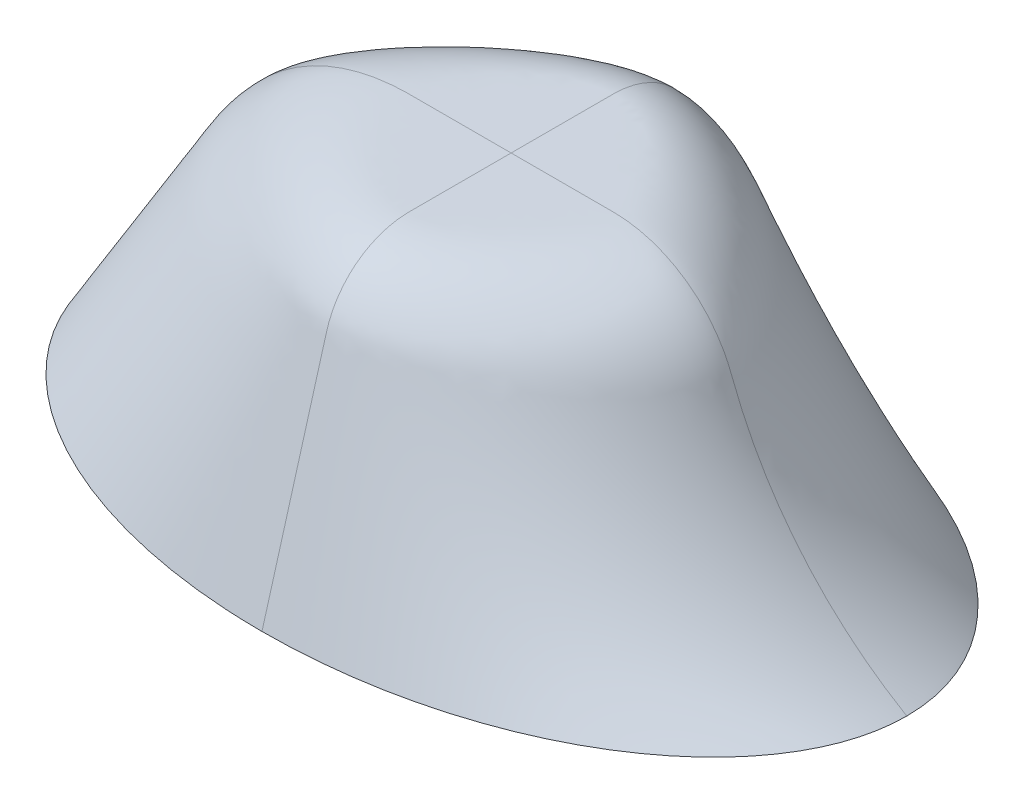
ISO-10303-21;
HEADER;
FILE_DESCRIPTION(('STEP AP214'),'2;1');
FILE_NAME('part.step','',(''),(''),'','','');
FILE_SCHEMA(('AUTOMOTIVE_DESIGN { 1 0 10303 214 1 1 1 1 }'));
ENDSEC;
DATA;
#1=APPLICATION_CONTEXT('core data for automotive mechanical design processes');
#2=APPLICATION_PROTOCOL_DEFINITION('international standard','automotive_design',2000,#1);
#3=PRODUCT_CONTEXT('',#1,'mechanical');
#4=PRODUCT('Part','Part','',(#3));
#5=PRODUCT_RELATED_PRODUCT_CATEGORY('part','',(#4));
#6=PRODUCT_DEFINITION_FORMATION('','',#4);
#7=PRODUCT_DEFINITION_CONTEXT('part definition',#1,'design');
#8=PRODUCT_DEFINITION('design','',#6,#7);
#9=PRODUCT_DEFINITION_SHAPE('','',#8);
#10=(LENGTH_UNIT() NAMED_UNIT(*) SI_UNIT(.MILLI.,.METRE.));
#11=(NAMED_UNIT(*) PLANE_ANGLE_UNIT() SI_UNIT($,.RADIAN.));
#12=(NAMED_UNIT(*) SI_UNIT($,.STERADIAN.) SOLID_ANGLE_UNIT());
#13=UNCERTAINTY_MEASURE_WITH_UNIT(LENGTH_MEASURE(1.E-05),#10,'distance_accuracy_value','');
#14=(GEOMETRIC_REPRESENTATION_CONTEXT(3) GLOBAL_UNCERTAINTY_ASSIGNED_CONTEXT((#13)) GLOBAL_UNIT_ASSIGNED_CONTEXT((#10,
#11,#12)) REPRESENTATION_CONTEXT('',''));
#15=CARTESIAN_POINT('',(0.,0.,0.));
#16=DIRECTION('',(0.,0.,1.));
#17=DIRECTION('',(1.,0.,0.));
#18=AXIS2_PLACEMENT_3D('',#15,#16,#17);
#19=CARTESIAN_POINT('',(0.,0.,0.));
#20=DIRECTION('',(0.,1.,0.));
#21=DIRECTION('',(0.,0.,1.));
#22=AXIS2_PLACEMENT_3D('',#19,#20,#21);
#23=PLANE('',#22);
#24=CARTESIAN_POINT('',(-190.,0.,0.));
#25=CARTESIAN_POINT('',(-190.000043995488,0.,1.08214177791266));
#26=CARTESIAN_POINT('',(-189.976856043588,0.,2.16427562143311));
#27=CARTESIAN_POINT('',(-189.884320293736,0.,4.32596131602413));
#28=CARTESIAN_POINT('',(-189.814998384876,0.,5.40551427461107));
#29=CARTESIAN_POINT('',(-189.630526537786,0.,7.56035874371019));
#30=CARTESIAN_POINT('',(-189.515390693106,0.,8.63565146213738));
#31=CARTESIAN_POINT('',(-189.239879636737,0.,10.7803212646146));
#32=CARTESIAN_POINT('',(-189.07950850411,0.,11.8496988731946));
#33=CARTESIAN_POINT('',(-188.715563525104,0.,13.97344287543));
#34=CARTESIAN_POINT('',(-188.51229664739,0.,15.0278619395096));
#35=CARTESIAN_POINT('',(-188.062844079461,0.,17.1276020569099));
#36=CARTESIAN_POINT('',(-187.816654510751,0.,18.1729222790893));
#37=CARTESIAN_POINT('',(-187.282463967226,0.,20.2529078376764));
#38=CARTESIAN_POINT('',(-186.994459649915,0.,21.2875723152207));
#39=CARTESIAN_POINT('',(-186.377928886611,0.,23.3447037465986));
#40=CARTESIAN_POINT('',(-186.04940314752,0.,24.3671709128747));
#41=CARTESIAN_POINT('',(-185.228298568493,0.,26.7630576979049));
#42=CARTESIAN_POINT('',(-184.719140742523,0.,28.1308242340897));
#43=CARTESIAN_POINT('',(-183.632211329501,0.,30.8387064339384));
#44=CARTESIAN_POINT('',(-183.054440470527,0.,32.178822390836));
#45=CARTESIAN_POINT('',(-181.834148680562,0.,34.8291296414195));
#46=CARTESIAN_POINT('',(-181.191630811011,0.,36.1393223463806));
#47=CARTESIAN_POINT('',(-179.844530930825,0.,38.730360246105));
#48=CARTESIAN_POINT('',(-179.139838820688,0.,40.0111481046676));
#49=CARTESIAN_POINT('',(-177.673293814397,0.,42.539559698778));
#50=CARTESIAN_POINT('',(-176.911439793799,0.,43.7871827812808));
#51=CARTESIAN_POINT('',(-175.334327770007,0.,46.2483807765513));
#52=CARTESIAN_POINT('',(-174.519062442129,0.,47.4619509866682));
#53=CARTESIAN_POINT('',(-172.686600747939,0.,50.0710735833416));
#54=CARTESIAN_POINT('',(-171.659588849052,0.,51.4597377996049));
#55=CARTESIAN_POINT('',(-169.541993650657,0.,54.1879515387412));
#56=CARTESIAN_POINT('',(-168.451400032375,0.,55.5274930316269));
#57=CARTESIAN_POINT('',(-166.211771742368,0.,58.1575955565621));
#58=CARTESIAN_POINT('',(-165.062716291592,0.,59.4481388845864));
#59=CARTESIAN_POINT('',(-162.711712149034,0.,61.9797719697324));
#60=CARTESIAN_POINT('',(-161.509765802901,0.,63.2208639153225));
#61=CARTESIAN_POINT('',(-157.827196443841,0.,66.8749874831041));
#62=CARTESIAN_POINT('',(-155.273235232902,0.,69.214918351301));
#63=CARTESIAN_POINT('',(-151.322156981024,0.,72.58141665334));
#64=CARTESIAN_POINT('',(-149.985005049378,0.,73.6797588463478));
#65=CARTESIAN_POINT('',(-147.273755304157,0.,75.8299241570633));
#66=CARTESIAN_POINT('',(-145.899658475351,0.,76.8817485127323));
#67=CARTESIAN_POINT('',(-142.399019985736,0.,79.4715780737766));
#68=CARTESIAN_POINT('',(-140.250536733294,0.,80.979985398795));
#69=CARTESIAN_POINT('',(-135.885507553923,0.,83.8960020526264));
#70=CARTESIAN_POINT('',(-133.668940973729,0.,85.303580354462));
#71=CARTESIAN_POINT('',(-129.176097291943,0.,88.0214778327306));
#72=CARTESIAN_POINT('',(-126.899801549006,0.,89.3317661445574));
#73=CARTESIAN_POINT('',(-122.295554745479,0.,91.8578696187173));
#74=CARTESIAN_POINT('',(-119.967604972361,0.,93.0736871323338));
#75=CARTESIAN_POINT('',(-115.257489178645,0.,95.4185560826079));
#76=CARTESIAN_POINT('',(-112.875151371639,0.,96.5472618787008));
#77=CARTESIAN_POINT('',(-108.071055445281,0.,98.7155914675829));
#78=CARTESIAN_POINT('',(-105.649307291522,0.,99.7552373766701));
#79=CARTESIAN_POINT('',(-100.770807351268,0.,101.748591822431));
#80=CARTESIAN_POINT('',(-98.3140562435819,0.,102.702302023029));
#81=CARTESIAN_POINT('',(-93.3697661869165,0.,104.52644846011));
#82=CARTESIAN_POINT('',(-90.8822260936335,0.,105.396881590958));
#83=CARTESIAN_POINT('',(-85.9967773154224,0.,107.018138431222));
#84=CARTESIAN_POINT('',(-83.6000880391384,0.,107.772644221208));
#85=CARTESIAN_POINT('',(-78.7850580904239,0.,109.20996586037));
#86=CARTESIAN_POINT('',(-76.3667151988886,0.,109.892774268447));
#87=CARTESIAN_POINT('',(-71.5108060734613,0.,111.188384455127));
#88=CARTESIAN_POINT('',(-69.073235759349,0.,111.801170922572));
#89=CARTESIAN_POINT('',(-64.1812294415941,0.,112.958156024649));
#90=CARTESIAN_POINT('',(-61.7267892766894,0.,113.502337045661));
#91=CARTESIAN_POINT('',(-56.8033513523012,0.,114.523306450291));
#92=CARTESIAN_POINT('',(-54.3343503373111,0.,115.000079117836));
#93=CARTESIAN_POINT('',(-49.384053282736,0.,115.887239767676));
#94=CARTESIAN_POINT('',(-46.9027553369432,0.,116.297617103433));
#95=CARTESIAN_POINT('',(-41.965474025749,0.,117.047462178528));
#96=CARTESIAN_POINT('',(-39.5096306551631,0.,117.387852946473));
#97=CARTESIAN_POINT('',(-34.5902661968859,0.,118.005634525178));
#98=CARTESIAN_POINT('',(-32.1267458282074,0.,118.283031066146));
#99=CARTESIAN_POINT('',(-27.1941869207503,0.,118.775392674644));
#100=CARTESIAN_POINT('',(-24.7251501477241,0.,118.990375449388));
#101=CARTESIAN_POINT('',(-19.7837105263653,0.,119.358389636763));
#102=CARTESIAN_POINT('',(-17.3113099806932,0.,119.511451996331));
#103=CARTESIAN_POINT('',(-12.3652922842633,0.,119.756041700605));
#104=CARTESIAN_POINT('',(-9.89167736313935,0.,119.847614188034));
#105=CARTESIAN_POINT('',(-4.94537192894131,0.,119.969553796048));
#106=CARTESIAN_POINT('',(-2.47268289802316,0.,119.999981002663));
#107=CARTESIAN_POINT('',(0.,0.,120.));
#108=B_SPLINE_CURVE_WITH_KNOTS('',3,(#24,#25,#26,#27,#28,#29,#30,#31,#32,#33,#34,#35,#36,#37,
#38,#39,#40,#41,#42,#43,#44,#45,#46,#47,#48,#49,#50,#51,#52,#53,#54,#55,#56,#57,#58,#59,#60,#61,
#62,#63,#64,#65,#66,#67,#68,#69,#70,#71,#72,#73,#74,#75,#76,#77,#78,#79,#80,#81,#82,#83,#84,#85,
#86,#87,#88,#89,#90,#91,#92,#93,#94,#95,#96,#97,#98,#99,#100,#101,#102,#103,#104,#105,#106,
#107),.UNSPECIFIED.,.F.,.F.,(4,2,2,2,2,2,2,2,2,2,2,2,2,2,2,2,2,2,2,2,2,2,2,2,2,2,2,2,2,2,2,2,2,
2,2,2,2,2,2,2,2,4),(0.,3.24616403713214,6.49050795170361,9.73385459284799,12.9769088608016,
16.1974978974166,19.4183780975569,22.6395159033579,25.8605975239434,30.2369403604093,
34.613236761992,38.9893263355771,43.3733269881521,47.7574139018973,52.1421033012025,
57.3215985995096,62.501936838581,67.6841293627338,72.8660922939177,83.2455899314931,
88.436104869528,93.6264815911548,101.498662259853,109.373255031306,117.250335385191,
125.127219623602,133.033902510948,140.938616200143,148.84317680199,156.748032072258,
164.284833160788,171.822415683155,179.361643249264,186.902802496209,194.445717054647,
201.989839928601,209.426981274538,216.86344583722,224.297798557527,231.728431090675,
239.153602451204,246.571473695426),.UNSPECIFIED.);
#109=CARTESIAN_POINT('',(-190.,0.,0.));
#110=VERTEX_POINT('',#109);
#111=CARTESIAN_POINT('',(0.,0.,120.));
#112=VERTEX_POINT('',#111);
#113=EDGE_CURVE('E280',#110,#112,#108,.T.);
#114=ORIENTED_EDGE('',*,*,#113,.T.);
#115=CARTESIAN_POINT('',(0.,0.,120.));
#116=CARTESIAN_POINT('',(2.64001647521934,0.,119.99997521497));
#117=CARTESIAN_POINT('',(5.28004129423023,0.,119.965293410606));
#118=CARTESIAN_POINT('',(10.5599116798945,0.,119.826306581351));
#119=CARTESIAN_POINT('',(13.1997560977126,0.,119.721957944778));
#120=CARTESIAN_POINT('',(18.4768812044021,0.,119.443268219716));
#121=CARTESIAN_POINT('',(21.1141603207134,0.,119.268897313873));
#122=CARTESIAN_POINT('',(26.3837571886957,0.,118.849659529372));
#123=CARTESIAN_POINT('',(29.0160735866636,0.,118.60477561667));
#124=CARTESIAN_POINT('',(34.2733397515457,0.,118.043903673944));
#125=CARTESIAN_POINT('',(36.8982889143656,0.,117.727909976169));
#126=CARTESIAN_POINT('',(42.1722205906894,0.,117.019530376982));
#127=CARTESIAN_POINT('',(44.8210784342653,0.,116.626214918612));
#128=CARTESIAN_POINT('',(50.1063241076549,0.,115.764910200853));
#129=CARTESIAN_POINT('',(52.7427133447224,0.,115.296929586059));
#130=CARTESIAN_POINT('',(58.0004961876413,0.,114.28514005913));
#131=CARTESIAN_POINT('',(60.62189204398,0.,113.741342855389));
#132=CARTESIAN_POINT('',(65.8471147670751,0.,112.576528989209));
#133=CARTESIAN_POINT('',(68.4509440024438,0.,111.955522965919));
#134=CARTESIAN_POINT('',(73.6383956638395,0.,110.634621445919));
#135=CARTESIAN_POINT('',(76.2220191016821,0.,109.934729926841));
#136=CARTESIAN_POINT('',(81.4850068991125,0.,108.419901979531));
#137=CARTESIAN_POINT('',(84.1632731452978,0.,107.601141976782));
#138=CARTESIAN_POINT('',(89.490345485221,0.,105.872715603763));
#139=CARTESIAN_POINT('',(92.1391516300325,0.,104.963049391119));
#140=CARTESIAN_POINT('',(97.4029014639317,0.,103.049985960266));
#141=CARTESIAN_POINT('',(100.017843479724,0.,102.046584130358));
#142=CARTESIAN_POINT('',(105.209274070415,0.,99.9427097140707));
#143=CARTESIAN_POINT('',(107.785752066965,0.,98.8422109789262));
#144=CARTESIAN_POINT('',(112.88279915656,0.,96.5458440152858));
#145=CARTESIAN_POINT('',(115.403558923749,0.,95.3503997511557));
#146=CARTESIAN_POINT('',(120.393697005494,0.,92.8564546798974));
#147=CARTESIAN_POINT('',(122.863075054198,0.,91.557953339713));
#148=CARTESIAN_POINT('',(127.741806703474,0.,88.8544984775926));
#149=CARTESIAN_POINT('',(130.15118145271,0.,87.4495831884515));
#150=CARTESIAN_POINT('',(134.901109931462,0.,84.5293925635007));
#151=CARTESIAN_POINT('',(137.241688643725,0.,83.0141580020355));
#152=CARTESIAN_POINT('',(141.374169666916,0.,80.1899057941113));
#153=CARTESIAN_POINT('',(143.180499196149,0.,78.9019764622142));
#154=CARTESIAN_POINT('',(146.737107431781,0.,76.2511701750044));
#155=CARTESIAN_POINT('',(148.487392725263,0.,74.8883020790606));
#156=CARTESIAN_POINT('',(151.925318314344,0.,72.0853298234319));
#157=CARTESIAN_POINT('',(153.612953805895,0.,70.6452197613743));
#158=CARTESIAN_POINT('',(156.917213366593,0.,67.6863656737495));
#159=CARTESIAN_POINT('',(158.533855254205,0.,66.167641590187));
#160=CARTESIAN_POINT('',(161.687716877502,0.,63.0497939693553));
#161=CARTESIAN_POINT('',(163.224938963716,0.,61.4506728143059));
#162=CARTESIAN_POINT('',(166.209928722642,0.,58.1712680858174));
#163=CARTESIAN_POINT('',(167.657712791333,0.,56.4909994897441));
#164=CARTESIAN_POINT('',(170.164325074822,0.,53.4045438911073));
#165=CARTESIAN_POINT('',(171.241729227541,0.,52.0134228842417));
#166=CARTESIAN_POINT('',(173.327456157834,0.,49.1803573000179));
#167=CARTESIAN_POINT('',(174.335784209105,0.,47.7384166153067));
#168=CARTESIAN_POINT('',(176.277122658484,0.,44.8045343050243));
#169=CARTESIAN_POINT('',(177.210130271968,0.,43.3125908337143));
#170=CARTESIAN_POINT('',(178.991532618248,0.,40.2847913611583));
#171=CARTESIAN_POINT('',(179.840167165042,0.,38.749076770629));
#172=CARTESIAN_POINT('',(181.449126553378,0.,35.6319797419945));
#173=CARTESIAN_POINT('',(182.209450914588,0.,34.0505970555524));
#174=CARTESIAN_POINT('',(183.634941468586,0.,30.8454870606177));
#175=CARTESIAN_POINT('',(184.300116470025,0.,29.221763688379));
#176=CARTESIAN_POINT('',(185.323944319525,0.,26.4839400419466));
#177=CARTESIAN_POINT('',(185.710872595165,0.,25.3803384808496));
#178=CARTESIAN_POINT('',(186.437690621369,0.,23.1577251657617));
#179=CARTESIAN_POINT('',(186.777581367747,0.,22.0387137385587));
#180=CARTESIAN_POINT('',(187.408555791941,0.,19.7871753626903));
#181=CARTESIAN_POINT('',(187.699646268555,0.,18.6546503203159));
#182=CARTESIAN_POINT('',(188.231506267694,0.,16.3779974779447));
#183=CARTESIAN_POINT('',(188.472282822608,0.,15.2338713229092));
#184=CARTESIAN_POINT('',(188.904260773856,0.,12.9251571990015));
#185=CARTESIAN_POINT('',(189.09497536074,0.,11.7604779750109));
#186=CARTESIAN_POINT('',(189.42276074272,0.,9.42343469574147));
#187=CARTESIAN_POINT('',(189.559824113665,0.,8.2510695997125));
#188=CARTESIAN_POINT('',(189.779520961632,0.,5.90066044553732));
#189=CARTESIAN_POINT('',(189.862129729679,0.,4.72261405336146));
#190=CARTESIAN_POINT('',(189.94481680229,0.,2.95322358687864));
#191=CARTESIAN_POINT('',(189.965508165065,0.,2.36277768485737));
#192=CARTESIAN_POINT('',(189.993100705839,0.,1.18156185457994));
#193=CARTESIAN_POINT('',(190.000001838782,0.,0.590791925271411));
#194=CARTESIAN_POINT('',(190.,0.,0.));
#195=B_SPLINE_CURVE_WITH_KNOTS('',3,(#115,#116,#117,#118,#119,#120,#121,#122,#123,#124,#125,
#126,#127,#128,#129,#130,#131,#132,#133,#134,#135,#136,#137,#138,#139,#140,#141,#142,#143,#144,
#145,#146,#147,#148,#149,#150,#151,#152,#153,#154,#155,#156,#157,#158,#159,#160,#161,#162,#163,
#164,#165,#166,#167,#168,#169,#170,#171,#172,#173,#174,#175,#176,#177,#178,#179,#180,#181,#182,
#183,#184,#185,#186,#187,#188,#189,#190,#191,#192,#193,#194),.UNSPECIFIED.,.F.,.F.,(4,2,2,2,2,2,
2,2,2,2,2,2,2,2,2,2,2,2,2,2,2,2,2,2,2,2,2,2,2,2,2,2,2,2,2,2,2,2,2,4),(0.,7.91983488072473,
15.8446322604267,23.7728078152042,31.702900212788,39.6336248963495,47.6662704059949,
55.6979865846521,63.7284637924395,71.7578356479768,79.7868028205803,88.1870872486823,
96.5873571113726,104.988040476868,113.390993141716,121.758332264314,130.125714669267,
138.490104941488,146.8514192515,153.505026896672,160.157849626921,166.811181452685,
173.462833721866,180.114289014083,186.764521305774,192.041268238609,197.317611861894,
202.594150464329,207.855234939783,213.116348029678,218.376973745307,221.88443073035,
225.39181344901,228.898707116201,232.405110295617,235.944443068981,239.484265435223,
243.025692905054,244.797978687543,246.570270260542),.UNSPECIFIED.);
#196=CARTESIAN_POINT('',(190.,0.,0.));
#197=VERTEX_POINT('',#196);
#198=EDGE_CURVE('E297',#112,#197,#195,.T.);
#199=ORIENTED_EDGE('',*,*,#198,.T.);
#200=CARTESIAN_POINT('',(190.,0.,0.));
#201=CARTESIAN_POINT('',(190.000043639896,0.,-1.07993198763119));
#202=CARTESIAN_POINT('',(189.976950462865,0.,-2.15985612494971));
#203=CARTESIAN_POINT('',(189.884791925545,0.,-4.31713941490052));
#204=CARTESIAN_POINT('',(189.815752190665,0.,-5.39449966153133));
#205=CARTESIAN_POINT('',(189.632029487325,0.,-7.54498515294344));
#206=CARTESIAN_POINT('',(189.517360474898,0.,-8.61811159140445));
#207=CARTESIAN_POINT('',(189.242963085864,0.,-10.7584844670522));
#208=CARTESIAN_POINT('',(189.083238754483,0.,-11.825731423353));
#209=CARTESIAN_POINT('',(188.720749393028,0.,-13.9453135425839));
#210=CARTESIAN_POINT('',(188.51828850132,0.,-14.997700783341));
#211=CARTESIAN_POINT('',(188.070608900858,0.,-17.093429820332));
#212=CARTESIAN_POINT('',(187.825386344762,0.,-18.136770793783));
#213=CARTESIAN_POINT('',(187.293282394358,0.,-20.2128587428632));
#214=CARTESIAN_POINT('',(187.006397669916,0.,-21.2456048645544));
#215=CARTESIAN_POINT('',(186.392249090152,0.,-23.2989683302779));
#216=CARTESIAN_POINT('',(186.06498589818,0.,-24.3195858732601));
#217=CARTESIAN_POINT('',(185.246126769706,0.,-26.7137984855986));
#218=CARTESIAN_POINT('',(184.737872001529,0.,-28.0817250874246));
#219=CARTESIAN_POINT('',(183.652717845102,0.,-30.7899659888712));
#220=CARTESIAN_POINT('',(183.075819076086,0.,-32.1302805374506));
#221=CARTESIAN_POINT('',(181.857238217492,0.,-34.7810170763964));
#222=CARTESIAN_POINT('',(181.215559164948,0.,-36.0914404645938));
#223=CARTESIAN_POINT('',(179.870105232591,0.,-38.6829640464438));
#224=CARTESIAN_POINT('',(179.166220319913,0.,-39.9640070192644));
#225=CARTESIAN_POINT('',(177.701254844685,0.,-42.4929507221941));
#226=CARTESIAN_POINT('',(176.940173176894,0.,-43.7408508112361));
#227=CARTESIAN_POINT('',(175.364571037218,0.,-46.2026209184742));
#228=CARTESIAN_POINT('',(174.550043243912,0.,-47.4164862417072));
#229=CARTESIAN_POINT('',(172.719650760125,0.,-50.0255588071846));
#230=CARTESIAN_POINT('',(171.69399856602,0.,-51.4139051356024));
#231=CARTESIAN_POINT('',(169.579137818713,0.,-54.1415478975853));
#232=CARTESIAN_POINT('',(168.489918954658,0.,-55.4808363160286));
#233=CARTESIAN_POINT('',(166.253050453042,0.,-58.1104927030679));
#234=CARTESIAN_POINT('',(165.105380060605,0.,-59.4008430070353));
#235=CARTESIAN_POINT('',(162.757150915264,0.,-61.9321465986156));
#236=CARTESIAN_POINT('',(161.556594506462,0.,-63.1731020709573));
#237=CARTESIAN_POINT('',(157.878207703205,0.,-66.826888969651));
#238=CARTESIAN_POINT('',(155.327042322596,0.,-69.1666992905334));
#239=CARTESIAN_POINT('',(151.380147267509,0.,-72.5331551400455));
#240=CARTESIAN_POINT('',(150.044387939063,0.,-73.6315063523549));
#241=CARTESIAN_POINT('',(147.335918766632,0.,-75.781732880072));
#242=CARTESIAN_POINT('',(145.963209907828,0.,-76.8336094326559));
#243=CARTESIAN_POINT('',(142.466249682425,0.,-79.4234788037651));
#244=CARTESIAN_POINT('',(140.320059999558,0.,-80.931909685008));
#245=CARTESIAN_POINT('',(135.959612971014,0.,-83.8480761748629));
#246=CARTESIAN_POINT('',(133.745334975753,0.,-85.2557807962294));
#247=CARTESIAN_POINT('',(129.257061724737,0.,-87.9740302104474));
#248=CARTESIAN_POINT('',(126.983047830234,0.,-89.2845441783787));
#249=CARTESIAN_POINT('',(122.383353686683,0.,-91.8111918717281));
#250=CARTESIAN_POINT('',(120.057674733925,0.,-93.0273279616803));
#251=CARTESIAN_POINT('',(115.352075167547,0.,-95.3729338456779));
#252=CARTESIAN_POINT('',(112.971982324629,0.,-96.5020575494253));
#253=CARTESIAN_POINT('',(108.17235920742,0.,-98.671306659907));
#254=CARTESIAN_POINT('',(105.752838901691,0.,-99.7114541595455));
#255=CARTESIAN_POINT('',(100.878776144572,0.,-101.705893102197));
#256=CARTESIAN_POINT('',(98.4242343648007,0.,-102.660186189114));
#257=CARTESIAN_POINT('',(93.4843433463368,0.,-104.485577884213));
#258=CARTESIAN_POINT('',(90.9989929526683,0.,-105.356673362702));
#259=CARTESIAN_POINT('',(86.11276568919,0.,-106.980974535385));
#260=CARTESIAN_POINT('',(83.7130575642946,0.,-107.737703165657));
#261=CARTESIAN_POINT('',(78.8918832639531,0.,-109.179242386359));
#262=CARTESIAN_POINT('',(76.470414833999,0.,-109.864045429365));
#263=CARTESIAN_POINT('',(71.6081610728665,0.,-111.163426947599));
#264=CARTESIAN_POINT('',(69.167371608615,0.,-111.777989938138));
#265=CARTESIAN_POINT('',(64.2688462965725,0.,-112.938318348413));
#266=CARTESIAN_POINT('',(61.8111062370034,0.,-113.484065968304));
#267=CARTESIAN_POINT('',(56.8810001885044,0.,-114.507965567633));
#268=CARTESIAN_POINT('',(54.4086309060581,0.,-114.986101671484));
#269=CARTESIAN_POINT('',(49.4515410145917,0.,-115.875791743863));
#270=CARTESIAN_POINT('',(46.9668184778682,0.,-116.28733496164));
#271=CARTESIAN_POINT('',(42.0227843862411,0.,-117.03928977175));
#272=CARTESIAN_POINT('',(39.563613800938,0.,-117.380629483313));
#273=CARTESIAN_POINT('',(34.6375632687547,0.,-118.000129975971));
#274=CARTESIAN_POINT('',(32.1706840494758,0.,-118.278296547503));
#275=CARTESIAN_POINT('',(27.2313870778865,0.,-118.77202228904));
#276=CARTESIAN_POINT('',(24.7589711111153,0.,-118.987599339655));
#277=CARTESIAN_POINT('',(19.810763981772,0.,-119.356628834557));
#278=CARTESIAN_POINT('',(17.3349751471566,0.,-119.510112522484));
#279=CARTESIAN_POINT('',(12.3821829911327,0.,-119.755374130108));
#280=CARTESIAN_POINT('',(9.90518192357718,0.,-119.847197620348));
#281=CARTESIAN_POINT('',(4.95211751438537,0.,-119.969470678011));
#282=CARTESIAN_POINT('',(2.47605567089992,0.,-119.999980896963));
#283=CARTESIAN_POINT('',(0.,0.,-120.));
#284=B_SPLINE_CURVE_WITH_KNOTS('',3,(#200,#201,#202,#203,#204,#205,#206,#207,#208,#209,#210,
#211,#212,#213,#214,#215,#216,#217,#218,#219,#220,#221,#222,#223,#224,#225,#226,#227,#228,#229,
#230,#231,#232,#233,#234,#235,#236,#237,#238,#239,#240,#241,#242,#243,#244,#245,#246,#247,#248,
#249,#250,#251,#252,#253,#254,#255,#256,#257,#258,#259,#260,#261,#262,#263,#264,#265,#266,#267,
#268,#269,#270,#271,#272,#273,#274,#275,#276,#277,#278,#279,#280,#281,#282,#283),.UNSPECIFIED.,
.F.,.F.,(4,2,2,2,2,2,2,2,2,2,2,2,2,2,2,2,2,2,2,2,2,2,2,2,2,2,2,2,2,2,2,2,2,2,2,2,2,2,2,2,2,4),
(0.,3.23953632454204,6.47726740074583,9.71400895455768,12.9504599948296,16.1646114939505,
19.3790523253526,22.5937502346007,25.8083953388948,30.1842424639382,34.560050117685,
38.9356527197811,43.3191562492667,47.7027445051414,52.0869345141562,57.2632398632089,
62.4403871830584,67.6193857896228,72.7981550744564,83.1712311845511,88.3585359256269,
93.5457024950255,101.412295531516,109.28129831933,117.152786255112,125.024076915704,
132.925212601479,140.824380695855,148.723397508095,156.622711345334,164.170147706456,
171.718375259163,179.268263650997,186.820100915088,194.373708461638,201.928534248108,
209.375950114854,216.822683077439,224.267286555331,231.708139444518,239.143487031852,
246.571475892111),.UNSPECIFIED.);
#285=CARTESIAN_POINT('',(0.,0.,-120.));
#286=VERTEX_POINT('',#285);
#287=EDGE_CURVE('E289',#197,#286,#284,.T.);
#288=ORIENTED_EDGE('',*,*,#287,.T.);
#289=CARTESIAN_POINT('',(0.,0.,-120.));
#290=CARTESIAN_POINT('',(-2.67379526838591,0.,-119.999973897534));
#291=CARTESIAN_POINT('',(-5.34759939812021,0.,-119.964399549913));
#292=CARTESIAN_POINT('',(-10.6950965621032,0.,-119.821828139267));
#293=CARTESIAN_POINT('',(-13.3687883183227,0.,-119.714783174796));
#294=CARTESIAN_POINT('',(-18.7135601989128,0.,-119.428878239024));
#295=CARTESIAN_POINT('',(-21.38463857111,0.,-119.249985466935));
#296=CARTESIAN_POINT('',(-26.7216692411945,0.,-118.81985319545));
#297=CARTESIAN_POINT('',(-29.3876200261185,0.,-118.568594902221));
#298=CARTESIAN_POINT('',(-34.7118730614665,0.,-117.993091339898));
#299=CARTESIAN_POINT('',(-37.3701746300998,0.,-117.668839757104));
#300=CARTESIAN_POINT('',(-42.710729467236,0.,-116.941919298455));
#301=CARTESIAN_POINT('',(-45.3928534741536,0.,-116.538299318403));
#302=CARTESIAN_POINT('',(-50.7441056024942,0.,-115.654371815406));
#303=CARTESIAN_POINT('',(-53.4132353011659,0.,-115.174073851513));
#304=CARTESIAN_POINT('',(-58.7358507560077,0.,-114.135576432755));
#305=CARTESIAN_POINT('',(-61.3893390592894,0.,-113.577390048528));
#306=CARTESIAN_POINT('',(-66.6779712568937,0.,-112.381651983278));
#307=CARTESIAN_POINT('',(-69.3131178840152,0.,-111.744112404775));
#308=CARTESIAN_POINT('',(-74.5623018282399,0.,-110.387907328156));
#309=CARTESIAN_POINT('',(-77.1763404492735,0.,-109.669246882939));
#310=CARTESIAN_POINT('',(-82.4341672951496,0.,-108.132993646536));
#311=CARTESIAN_POINT('',(-85.0774469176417,0.,-107.313657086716));
#312=CARTESIAN_POINT('',(-90.334764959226,0.,-105.585944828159));
#313=CARTESIAN_POINT('',(-92.9488036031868,0.,-104.677569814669));
#314=CARTESIAN_POINT('',(-98.1433357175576,0.,-102.769024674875));
#315=CARTESIAN_POINT('',(-100.723827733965,0.,-101.768850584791));
#316=CARTESIAN_POINT('',(-105.846782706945,0.,-99.6734541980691));
#317=CARTESIAN_POINT('',(-108.389235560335,0.,-98.5782071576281));
#318=CARTESIAN_POINT('',(-113.419193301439,0.,-96.2943306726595));
#319=CARTESIAN_POINT('',(-115.906882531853,0.,-95.106107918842));
#320=CARTESIAN_POINT('',(-120.831647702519,0.,-92.6287895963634));
#321=CARTESIAN_POINT('',(-123.268723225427,0.,-91.3396931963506));
#322=CARTESIAN_POINT('',(-128.083865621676,0.,-88.6573381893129));
#323=CARTESIAN_POINT('',(-130.461952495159,0.,-87.2641155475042));
#324=CARTESIAN_POINT('',(-135.150569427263,0.,-84.3697280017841));
#325=CARTESIAN_POINT('',(-137.461122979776,0.,-82.8686012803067));
#326=CARTESIAN_POINT('',(-141.566803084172,0.,-80.054348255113));
#327=CARTESIAN_POINT('',(-143.375374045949,0.,-78.7608192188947));
#328=CARTESIAN_POINT('',(-146.935971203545,0.,-76.0983890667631));
#329=CARTESIAN_POINT('',(-148.688003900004,0.,-74.7294966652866));
#330=CARTESIAN_POINT('',(-152.12885256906,0.,-71.9140388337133));
#331=CARTESIAN_POINT('',(-153.817663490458,0.,-70.4674672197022));
#332=CARTESIAN_POINT('',(-157.123546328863,0.,-67.495309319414));
#333=CARTESIAN_POINT('',(-158.740638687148,0.,-65.9697458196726));
#334=CARTESIAN_POINT('',(-161.89462734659,0.,-62.8378054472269));
#335=CARTESIAN_POINT('',(-163.431526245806,0.,-61.2314311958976));
#336=CARTESIAN_POINT('',(-166.414975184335,0.,-57.9371365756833));
#337=CARTESIAN_POINT('',(-167.861542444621,0.,-56.2492318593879));
#338=CARTESIAN_POINT('',(-170.35907428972,0.,-53.1561901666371));
#339=CARTESIAN_POINT('',(-171.429146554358,0.,-51.7664601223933));
#340=CARTESIAN_POINT('',(-173.50029293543,0.,-48.9365389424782));
#341=CARTESIAN_POINT('',(-174.501372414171,0.,-47.4963517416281));
#342=CARTESIAN_POINT('',(-176.428337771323,0.,-44.5663627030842));
#343=CARTESIAN_POINT('',(-177.354220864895,0.,-43.0765590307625));
#344=CARTESIAN_POINT('',(-179.121590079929,0.,-40.0534051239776));
#345=CARTESIAN_POINT('',(-179.963313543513,0.,-38.520193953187));
#346=CARTESIAN_POINT('',(-181.558677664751,0.,-35.4085288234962));
#347=CARTESIAN_POINT('',(-182.31231789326,0.,-33.8300746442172));
#348=CARTESIAN_POINT('',(-183.724732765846,0.,-30.6312659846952));
#349=CARTESIAN_POINT('',(-184.383516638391,0.,-29.0109155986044));
#350=CARTESIAN_POINT('',(-185.395136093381,0.,-26.2841163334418));
#351=CARTESIAN_POINT('',(-185.776350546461,0.,-25.1881196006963));
#352=CARTESIAN_POINT('',(-186.492369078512,0.,-22.9810455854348));
#353=CARTESIAN_POINT('',(-186.827174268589,0.,-21.8699686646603));
#354=CARTESIAN_POINT('',(-187.448655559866,0.,-19.6345932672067));
#355=CARTESIAN_POINT('',(-187.735338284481,0.,-18.5102966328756));
#356=CARTESIAN_POINT('',(-188.259104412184,0.,-16.2503567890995));
#357=CARTESIAN_POINT('',(-188.496194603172,0.,-15.1147151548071));
#358=CARTESIAN_POINT('',(-188.921488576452,0.,-12.8234784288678));
#359=CARTESIAN_POINT('',(-189.109222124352,0.,-11.6677958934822));
#360=CARTESIAN_POINT('',(-189.431870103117,0.,-9.34892534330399));
#361=CARTESIAN_POINT('',(-189.566777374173,0.,-8.18573633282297));
#362=CARTESIAN_POINT('',(-189.783011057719,0.,-5.85381709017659));
#363=CARTESIAN_POINT('',(-189.86431373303,0.,-4.68508463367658));
#364=CARTESIAN_POINT('',(-189.945691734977,0.,-2.92972442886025));
#365=CARTESIAN_POINT('',(-189.966055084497,0.,-2.34397363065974));
#366=CARTESIAN_POINT('',(-189.993210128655,0.,-1.17215571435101));
#367=CARTESIAN_POINT('',(-190.000001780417,0.,-0.586088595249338));
#368=CARTESIAN_POINT('',(-190.,0.,0.));
#369=B_SPLINE_CURVE_WITH_KNOTS('',3,(#289,#290,#291,#292,#293,#294,#295,#296,#297,#298,#299,
#300,#301,#302,#303,#304,#305,#306,#307,#308,#309,#310,#311,#312,#313,#314,#315,#316,#317,#318,
#319,#320,#321,#322,#323,#324,#325,#326,#327,#328,#329,#330,#331,#332,#333,#334,#335,#336,#337,
#338,#339,#340,#341,#342,#343,#344,#345,#346,#347,#348,#349,#350,#351,#352,#353,#354,#355,#356,
#357,#358,#359,#360,#361,#362,#363,#364,#365,#366,#367,#368),.UNSPECIFIED.,.F.,.F.,(4,2,2,2,2,2,
2,2,2,2,2,2,2,2,2,2,2,2,2,2,2,2,2,2,2,2,2,2,2,2,2,2,2,2,2,2,2,2,2,4),(0.,8.02116324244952,
16.0477078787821,24.0779210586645,32.1102216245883,40.1432172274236,48.2790911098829,
56.4139515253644,64.5474484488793,72.6797064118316,80.8114581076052,89.1119849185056,
97.4124478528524,105.713269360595,114.016257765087,122.284765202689,130.553340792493,
138.81907349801,147.081895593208,153.750713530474,160.418761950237,167.087341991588,
173.754008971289,180.420459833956,187.085635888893,192.345644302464,197.605243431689,
202.865037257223,208.109552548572,213.354093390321,218.598123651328,222.07841048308,
225.558613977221,229.038338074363,232.517585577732,236.02886908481,239.540628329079,
243.053941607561,244.8121196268,246.570303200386),.UNSPECIFIED.);
#370=EDGE_CURVE('E305',#286,#110,#369,.T.);
#371=ORIENTED_EDGE('',*,*,#370,.T.);
#372=EDGE_LOOP('',(#114,#199,#288,#371));
#373=FACE_BOUND('',#372,.T.);
#374=CARTESIAN_POINT('',(0.,0.,122.07918157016));
#375=CARTESIAN_POINT('',(2.50077245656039,0.,122.079164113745));
#376=CARTESIAN_POINT('',(5.00155084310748,0.,122.048445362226));
#377=CARTESIAN_POINT('',(10.0025550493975,0.,121.925381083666));
#378=CARTESIAN_POINT('',(12.5027802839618,0.,121.83301179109));
#379=CARTESIAN_POINT('',(17.5008279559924,0.,121.586390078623));
#380=CARTESIAN_POINT('',(19.998649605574,0.,121.432121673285));
#381=CARTESIAN_POINT('',(24.9900306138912,0.,121.061343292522));
#382=CARTESIAN_POINT('',(27.4835893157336,0.,120.844824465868));
#383=CARTESIAN_POINT('',(32.464579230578,0.,120.349106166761));
#384=CARTESIAN_POINT('',(34.9520101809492,0.,120.069904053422));
#385=CARTESIAN_POINT('',(39.9547148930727,0.,119.443790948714));
#386=CARTESIAN_POINT('',(42.4698740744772,0.,119.095963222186));
#387=CARTESIAN_POINT('',(47.4900553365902,0.,118.334548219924));
#388=CARTESIAN_POINT('',(49.995078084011,0.,117.920965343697));
#389=CARTESIAN_POINT('',(54.9930200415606,0.,117.027198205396));
#390=CARTESIAN_POINT('',(57.4859401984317,0.,116.547019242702));
#391=CARTESIAN_POINT('',(62.4576772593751,0.,115.519050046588));
#392=CARTESIAN_POINT('',(64.9364949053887,0.,114.97126340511));
#393=CARTESIAN_POINT('',(69.8779902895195,0.,113.806872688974));
#394=CARTESIAN_POINT('',(72.3406676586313,0.,113.190267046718));
#395=CARTESIAN_POINT('',(77.2543187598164,0.,111.885070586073));
#396=CARTESIAN_POINT('',(79.7052400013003,0.,111.196281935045));
#397=CARTESIAN_POINT('',(84.5858117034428,0.,109.746591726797));
#398=CARTESIAN_POINT('',(87.0154611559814,0.,108.985686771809));
#399=CARTESIAN_POINT('',(91.8505562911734,0.,107.390028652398));
#400=CARTESIAN_POINT('',(94.256000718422,0.,106.555271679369));
#401=CARTESIAN_POINT('',(99.0396565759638,0.,104.809894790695));
#402=CARTESIAN_POINT('',(101.417863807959,0.,103.899263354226));
#403=CARTESIAN_POINT('',(106.143901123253,0.,101.99978006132));
#404=CARTESIAN_POINT('',(108.491719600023,0.,101.010899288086));
#405=CARTESIAN_POINT('',(113.139077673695,0.,98.95859306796));
#406=CARTESIAN_POINT('',(115.438812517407,0.,97.8956103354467));
#407=CARTESIAN_POINT('',(119.9989355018,0.,95.6877284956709));
#408=CARTESIAN_POINT('',(122.259320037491,0.,94.5428219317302));
#409=CARTESIAN_POINT('',(126.734668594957,0.,92.1689183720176));
#410=CARTESIAN_POINT('',(128.949646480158,0.,90.939947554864));
#411=CARTESIAN_POINT('',(133.327932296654,0.,88.3954564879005));
#412=CARTESIAN_POINT('',(135.49126517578,0.,87.0799792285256));
#413=CARTESIAN_POINT('',(139.759904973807,0.,84.3596932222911));
#414=CARTESIAN_POINT('',(141.865235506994,0.,82.9549216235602));
#415=CARTESIAN_POINT('',(145.711581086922,0.,80.2620906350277));
#416=CARTESIAN_POINT('',(147.461305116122,0.,78.9864684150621));
#417=CARTESIAN_POINT('',(150.907429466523,0.,76.3654811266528));
#418=CARTESIAN_POINT('',(152.603837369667,0.,75.0201260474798));
#419=CARTESIAN_POINT('',(155.937393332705,0.,72.2576122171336));
#420=CARTESIAN_POINT('',(157.574538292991,0.,70.8404497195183));
#421=CARTESIAN_POINT('',(160.782483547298,0.,67.9326356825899));
#422=CARTESIAN_POINT('',(162.353280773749,0.,66.4419807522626));
#423=CARTESIAN_POINT('',(165.420454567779,0.,63.3858686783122));
#424=CARTESIAN_POINT('',(166.916831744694,0.,61.8204121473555));
#425=CARTESIAN_POINT('',(169.826081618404,0.,58.6138739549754));
#426=CARTESIAN_POINT('',(171.238965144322,0.,56.9728021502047));
#427=CARTESIAN_POINT('',(173.73703242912,0.,53.9026383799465));
#428=CARTESIAN_POINT('',(174.836862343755,0.,52.48545561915));
#429=CARTESIAN_POINT('',(176.966204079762,0.,49.5992198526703));
#430=CARTESIAN_POINT('',(177.995720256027,0.,48.1301700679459));
#431=CARTESIAN_POINT('',(179.977879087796,0.,45.1408912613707));
#432=CARTESIAN_POINT('',(180.9305178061,0.,43.6206596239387));
#433=CARTESIAN_POINT('',(182.748986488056,0.,40.5354019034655));
#434=CARTESIAN_POINT('',(183.615077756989,0.,38.9705302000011));
#435=CARTESIAN_POINT('',(185.256559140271,0.,35.7938493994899));
#436=CARTESIAN_POINT('',(186.031949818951,0.,34.182040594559));
#437=CARTESIAN_POINT('',(187.484672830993,0.,30.9148285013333));
#438=CARTESIAN_POINT('',(188.16201648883,0.,29.2594302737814));
#439=CARTESIAN_POINT('',(189.195386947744,0.,26.4890169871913));
#440=CARTESIAN_POINT('',(189.581515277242,0.,25.3851463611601));
#441=CARTESIAN_POINT('',(190.306933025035,0.,23.1620984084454));
#442=CARTESIAN_POINT('',(190.646223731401,0.,22.0429215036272));
#443=CARTESIAN_POINT('',(191.276156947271,0.,19.7911311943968));
#444=CARTESIAN_POINT('',(191.566806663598,0.,18.6585198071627));
#445=CARTESIAN_POINT('',(192.097909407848,0.,16.3817483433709));
#446=CARTESIAN_POINT('',(192.338369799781,0.,15.237589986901));
#447=CARTESIAN_POINT('',(192.769864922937,0.,12.9285466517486));
#448=CARTESIAN_POINT('',(192.960400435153,0.,11.763568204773));
#449=CARTESIAN_POINT('',(193.287879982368,0.,9.42593434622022));
#450=CARTESIAN_POINT('',(193.424816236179,0.,8.2532778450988));
#451=CARTESIAN_POINT('',(193.644303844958,0.,5.90227366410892));
#452=CARTESIAN_POINT('',(193.726829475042,0.,4.72392355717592));
#453=CARTESIAN_POINT('',(193.80942941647,0.,2.95406301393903));
#454=CARTESIAN_POINT('',(193.830097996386,0.,2.36344867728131));
#455=CARTESIAN_POINT('',(193.857659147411,0.,1.18189685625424));
#456=CARTESIAN_POINT('',(193.864551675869,0.,0.590959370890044));
#457=CARTESIAN_POINT('',(193.864549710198,0.,0.));
#458=B_SPLINE_CURVE_WITH_KNOTS('',3,(#374,#375,#376,#377,#378,#379,#380,#381,#382,#383,#384,
#385,#386,#387,#388,#389,#390,#391,#392,#393,#394,#395,#396,#397,#398,#399,#400,#401,#402,#403,
#404,#405,#406,#407,#408,#409,#410,#411,#412,#413,#414,#415,#416,#417,#418,#419,#420,#421,#422,
#423,#424,#425,#426,#427,#428,#429,#430,#431,#432,#433,#434,#435,#436,#437,#438,#439,#440,#441,
#442,#443,#444,#445,#446,#447,#448,#449,#450,#451,#452,#453,#454,#455,#456,#457),.UNSPECIFIED.,
.F.,.F.,(4,2,2,2,2,2,2,2,2,2,2,2,2,2,2,2,2,2,2,2,2,2,2,2,2,2,2,2,2,2,2,2,2,2,2,2,2,2,2,2,2,4),
(0.,7.50213808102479,15.007169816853,22.5141409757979,30.022180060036,37.530535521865,
45.1469638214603,52.7628827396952,60.378195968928,67.9931047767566,75.6081870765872,
83.2447147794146,90.8816024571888,98.5188842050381,106.157327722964,113.798607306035,
121.397609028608,128.9973032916,136.594641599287,144.188232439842,151.778684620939,
158.273101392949,164.766590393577,171.2604185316,177.754546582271,184.248621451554,
190.74185218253,196.121565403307,201.500945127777,206.880600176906,212.243488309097,
217.606343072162,222.968577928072,226.476017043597,229.983359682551,233.490182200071,
236.996489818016,240.536624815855,244.077273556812,247.61959508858,249.392383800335,
251.16517800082),.UNSPECIFIED.);
#459=CARTESIAN_POINT('',(0.,0.,122.07918157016));
#460=VERTEX_POINT('',#459);
#461=CARTESIAN_POINT('',(193.864549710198,0.,0.));
#462=VERTEX_POINT('',#461);
#463=EDGE_CURVE('E309',#460,#462,#458,.T.);
#464=ORIENTED_EDGE('',*,*,#463,.F.);
#465=CARTESIAN_POINT('',(-192.325428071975,0.,0.));
#466=CARTESIAN_POINT('',(-192.325472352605,0.,1.11176727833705));
#467=CARTESIAN_POINT('',(-192.30173164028,0.,2.22352780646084));
#468=CARTESIAN_POINT('',(-192.206960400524,0.,4.444441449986));
#469=CARTESIAN_POINT('',(-192.135954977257,0.,5.55359563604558));
#470=CARTESIAN_POINT('',(-191.946961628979,0.,7.76756309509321));
#471=CARTESIAN_POINT('',(-191.828987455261,0.,8.8723775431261));
#472=CARTESIAN_POINT('',(-191.546625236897,0.,11.0759566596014));
#473=CARTESIAN_POINT('',(-191.382241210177,0.,12.1747218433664));
#474=CARTESIAN_POINT('',(-191.009085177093,0.,14.3570069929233));
#475=CARTESIAN_POINT('',(-190.800621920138,0.,15.440579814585));
#476=CARTESIAN_POINT('',(-190.339579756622,0.,17.5983845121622));
#477=CARTESIAN_POINT('',(-190.086997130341,0.,18.6726155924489));
#478=CARTESIAN_POINT('',(-189.538818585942,0.,20.8101274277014));
#479=CARTESIAN_POINT('',(-189.243219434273,0.,21.8734073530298));
#480=CARTESIAN_POINT('',(-188.610298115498,0.,23.9874219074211));
#481=CARTESIAN_POINT('',(-188.272976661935,0.,25.0381567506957));
#482=CARTESIAN_POINT('',(-187.429363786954,0.,27.5012786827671));
#483=CARTESIAN_POINT('',(-186.905933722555,0.,28.9078260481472));
#484=CARTESIAN_POINT('',(-185.788191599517,0.,31.6923620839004));
#485=CARTESIAN_POINT('',(-185.19388002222,0.,33.0703509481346));
#486=CARTESIAN_POINT('',(-183.938308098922,0.,35.7953683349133));
#487=CARTESIAN_POINT('',(-183.277050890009,0.,37.1423983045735));
#488=CARTESIAN_POINT('',(-181.890362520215,0.,39.8059583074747));
#489=CARTESIAN_POINT('',(-181.164820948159,0.,41.1224307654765));
#490=CARTESIAN_POINT('',(-179.654564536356,0.,43.7209748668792));
#491=CARTESIAN_POINT('',(-178.869848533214,0.,45.0030458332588));
#492=CARTESIAN_POINT('',(-177.245109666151,0.,47.5318303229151));
#493=CARTESIAN_POINT('',(-176.4050792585,0.,48.7785389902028));
#494=CARTESIAN_POINT('',(-174.52716361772,0.,51.4435356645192));
#495=CARTESIAN_POINT('',(-173.479844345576,0.,52.8551805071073));
#496=CARTESIAN_POINT('',(-171.320632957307,0.,55.6284271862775));
#497=CARTESIAN_POINT('',(-170.208730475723,0.,56.990020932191));
#498=CARTESIAN_POINT('',(-167.925524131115,0.,59.6632518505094));
#499=CARTESIAN_POINT('',(-166.75419970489,0.,60.9748714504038));
#500=CARTESIAN_POINT('',(-164.357747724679,0.,63.5476528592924));
#501=CARTESIAN_POINT('',(-163.132622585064,0.,64.8088169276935));
#502=CARTESIAN_POINT('',(-159.379177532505,0.,68.5216595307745));
#503=CARTESIAN_POINT('',(-156.776214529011,0.,70.8987114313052));
#504=CARTESIAN_POINT('',(-152.74943473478,0.,74.3177746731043));
#505=CARTESIAN_POINT('',(-151.38667087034,0.,75.4331272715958));
#506=CARTESIAN_POINT('',(-148.62352799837,0.,77.6162786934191));
#507=CARTESIAN_POINT('',(-147.223150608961,0.,78.6840795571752));
#508=CARTESIAN_POINT('',(-144.092094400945,0.,80.9912029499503));
#509=CARTESIAN_POINT('',(-142.35350455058,0.,82.2197825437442));
#510=CARTESIAN_POINT('',(-138.831079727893,0.,84.6109660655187));
#511=CARTESIAN_POINT('',(-137.047235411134,0.,85.7735562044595));
#512=CARTESIAN_POINT('',(-133.438745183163,0.,88.0347062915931));
#513=CARTESIAN_POINT('',(-131.614087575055,0.,89.1332475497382));
#514=CARTESIAN_POINT('',(-127.928202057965,0.,91.2678585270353));
#515=CARTESIAN_POINT('',(-126.066967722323,0.,92.3039171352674));
#516=CARTESIAN_POINT('',(-122.312074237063,0.,94.3149773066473));
#517=CARTESIAN_POINT('',(-120.418418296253,0.,95.2899848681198));
#518=CARTESIAN_POINT('',(-116.594462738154,0.,97.1843397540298));
#519=CARTESIAN_POINT('',(-114.664050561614,0.,98.1034596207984));
#520=CARTESIAN_POINT('',(-110.777122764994,0.,99.8833494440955));
#521=CARTESIAN_POINT('',(-108.820613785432,0.,100.74413391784));
#522=CARTESIAN_POINT('',(-104.883822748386,0.,102.40906574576));
#523=CARTESIAN_POINT('',(-102.903542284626,0.,103.213216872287));
#524=CARTESIAN_POINT('',(-98.9214479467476,0.,104.766380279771));
#525=CARTESIAN_POINT('',(-96.9196336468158,0.,105.515391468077));
#526=CARTESIAN_POINT('',(-92.8966525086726,0.,106.959587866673));
#527=CARTESIAN_POINT('',(-90.8754851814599,0.,107.654771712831));
#528=CARTESIAN_POINT('',(-86.4475770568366,0.,109.113855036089));
#529=CARTESIAN_POINT('',(-84.0374015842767,0.,109.867343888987));
#530=CARTESIAN_POINT('',(-79.1956141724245,0.,111.302747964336));
#531=CARTESIAN_POINT('',(-76.7640001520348,0.,111.984656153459));
#532=CARTESIAN_POINT('',(-71.8817131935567,0.,113.278574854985));
#533=CARTESIAN_POINT('',(-69.4310363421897,0.,113.890570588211));
#534=CARTESIAN_POINT('',(-64.512963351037,0.,115.046071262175));
#535=CARTESIAN_POINT('',(-62.0455632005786,0.,115.589559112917));
#536=CARTESIAN_POINT('',(-57.0963263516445,0.,116.609232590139));
#537=CARTESIAN_POINT('',(-54.6144865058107,0.,117.085402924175));
#538=CARTESIAN_POINT('',(-49.6386105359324,0.,117.971444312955));
#539=CARTESIAN_POINT('',(-47.1445725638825,0.,118.381304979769));
#540=CARTESIAN_POINT('',(-42.1817656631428,0.,119.130251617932));
#541=CARTESIAN_POINT('',(-39.713134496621,0.,119.470251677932));
#542=CARTESIAN_POINT('',(-34.7682466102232,0.,120.08731536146));
#543=CARTESIAN_POINT('',(-32.2919905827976,0.,120.364384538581));
#544=CARTESIAN_POINT('',(-27.3339916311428,0.,120.856155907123));
#545=CARTESIAN_POINT('',(-24.8522504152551,0.,121.070875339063));
#546=CARTESIAN_POINT('',(-19.8854124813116,0.,121.438430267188));
#547=CARTESIAN_POINT('',(-17.4003179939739,0.,121.591295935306));
#548=CARTESIAN_POINT('',(-12.4289025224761,0.,121.83556458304));
#549=CARTESIAN_POINT('',(-9.94258369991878,0.,121.927011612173));
#550=CARTESIAN_POINT('',(-4.97084015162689,0.,122.048781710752));
#551=CARTESIAN_POINT('',(-2.48541686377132,0.,122.079163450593));
#552=CARTESIAN_POINT('',(0.,0.,122.07918157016));
#553=B_SPLINE_CURVE_WITH_KNOTS('',3,(#465,#466,#467,#468,#469,#470,#471,#472,#473,#474,#475,
#476,#477,#478,#479,#480,#481,#482,#483,#484,#485,#486,#487,#488,#489,#490,#491,#492,#493,#494,
#495,#496,#497,#498,#499,#500,#501,#502,#503,#504,#505,#506,#507,#508,#509,#510,#511,#512,#513,
#514,#515,#516,#517,#518,#519,#520,#521,#522,#523,#524,#525,#526,#527,#528,#529,#530,#531,#532,
#533,#534,#535,#536,#537,#538,#539,#540,#541,#542,#543,#544,#545,#546,#547,#548,#549,#550,#551,
#552),.UNSPECIFIED.,.F.,.F.,(4,2,2,2,2,2,2,2,2,2,2,2,2,2,2,2,2,2,2,2,2,2,2,2,2,2,2,2,2,2,2,2,2,
2,2,2,2,2,2,2,2,2,2,4),(0.,3.33503724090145,6.66830452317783,10.0005966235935,13.332600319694,
16.6419957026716,19.9516702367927,23.2615936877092,26.5714605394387,31.0716989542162,
35.571906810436,40.0719038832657,44.579785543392,49.0877558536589,53.596342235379,
58.8674717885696,64.13944969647,69.4132646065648,74.6868430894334,85.2497036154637,
90.5319850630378,95.8140396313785,102.199050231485,108.585390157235,114.973584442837,
121.362911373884,127.751609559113,134.164774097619,140.576336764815,146.987471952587,
153.398734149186,159.81015877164,167.38461399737,174.959812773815,182.536609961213,
190.115293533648,197.695695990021,205.27728482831,212.752274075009,220.226603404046,
227.698864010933,235.167475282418,242.630724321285,250.08679937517),.UNSPECIFIED.);
#554=CARTESIAN_POINT('',(-192.325428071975,0.,0.));
#555=VERTEX_POINT('',#554);
#556=EDGE_CURVE('E260',#555,#460,#553,.T.);
#557=ORIENTED_EDGE('',*,*,#556,.F.);
#558=CARTESIAN_POINT('',(0.,0.,-122.07918157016));
#559=CARTESIAN_POINT('',(-2.53124499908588,0.,-122.079162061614));
#560=CARTESIAN_POINT('',(-5.0624969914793,0.,-122.047650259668));
#561=CARTESIAN_POINT('',(-10.1245383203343,0.,-121.921378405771));
#562=CARTESIAN_POINT('',(-12.6553269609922,0.,-121.826590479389));
#563=CARTESIAN_POINT('',(-17.7144781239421,0.,-121.573464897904));
#564=CARTESIAN_POINT('',(-20.2428397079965,0.,-121.415108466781));
#565=CARTESIAN_POINT('',(-25.2951626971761,0.,-121.034431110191));
#566=CARTESIAN_POINT('',(-27.8191233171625,0.,-120.812099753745));
#567=CARTESIAN_POINT('',(-32.860663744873,0.,-120.302967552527));
#568=CARTESIAN_POINT('',(-35.3782432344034,0.,-120.0161635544));
#569=CARTESIAN_POINT('',(-40.4477393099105,0.,-119.372038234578));
#570=CARTESIAN_POINT('',(-42.9995147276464,0.,-119.013604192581));
#571=CARTESIAN_POINT('',(-48.0923761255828,0.,-118.22860814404));
#572=CARTESIAN_POINT('',(-50.6334629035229,0.,-117.802051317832));
#573=CARTESIAN_POINT('',(-55.7028415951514,0.,-116.879837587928));
#574=CARTESIAN_POINT('',(-58.2311346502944,0.,-116.384186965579));
#575=CARTESIAN_POINT('',(-63.2727810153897,0.,-115.322618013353));
#576=CARTESIAN_POINT('',(-65.7861352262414,0.,-114.756703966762));
#577=CARTESIAN_POINT('',(-70.7957151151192,0.,-113.553211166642));
#578=CARTESIAN_POINT('',(-73.2919403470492,0.,-112.915630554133));
#579=CARTESIAN_POINT('',(-78.2726798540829,0.,-111.565060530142));
#580=CARTESIAN_POINT('',(-80.757129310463,0.,-110.851831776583));
#581=CARTESIAN_POINT('',(-85.7032721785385,0.,-109.349868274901));
#582=CARTESIAN_POINT('',(-88.1649643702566,0.,-108.561129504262));
#583=CARTESIAN_POINT('',(-93.0623514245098,0.,-106.906131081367));
#584=CARTESIAN_POINT('',(-95.4980447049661,0.,-106.039866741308));
#585=CARTESIAN_POINT('',(-100.340077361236,0.,-104.227475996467));
#586=CARTESIAN_POINT('',(-102.746411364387,0.,-103.281335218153));
#587=CARTESIAN_POINT('',(-107.526232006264,0.,-101.306450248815));
#588=CARTESIAN_POINT('',(-109.899703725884,0.,-100.277669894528));
#589=CARTESIAN_POINT('',(-114.59264366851,0.,-98.1422310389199));
#590=CARTESIAN_POINT('',(-116.912363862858,0.,-97.0361270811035));
#591=CARTESIAN_POINT('',(-121.508815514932,0.,-94.7372103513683));
#592=CARTESIAN_POINT('',(-123.785542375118,0.,-93.544388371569));
#593=CARTESIAN_POINT('',(-128.289028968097,0.,-91.0696373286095));
#594=CARTESIAN_POINT('',(-130.515806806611,0.,-89.7877412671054));
#595=CARTESIAN_POINT('',(-134.912309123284,0.,-87.1321969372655));
#596=CARTESIAN_POINT('',(-137.082066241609,0.,-85.7586028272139));
#597=CARTESIAN_POINT('',(-141.357047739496,0.,-82.9165172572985));
#598=CARTESIAN_POINT('',(-143.462302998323,-1.57922802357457E-13,-81.4480722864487));
#599=CARTESIAN_POINT('',(-148.084473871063,-1.89751385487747E-13,-78.0572886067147));
#600=CARTESIAN_POINT('',(-150.582546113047,0.,-76.1091028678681));
#601=CARTESIAN_POINT('',(-155.448751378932,0.,-72.0566980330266));
#602=CARTESIAN_POINT('',(-157.816898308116,0.,-69.9524956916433));
#603=CARTESIAN_POINT('',(-162.400068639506,0.,-65.5834616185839));
#604=CARTESIAN_POINT('',(-164.615110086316,0.,-63.3186488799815));
#605=CARTESIAN_POINT('',(-168.865208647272,0.,-58.6252667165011));
#606=CARTESIAN_POINT('',(-170.900290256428,1.24423686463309E-13,-56.1967196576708));
#607=CARTESIAN_POINT('',(-173.909188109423,0.,-52.2823204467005));
#608=CARTESIAN_POINT('',(-174.955841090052,0.,-50.8520591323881));
#609=CARTESIAN_POINT('',(-176.976866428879,0.,-47.9412663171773));
#610=CARTESIAN_POINT('',(-177.951242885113,0.,-46.4607376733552));
#611=CARTESIAN_POINT('',(-179.821421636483,0.,-43.4506894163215));
#612=CARTESIAN_POINT('',(-180.717219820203,0.,-41.9211672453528));
#613=CARTESIAN_POINT('',(-182.421498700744,0.,-38.8191617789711));
#614=CARTESIAN_POINT('',(-183.230194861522,0.,-37.2467971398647));
#615=CARTESIAN_POINT('',(-184.756266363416,0.,-34.058325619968));
#616=CARTESIAN_POINT('',(-185.47364303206,0.,-32.4422193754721));
#617=CARTESIAN_POINT('',(-186.810549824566,0.,-29.1701532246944));
#618=CARTESIAN_POINT('',(-187.430096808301,0.,-27.5142002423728));
#619=CARTESIAN_POINT('',(-188.348686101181,0.,-24.8058931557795));
#620=CARTESIAN_POINT('',(-188.679820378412,0.,-23.7643218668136));
#621=CARTESIAN_POINT('',(-189.301060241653,0.,-21.6690352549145));
#622=CARTESIAN_POINT('',(-189.591168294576,0.,-20.6153206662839));
#623=CARTESIAN_POINT('',(-190.129111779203,0.,-18.497293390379));
#624=CARTESIAN_POINT('',(-190.376952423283,0.,-17.4329820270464));
#625=CARTESIAN_POINT('',(-190.82931206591,0.,-15.2953004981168));
#626=CARTESIAN_POINT('',(-191.033835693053,0.,-14.2219313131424));
#627=CARTESIAN_POINT('',(-191.399970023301,0.,-12.0601097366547));
#628=CARTESIAN_POINT('',(-191.561268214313,0.,-10.9716043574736));
#629=CARTESIAN_POINT('',(-191.83832492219,0.,-8.78868898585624));
#630=CARTESIAN_POINT('',(-191.954078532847,0.,-7.69427837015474));
#631=CARTESIAN_POINT('',(-192.139516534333,0.,-5.50119318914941));
#632=CARTESIAN_POINT('',(-192.209185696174,0.,-4.40251733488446));
#633=CARTESIAN_POINT('',(-192.302176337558,0.,-2.20256389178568));
#634=CARTESIAN_POINT('',(-192.325470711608,0.,-1.10128515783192));
#635=CARTESIAN_POINT('',(-192.325428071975,0.,0.));
#636=B_SPLINE_CURVE_WITH_KNOTS('',3,(#558,#559,#560,#561,#562,#563,#564,#565,#566,#567,#568,
#569,#570,#571,#572,#573,#574,#575,#576,#577,#578,#579,#580,#581,#582,#583,#584,#585,#586,#587,
#588,#589,#590,#591,#592,#593,#594,#595,#596,#597,#598,#599,#600,#601,#602,#603,#604,#605,#606,
#607,#608,#609,#610,#611,#612,#613,#614,#615,#616,#617,#618,#619,#620,#621,#622,#623,#624,#625,
#626,#627,#628,#629,#630,#631,#632,#633,#634,#635),.UNSPECIFIED.,.F.,.F.,(4,2,2,2,2,2,2,2,2,2,2,
2,2,2,2,2,2,2,2,2,2,2,2,2,2,2,2,2,2,2,2,2,2,2,2,2,2,2,4),(0.,7.5935498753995,15.1904470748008,
22.7895897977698,30.38997224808,37.9907265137,45.7202949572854,53.4492758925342,
61.1775546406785,68.9053625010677,76.6333708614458,84.3866034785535,92.1402493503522,
99.8943643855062,107.64987773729,115.408803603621,123.116882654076,130.825781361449,
138.531839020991,146.233384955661,153.931184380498,163.428879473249,172.925556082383,
182.421111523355,191.915372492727,197.230490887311,202.54530768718,207.860402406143,
213.162031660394,218.46358383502,223.764221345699,227.042306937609,230.320195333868,
233.597679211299,236.874812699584,240.175036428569,243.475615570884,246.777284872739,
250.080883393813),.UNSPECIFIED.);
#637=CARTESIAN_POINT('',(0.,0.,-122.07918157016));
#638=VERTEX_POINT('',#637);
#639=EDGE_CURVE('E14',#638,#555,#636,.T.);
#640=ORIENTED_EDGE('',*,*,#639,.F.);
#641=CARTESIAN_POINT('',(193.864549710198,0.,0.));
#642=CARTESIAN_POINT('',(193.864594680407,0.,-1.0765021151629));
#643=CARTESIAN_POINT('',(193.841688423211,0.,-2.15299705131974));
#644=CARTESIAN_POINT('',(193.750261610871,0.,-4.30343616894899));
#645=CARTESIAN_POINT('',(193.68176699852,0.,-5.37738145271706));
#646=CARTESIAN_POINT('',(193.499479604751,0.,-7.52107786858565));
#647=CARTESIAN_POINT('',(193.385701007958,0.,-8.59083020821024));
#648=CARTESIAN_POINT('',(193.113425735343,0.,-10.7245224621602));
#649=CARTESIAN_POINT('',(192.954933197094,0.,-11.788462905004));
#650=CARTESIAN_POINT('',(192.595269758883,0.,-13.9013810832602));
#651=CARTESIAN_POINT('',(192.394407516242,0.,-14.9504114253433));
#652=CARTESIAN_POINT('',(191.950285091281,0.,-17.0395493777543));
#653=CARTESIAN_POINT('',(191.707020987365,0.,-18.0796561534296));
#654=CARTESIAN_POINT('',(191.17920513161,0.,-20.1494269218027));
#655=CARTESIAN_POINT('',(190.89464995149,0.,-21.179090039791));
#656=CARTESIAN_POINT('',(190.285545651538,0.,-23.2264678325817));
#657=CARTESIAN_POINT('',(189.960997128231,0.,-24.2441826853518));
#658=CARTESIAN_POINT('',(189.146608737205,0.,-26.6388834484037));
#659=CARTESIAN_POINT('',(188.63991074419,0.,-28.0101657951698));
#660=CARTESIAN_POINT('',(187.557962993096,0.,-30.7253091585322));
#661=CARTESIAN_POINT('',(186.982713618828,0.,-32.0691703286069));
#662=CARTESIAN_POINT('',(185.767611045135,0.,-34.7272500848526));
#663=CARTESIAN_POINT('',(185.127760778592,0.,-36.0414700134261));
#664=CARTESIAN_POINT('',(183.786161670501,0.,-38.6410271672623));
#665=CARTESIAN_POINT('',(183.084297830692,0.,-39.9263049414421));
#666=CARTESIAN_POINT('',(181.623677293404,0.,-42.4641013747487));
#667=CARTESIAN_POINT('',(180.864919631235,0.,-43.7166194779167));
#668=CARTESIAN_POINT('',(179.29430667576,0.,-46.1880821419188));
#669=CARTESIAN_POINT('',(178.482444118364,0.,-47.4070220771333));
#670=CARTESIAN_POINT('',(176.642788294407,0.,-50.0499541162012));
#671=CARTESIAN_POINT('',(175.604192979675,0.,-51.4664344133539));
#672=CARTESIAN_POINT('',(173.462053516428,0.,-54.2496388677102));
#673=CARTESIAN_POINT('',(172.358498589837,0.,-55.6163547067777));
#674=CARTESIAN_POINT('',(170.091765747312,0.,-58.300263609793));
#675=CARTESIAN_POINT('',(168.928565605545,0.,-59.6174378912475));
#676=CARTESIAN_POINT('',(166.548282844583,0.,-62.2018181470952));
#677=CARTESIAN_POINT('',(165.331202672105,0.,-63.4690263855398));
#678=CARTESIAN_POINT('',(161.601791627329,0.,-67.2010181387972));
#679=CARTESIAN_POINT('',(159.014824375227,0.,-69.5920218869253));
#680=CARTESIAN_POINT('',(155.012164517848,0.,-73.0339866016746));
#681=CARTESIAN_POINT('',(153.657478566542,0.,-74.1572906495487));
#682=CARTESIAN_POINT('',(150.910523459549,0.,-76.3570108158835));
#683=CARTESIAN_POINT('',(149.518255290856,0.,-77.4334281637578));
#684=CARTESIAN_POINT('',(145.962289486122,0.,-80.0913129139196));
#685=CARTESIAN_POINT('',(143.775899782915,0.,-81.6425446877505));
#686=CARTESIAN_POINT('',(140.444210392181,0.,-83.8922985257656));
#687=CARTESIAN_POINT('',(139.324751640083,0.,-84.6294964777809));
#688=CARTESIAN_POINT('',(137.069583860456,0.,-86.0786398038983));
#689=CARTESIAN_POINT('',(135.933874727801,0.,-86.7905850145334));
#690=CARTESIAN_POINT('',(132.503286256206,0.,-88.8895461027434));
#691=CARTESIAN_POINT('',(130.185501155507,0.,-90.2393135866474));
#692=CARTESIAN_POINT('',(125.49678141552,0.,-92.8426074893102));
#693=CARTESIAN_POINT('',(123.125848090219,0.,-94.0961362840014));
#694=CARTESIAN_POINT('',(118.328319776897,0.,-96.5147215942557));
#695=CARTESIAN_POINT('',(115.901551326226,0.,-97.6794336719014));
#696=CARTESIAN_POINT('',(111.007254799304,0.,-99.917973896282));
#697=CARTESIAN_POINT('',(108.5397369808,0.,-100.99182451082));
#698=CARTESIAN_POINT('',(103.568439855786,0.,-103.051756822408));
#699=CARTESIAN_POINT('',(101.064661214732,0.,-104.037840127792));
#700=CARTESIAN_POINT('',(96.0251459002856,0.,-105.92486211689));
#701=CARTESIAN_POINT('',(93.4894079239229,1.02774258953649E-13,-106.825797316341));
#702=CARTESIAN_POINT('',(88.4891723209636,0.,-108.511372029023));
#703=CARTESIAN_POINT('',(86.0257377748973,0.,-109.29917112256));
#704=CARTESIAN_POINT('',(81.0759585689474,0.,-110.800142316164));
#705=CARTESIAN_POINT('',(78.5896113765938,0.,-111.513306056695));
#706=CARTESIAN_POINT('',(73.5965659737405,0.,-112.866701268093));
#707=CARTESIAN_POINT('',(71.0898632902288,0.,-113.506916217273));
#708=CARTESIAN_POINT('',(66.0585944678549,0.,-114.715838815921));
#709=CARTESIAN_POINT('',(63.5340238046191,0.,-115.284527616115));
#710=CARTESIAN_POINT('',(58.4694552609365,0.,-116.351596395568));
#711=CARTESIAN_POINT('',(55.9294538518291,0.,-116.849959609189));
#712=CARTESIAN_POINT('',(50.8364135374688,0.,-117.777386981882));
#713=CARTESIAN_POINT('',(48.2833725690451,0.,-118.206439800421));
#714=CARTESIAN_POINT('',(43.2024142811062,0.,-118.990570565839));
#715=CARTESIAN_POINT('',(40.6746430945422,0.,-119.346596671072));
#716=CARTESIAN_POINT('',(35.610942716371,0.,-119.992789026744));
#717=CARTESIAN_POINT('',(33.0750143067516,0.,-120.282961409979));
#718=CARTESIAN_POINT('',(27.9972829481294,0.,-120.798018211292));
#719=CARTESIAN_POINT('',(25.455481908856,0.,-121.022921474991));
#720=CARTESIAN_POINT('',(20.3682813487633,0.,-121.40792578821));
#721=CARTESIAN_POINT('',(17.8228843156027,0.,-121.568059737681));
#722=CARTESIAN_POINT('',(12.7307654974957,0.,-121.823950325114));
#723=CARTESIAN_POINT('',(10.1840461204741,0.,-121.919754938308));
#724=CARTESIAN_POINT('',(5.09154794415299,0.,-122.047329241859));
#725=CARTESIAN_POINT('',(2.54577074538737,0.,-122.07916278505));
#726=CARTESIAN_POINT('',(0.,0.,-122.07918157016));
#727=B_SPLINE_CURVE_WITH_KNOTS('',3,(#641,#642,#643,#644,#645,#646,#647,#648,#649,#650,#651,
#652,#653,#654,#655,#656,#657,#658,#659,#660,#661,#662,#663,#664,#665,#666,#667,#668,#669,#670,
#671,#672,#673,#674,#675,#676,#677,#678,#679,#680,#681,#682,#683,#684,#685,#686,#687,#688,#689,
#690,#691,#692,#693,#694,#695,#696,#697,#698,#699,#700,#701,#702,#703,#704,#705,#706,#707,#708,
#709,#710,#711,#712,#713,#714,#715,#716,#717,#718,#719,#720,#721,#722,#723,#724,#725,#726),
.UNSPECIFIED.,.F.,.F.,(4,2,2,2,2,2,2,2,2,2,2,2,2,2,2,2,2,2,2,2,2,2,2,2,2,2,2,2,2,2,2,2,2,2,2,2,
2,2,2,2,2,2,4),(0.,3.22925083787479,6.45666558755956,9.68307018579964,12.9091763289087,
16.1125457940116,19.3162116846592,22.520143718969,25.7240279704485,30.1076998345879,
34.4913471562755,38.8747955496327,43.2665504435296,47.6583798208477,52.0508112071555,
57.3180565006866,62.5861782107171,67.8562774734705,73.1261376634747,83.6821570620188,
88.9608963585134,94.2394971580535,102.278342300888,106.299249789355,110.320183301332,
118.364056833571,126.407731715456,134.48116240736,142.55259086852,150.623871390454,
158.695482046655,166.453284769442,174.211955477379,181.972379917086,189.734845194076,
197.499157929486,205.264739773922,212.922028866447,220.578604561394,228.232967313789,
235.883437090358,243.528194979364,251.165318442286),.UNSPECIFIED.);
#728=EDGE_CURVE('E234',#462,#638,#727,.T.);
#729=ORIENTED_EDGE('',*,*,#728,.F.);
#730=EDGE_LOOP('',(#464,#557,#640,#729));
#731=FACE_BOUND('',#730,.T.);
#732=ADVANCED_FACE('F228',(#373,#731),#23,.F.);
#733=CARTESIAN_POINT('',(0.,-2.67806866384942,120.761009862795));
#734=CARTESIAN_POINT('',(0.,-1.78537910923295,120.50733990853));
#735=CARTESIAN_POINT('',(0.,-0.892689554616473,120.253669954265));
#736=CARTESIAN_POINT('',(0.,28.3868764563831,111.933480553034));
#737=CARTESIAN_POINT('',(0.,56.7737529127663,103.866961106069));
#738=CARTESIAN_POINT('',(0.,93.2176393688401,93.5109319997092));
#739=CARTESIAN_POINT('',(0.,101.274649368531,91.2214223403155));
#740=CARTESIAN_POINT('',(0.,109.865664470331,88.7801678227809));
#741=CARTESIAN_POINT('',(0.,110.39966957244,88.6284229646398));
#742=CARTESIAN_POINT('',(0.,128.127741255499,83.590748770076));
#743=CARTESIAN_POINT('',(0.,140.,67.8747931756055));
#744=CARTESIAN_POINT('',(0.,140.,47.2758451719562));
#745=CARTESIAN_POINT('',(0.,140.,44.5516903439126));
#746=CARTESIAN_POINT('',(0.,140.,27.8850236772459));
#747=CARTESIAN_POINT('',(0.,140.,13.9425118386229));
#748=CARTESIAN_POINT('',(0.,140.,0.));
#749=CARTESIAN_POINT('',(51.0304457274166,-2.67806866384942,120.761009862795));
#750=CARTESIAN_POINT('',(50.8168661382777,-1.78537910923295,120.50733990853));
#751=CARTESIAN_POINT('',(50.6032865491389,-0.892689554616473,120.253669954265));
#752=CARTESIAN_POINT('',(43.5980318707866,28.3868764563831,111.933480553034));
#753=CARTESIAN_POINT('',(36.8063567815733,56.7737529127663,103.866961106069));
#754=CARTESIAN_POINT('',(28.0870094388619,93.2176393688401,93.5109319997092));
#755=CARTESIAN_POINT('',(26.159337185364,101.274649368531,91.2214223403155));
#756=CARTESIAN_POINT('',(24.1039020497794,109.865664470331,88.7801678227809));
#757=CARTESIAN_POINT('',(23.9761391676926,110.39966957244,88.6284229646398));
#758=CARTESIAN_POINT('',(19.7346262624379,128.127741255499,83.590748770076));
#759=CARTESIAN_POINT('',(15.6208762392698,140.,67.8747931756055));
#760=CARTESIAN_POINT('',(10.8801823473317,140.,47.2758451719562));
#761=CARTESIAN_POINT('',(10.2532384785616,140.,44.5516903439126));
#762=CARTESIAN_POINT('',(6.41752973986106,140.,27.8850236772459));
#763=CARTESIAN_POINT('',(3.20876486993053,140.,13.9425118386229));
#764=CARTESIAN_POINT('',(0.,140.,0.));
#765=CARTESIAN_POINT('',(100.078048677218,-2.43638562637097,108.147999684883));
#766=CARTESIAN_POINT('',(99.6251607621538,-1.62425708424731,107.88418054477));
#767=CARTESIAN_POINT('',(99.1722728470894,-0.812128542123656,107.620361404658));
#768=CARTESIAN_POINT('',(84.317879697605,25.8250950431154,98.9672861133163));
#769=CARTESIAN_POINT('',(71.2777870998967,53.5172992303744,90.5780299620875));
#770=CARTESIAN_POINT('',(57.0094570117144,90.5922748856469,79.8076622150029));
#771=CARTESIAN_POINT('',(54.0101888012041,98.8843680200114,77.4265506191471));
#772=CARTESIAN_POINT('',(50.9913609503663,107.811343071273,74.8876229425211));
#773=CARTESIAN_POINT('',(50.8013472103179,108.364860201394,74.7298068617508));
#774=CARTESIAN_POINT('',(44.4162794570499,126.694030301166,69.4905782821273));
#775=CARTESIAN_POINT('',(35.8211071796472,139.022360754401,56.2866460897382));
#776=CARTESIAN_POINT('',(25.0878015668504,139.943258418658,39.2045211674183));
#777=CARTESIAN_POINT('',(23.6509802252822,140.,36.9454566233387));
#778=CARTESIAN_POINT('',(14.8032125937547,140.,23.1242613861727));
#779=CARTESIAN_POINT('',(7.40160629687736,140.,11.5621306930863));
#780=CARTESIAN_POINT('',(0.,140.,0.));
#781=CARTESIAN_POINT('',(172.452758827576,-1.95301955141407,62.9506779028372));
#782=CARTESIAN_POINT('',(171.628903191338,-1.30201303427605,62.7501470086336));
#783=CARTESIAN_POINT('',(170.805047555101,-0.651006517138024,62.54961611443));
#784=CARTESIAN_POINT('',(143.783183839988,20.70153221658,55.9723491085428));
#785=CARTESIAN_POINT('',(121.669413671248,47.0043918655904,49.5956129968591));
#786=CARTESIAN_POINT('',(100.697865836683,85.3415459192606,41.408976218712));
#787=CARTESIAN_POINT('',(96.5269960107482,94.1038053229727,39.5990755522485));
#788=CARTESIAN_POINT('',(92.6173684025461,103.702700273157,37.6692177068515));
#789=CARTESIAN_POINT('',(92.3672483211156,104.295241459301,37.5492605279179));
#790=CARTESIAN_POINT('',(83.832889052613,123.8266083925,33.5668838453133));
#791=CARTESIAN_POINT('',(68.3482950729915,137.067082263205,26.9969577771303));
#792=CARTESIAN_POINT('',(48.0191826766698,139.829775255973,18.803799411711));
#793=CARTESIAN_POINT('',(45.278600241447,140.,17.7202765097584));
#794=CARTESIAN_POINT('',(28.339998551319,140.,11.0911690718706));
#795=CARTESIAN_POINT('',(14.1699992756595,140.,5.54558453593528));
#796=CARTESIAN_POINT('',(0.,140.,0.));
#797=CARTESIAN_POINT('',(192.829500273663,-1.71133651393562,32.2297551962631));
#798=CARTESIAN_POINT('',(191.886333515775,-1.14089100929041,32.0948628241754));
#799=CARTESIAN_POINT('',(190.943166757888,-0.570445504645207,31.9599704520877));
#800=CARTESIAN_POINT('',(160.007985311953,18.1397508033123,27.5355990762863));
#801=CARTESIAN_POINT('',(135.461621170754,43.7479381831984,23.2461200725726));
#802=CARTESIAN_POINT('',(113.839954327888,82.7161814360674,17.7391638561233));
#803=CARTESIAN_POINT('',(109.680528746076,91.7135239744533,16.5216866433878));
#804=CARTESIAN_POINT('',(105.962330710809,101.6483788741,15.2235170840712));
#805=CARTESIAN_POINT('',(105.721741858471,102.260432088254,15.1428247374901));
#806=CARTESIAN_POINT('',(97.4268723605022,122.392897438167,12.4639744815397));
#807=CARTESIAN_POINT('',(79.7721186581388,136.089443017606,9.86581657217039));
#808=CARTESIAN_POINT('',(56.113898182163,139.773033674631,6.87169411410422));
#809=CARTESIAN_POINT('',(52.9156793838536,140.,6.47572956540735));
#810=CARTESIAN_POINT('',(33.1200670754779,140.,4.05317667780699));
#811=CARTESIAN_POINT('',(16.560033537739,140.,2.02658833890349));
#812=CARTESIAN_POINT('',(0.,140.,0.));
#813=CARTESIAN_POINT('',(192.829500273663,-1.71133651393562,0.));
#814=CARTESIAN_POINT('',(191.886333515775,-1.14089100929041,0.));
#815=CARTESIAN_POINT('',(190.943166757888,-0.570445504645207,0.));
#816=CARTESIAN_POINT('',(160.007985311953,18.1397508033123,0.));
#817=CARTESIAN_POINT('',(135.461621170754,43.7479381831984,0.));
#818=CARTESIAN_POINT('',(113.839954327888,82.7161814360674,0.));
#819=CARTESIAN_POINT('',(109.680528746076,91.7135239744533,0.));
#820=CARTESIAN_POINT('',(105.962330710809,101.6483788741,0.));
#821=CARTESIAN_POINT('',(105.721741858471,102.260432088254,0.));
#822=CARTESIAN_POINT('',(97.4268723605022,122.392897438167,0.));
#823=CARTESIAN_POINT('',(79.7721186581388,136.089443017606,0.));
#824=CARTESIAN_POINT('',(56.113898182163,139.773033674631,0.));
#825=CARTESIAN_POINT('',(52.9156793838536,140.,0.));
#826=CARTESIAN_POINT('',(33.1200670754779,140.,0.));
#827=CARTESIAN_POINT('',(16.560033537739,140.,0.));
#828=CARTESIAN_POINT('',(0.,140.,0.));
#829=B_SPLINE_SURFACE_WITH_KNOTS('',3,3,((#733,#734,#735,#736,#737,#738,#739,#740,#741,#742,
#743,#744,#745,#746,#747,#748),(#749,#750,#751,#752,#753,#754,#755,#756,#757,#758,#759,#760,
#761,#762,#763,#764),(#765,#766,#767,#768,#769,#770,#771,#772,#773,#774,#775,#776,#777,#778,
#779,#780),(#781,#782,#783,#784,#785,#786,#787,#788,#789,#790,#791,#792,#793,#794,#795,#796),
(#797,#798,#799,#800,#801,#802,#803,#804,#805,#806,#807,#808,#809,#810,#811,#812),(#813,#814,
#815,#816,#817,#818,#819,#820,#821,#822,#823,#824,#825,#826,#827,#828)),.UNSPECIFIED.,.F.,.F.,
.F.,(4,2,4),(4,2,2,2,2,2,2,4),(0.,0.5,1.),(-0.0127156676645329,0.,0.404348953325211,
0.51911478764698,0.526721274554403,0.771637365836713,0.808963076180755,1.),.UNSPECIFIED.);
#830=OFFSET_SURFACE('',#829,2.,.F.);
#831=ORIENTED_EDGE('',*,*,#463,.T.);
#832=CARTESIAN_POINT('',(193.864549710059,8.34779294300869E-11,7.33359061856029E-11));
#833=CARTESIAN_POINT('',(193.571110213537,0.177444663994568,2.92324480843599E-11));
#834=CARTESIAN_POINT('',(193.277692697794,0.35492586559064,9.87846851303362E-12));
#835=CARTESIAN_POINT('',(192.690857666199,0.709888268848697,-5.99592503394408E-12));
#836=CARTESIAN_POINT('',(192.397440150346,0.887369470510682,-2.51633900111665E-12));
#837=CARTESIAN_POINT('',(191.810561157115,1.24225879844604,6.11007189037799E-13));
#838=CARTESIAN_POINT('',(191.517099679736,1.41966692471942,2.58767346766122E-13));
#839=CARTESIAN_POINT('',(190.932696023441,1.77335718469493,-1.08008820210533E-13));
#840=CARTESIAN_POINT('',(190.641752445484,1.94963699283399,-1.25220227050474E-13));
#841=CARTESIAN_POINT('',(189.772084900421,2.4800035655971,2.90342747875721E-13));
#842=CARTESIAN_POINT('',(189.194883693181,2.83659208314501,1.18759792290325E-12));
#843=CARTESIAN_POINT('',(188.044543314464,3.55518210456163,-1.16105837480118E-12));
#844=CARTESIAN_POINT('',(187.471401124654,3.91717878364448,-4.40347212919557E-12));
#845=CARTESIAN_POINT('',(186.329359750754,4.64679441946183,4.42391889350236E-12));
#846=CARTESIAN_POINT('',(185.760457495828,5.01440856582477,1.64812765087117E-11));
#847=CARTESIAN_POINT('',(184.626892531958,5.75515035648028,-1.64458086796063E-11));
#848=CARTESIAN_POINT('',(184.06222685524,6.12827346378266,-6.1385646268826E-11));
#849=CARTESIAN_POINT('',(182.375270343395,7.25546501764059,-1.51595034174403E-10));
#850=CARTESIAN_POINT('',(181.258736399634,8.01817582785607,-1.52455742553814E-10));
#851=CARTESIAN_POINT('',(179.04306589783,9.56523799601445,-3.85902819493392E-11));
#852=CARTESIAN_POINT('',(177.94390741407,10.3495579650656,7.59760262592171E-11));
#853=CARTESIAN_POINT('',(175.763265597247,11.9395054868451,1.0747284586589E-10));
#854=CARTESIAN_POINT('',(174.681761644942,12.7451048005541,2.46534360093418E-11));
#855=CARTESIAN_POINT('',(171.465892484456,15.1920665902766,-4.92008398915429E-11));
#856=CARTESIAN_POINT('',(169.356354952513,16.866257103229,1.33481615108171E-10));
#857=CARTESIAN_POINT('',(165.211269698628,20.2960509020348,1.07291386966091E-10));
#858=CARTESIAN_POINT('',(163.17559141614,22.0514966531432,-1.00852231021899E-10));
#859=CARTESIAN_POINT('',(159.180253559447,25.6412387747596,-1.26504037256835E-10));
#860=CARTESIAN_POINT('',(157.22048873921,27.4754179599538,5.5425689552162E-11));
#861=CARTESIAN_POINT('',(153.379119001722,31.2199868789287,1.59517470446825E-10));
#862=CARTESIAN_POINT('',(151.497435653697,33.1302961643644,8.19469103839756E-11));
#863=CARTESIAN_POINT('',(147.814339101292,37.0245098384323,-8.18921376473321E-11));
#864=CARTESIAN_POINT('',(146.012876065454,39.0083670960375,-1.68155114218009E-10));
#865=CARTESIAN_POINT('',(142.492337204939,43.0470580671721,-2.46100913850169E-10));
#866=CARTESIAN_POINT('',(140.773242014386,45.1018748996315,-2.37806079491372E-10));
#867=CARTESIAN_POINT('',(137.419551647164,49.279871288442,-1.11311886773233E-11));
#868=CARTESIAN_POINT('',(135.784969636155,51.4030614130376,2.07281497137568E-10));
#869=CARTESIAN_POINT('',(132.602417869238,55.7151906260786,1.28647979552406E-10));
#870=CARTESIAN_POINT('',(131.054496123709,57.9041651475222,-1.68681087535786E-10));
#871=CARTESIAN_POINT('',(128.047369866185,62.3452614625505,-1.32191307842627E-10));
#872=CARTESIAN_POINT('',(126.588250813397,64.5974411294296,2.02225887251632E-10));
#873=CARTESIAN_POINT('',(123.760847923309,69.1623157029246,2.34874978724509E-10));
#874=CARTESIAN_POINT('',(122.392689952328,71.4750885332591,-6.77564798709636E-11));
#875=CARTESIAN_POINT('',(119.749263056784,76.158646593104,-2.34610011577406E-10));
#876=CARTESIAN_POINT('',(118.474163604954,78.5295276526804,-9.80516771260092E-11));
#877=CARTESIAN_POINT('',(116.633910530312,82.1251352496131,4.91071110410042E-11));
#878=CARTESIAN_POINT('',(116.032091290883,83.3312322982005,8.85556141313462E-11));
#879=CARTESIAN_POINT('',(114.852483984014,85.7569665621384,-8.86636800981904E-11));
#880=CARTESIAN_POINT('',(114.274726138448,86.9766185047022,-3.05644079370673E-10));
#881=CARTESIAN_POINT('',(113.143524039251,89.4291128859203,-1.8494338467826E-10));
#882=CARTESIAN_POINT('',(112.590113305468,90.6619707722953,1.53479245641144E-10));
#883=CARTESIAN_POINT('',(111.507850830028,93.1405700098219,1.01585705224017E-10));
#884=CARTESIAN_POINT('',(110.97903599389,94.3863274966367,-2.8979151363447E-10));
#885=CARTESIAN_POINT('',(110.20478083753,96.2636147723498,-2.53151525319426E-10));
#886=CARTESIAN_POINT('',(109.949712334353,96.8911912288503,-1.36734545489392E-10));
#887=CARTESIAN_POINT('',(109.445779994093,98.1494323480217,-1.33977912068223E-10));
#888=CARTESIAN_POINT('',(109.196921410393,98.7800991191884,-2.47826793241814E-10));
#889=CARTESIAN_POINT('',(108.828540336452,99.728231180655,4.34746052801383E-11));
#890=CARTESIAN_POINT('',(108.706526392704,100.044731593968,2.17716610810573E-10));
#891=CARTESIAN_POINT('',(108.463860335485,100.678413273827,6.12439426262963E-11));
#892=CARTESIAN_POINT('',(108.343208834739,100.995594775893,-2.69689470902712E-10));
#893=CARTESIAN_POINT('',(108.163729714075,101.472948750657,-7.61664452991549E-11));
#894=CARTESIAN_POINT('',(108.103988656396,101.632777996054,1.04804933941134E-10));
#895=CARTESIAN_POINT('',(107.981477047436,101.958083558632,1.79683723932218E-10));
#896=CARTESIAN_POINT('',(107.918676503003,102.123548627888,6.26551424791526E-11));
#897=CARTESIAN_POINT('',(107.728272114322,102.618398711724,-1.25053287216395E-10));
#898=CARTESIAN_POINT('',(107.598417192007,102.946920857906,-3.35040157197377E-11));
#899=CARTESIAN_POINT('',(107.333593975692,103.600886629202,3.34158030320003E-11));
#900=CARTESIAN_POINT('',(107.198640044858,103.926336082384,9.09160249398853E-12));
#901=CARTESIAN_POINT('',(106.923539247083,104.57406335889,-9.06861933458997E-12));
#902=CARTESIAN_POINT('',(106.78340637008,104.896347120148,-2.98155791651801E-12));
#903=CARTESIAN_POINT('',(106.498044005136,105.537714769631,2.9743273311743E-12));
#904=CARTESIAN_POINT('',(106.352827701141,105.856804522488,2.85819522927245E-12));
#905=CARTESIAN_POINT('',(106.057350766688,106.491733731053,-2.85155177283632E-12));
#906=CARTESIAN_POINT('',(105.907102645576,106.807579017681,-8.432434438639E-12));
#907=CARTESIAN_POINT('',(105.449377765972,107.74916066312,1.68088195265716E-11));
#908=CARTESIAN_POINT('',(105.133974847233,108.371067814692,8.92989474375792E-11));
#909=CARTESIAN_POINT('',(104.483669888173,109.60135122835,6.13792915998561E-11));
#910=CARTESIAN_POINT('',(104.148852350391,110.209772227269,-3.83286423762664E-11));
#911=CARTESIAN_POINT('',(103.460193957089,111.412767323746,-8.3317896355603E-11));
#912=CARTESIAN_POINT('',(103.106428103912,112.007384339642,-2.91694615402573E-11));
#913=CARTESIAN_POINT('',(102.38035778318,113.182435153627,2.90716579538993E-11));
#914=CARTESIAN_POINT('',(102.008119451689,113.762909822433,3.33315680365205E-11));
#915=CARTESIAN_POINT('',(101.245585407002,114.909347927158,-3.32309066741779E-11));
#916=CARTESIAN_POINT('',(100.855347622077,115.475349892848,-1.03826581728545E-10));
#917=CARTESIAN_POINT('',(100.05729553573,116.592514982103,-9.76738282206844E-11));
#918=CARTESIAN_POINT('',(99.6495315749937,117.143714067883,-2.13230071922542E-11));
#919=CARTESIAN_POINT('',(98.8169066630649,118.230948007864,1.70217283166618E-10));
#920=CARTESIAN_POINT('',(98.3920890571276,118.767016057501,2.85313174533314E-10));
#921=CARTESIAN_POINT('',(97.5258352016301,119.823663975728,1.71575524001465E-10));
#922=CARTESIAN_POINT('',(97.0844358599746,120.344274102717,-5.65337489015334E-11));
#923=CARTESIAN_POINT('',(96.1854956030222,121.369683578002,2.23844881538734E-11));
#924=CARTESIAN_POINT('',(95.7279856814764,121.874510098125,3.28434169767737E-10));
#925=CARTESIAN_POINT('',(94.7973000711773,122.868030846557,1.84328181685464E-10));
#926=CARTESIAN_POINT('',(94.3241499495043,123.356749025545,-2.64647885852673E-10));
#927=CARTESIAN_POINT('',(93.3626585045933,124.317732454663,-5.47023496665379E-10));
#928=CARTESIAN_POINT('',(92.8743377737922,124.790018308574,-3.81224186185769E-10));
#929=CARTESIAN_POINT('',(91.8829784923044,125.71781711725,-1.89673277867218E-10));
#930=CARTESIAN_POINT('',(91.379955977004,126.173347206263,-1.63774428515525E-10));
#931=CARTESIAN_POINT('',(90.3596654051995,127.067314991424,-9.94522140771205E-11));
#932=CARTESIAN_POINT('',(89.8424092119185,127.505766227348,-6.10390060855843E-11));
#933=CARTESIAN_POINT('',(88.7941225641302,128.365257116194,6.1004102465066E-11));
#934=CARTESIAN_POINT('',(88.2631001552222,128.786306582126,1.4460813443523E-10));
#935=CARTESIAN_POINT('',(87.1877514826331,129.610674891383,1.09430263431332E-10));
#936=CARTESIAN_POINT('',(86.6434297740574,130.013999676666,-9.28327617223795E-12));
#937=CARTESIAN_POINT('',(85.5419521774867,130.802599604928,9.28229128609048E-12));
#938=CARTESIAN_POINT('',(84.984797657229,131.1878766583,1.46534240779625E-10));
#939=CARTESIAN_POINT('',(83.8581235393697,131.940062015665,-1.46552554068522E-10));
#940=CARTESIAN_POINT('',(83.2886024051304,132.306968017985,-5.76962235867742E-10));
#941=CARTESIAN_POINT('',(82.1376637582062,133.022091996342,-4.20709733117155E-10));
#942=CARTESIAN_POINT('',(81.5562420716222,133.370303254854,1.66315554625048E-10));
#943=CARTESIAN_POINT('',(80.3819707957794,134.047718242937,-1.66413916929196E-10));
#944=CARTESIAN_POINT('',(79.7891146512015,134.376910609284,-1.08706002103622E-09));
#945=CARTESIAN_POINT('',(78.5924428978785,135.015968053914,-7.96852482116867E-10));
#946=CARTESIAN_POINT('',(77.9886186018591,135.325816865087,4.15770798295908E-10));
#947=CARTESIAN_POINT('',(76.77047913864,135.925867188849,6.6541297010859E-10));
#948=CARTESIAN_POINT('',(76.1561534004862,136.216047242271,-2.99906196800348E-10));
#949=CARTESIAN_POINT('',(74.9174799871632,136.776439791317,-1.95471960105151E-10));
#950=CARTESIAN_POINT('',(74.2931201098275,137.046625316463,8.76980003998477E-10));
#951=CARTESIAN_POINT('',(73.0348478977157,137.56670844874,1.00963965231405E-09));
#952=CARTESIAN_POINT('',(72.4009219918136,137.816573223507,6.66554976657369E-11));
#953=CARTESIAN_POINT('',(71.1239878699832,138.295694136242,-6.67791055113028E-11));
#954=CARTESIAN_POINT('',(70.4809649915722,138.524911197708,7.46023637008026E-10));
#955=CARTESIAN_POINT('',(69.1863081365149,138.962417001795,1.30220139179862E-09));
#956=CARTESIAN_POINT('',(68.5346587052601,139.170660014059,1.04328929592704E-09));
#957=CARTESIAN_POINT('',(67.2232203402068,139.565894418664,-1.3928835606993E-10));
#958=CARTESIAN_POINT('',(66.5634154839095,139.752832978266,-1.06456659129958E-09));
#959=CARTESIAN_POINT('',(65.236141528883,140.105149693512,-1.00767444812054E-09));
#960=CARTESIAN_POINT('',(64.5686564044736,140.270467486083,-2.02805283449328E-11));
#961=CARTESIAN_POINT('',(63.2264891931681,140.579181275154,2.0342503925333E-11));
#962=CARTESIAN_POINT('',(62.5517913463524,140.722508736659,-9.32348248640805E-10));
#963=CARTESIAN_POINT('',(61.1957021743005,140.987080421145,-2.68662746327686E-10));
#964=CARTESIAN_POINT('',(60.5142959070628,141.1082480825,1.35643943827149E-09));
#965=CARTESIAN_POINT('',(59.144251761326,141.327738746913,1.04448902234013E-09));
#966=CARTESIAN_POINT('',(58.4555947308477,141.425942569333,-9.10701689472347E-10));
#967=CARTESIAN_POINT('',(57.0731274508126,141.598429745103,-1.65426341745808E-09));
#968=CARTESIAN_POINT('',(56.3793078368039,141.672637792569,-4.32771458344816E-10));
#969=CARTESIAN_POINT('',(54.9873921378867,141.79818224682,4.34140082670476E-10));
#970=CARTESIAN_POINT('',(54.289289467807,141.849445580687,7.45631754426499E-11));
#971=CARTESIAN_POINT('',(53.2403186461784,141.909596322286,-3.73772579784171E-11));
#972=CARTESIAN_POINT('',(52.8899098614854,141.926867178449,-3.13491937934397E-12));
#973=CARTESIAN_POINT('',(52.1882484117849,141.955935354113,1.80644822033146E-11));
#974=CARTESIAN_POINT('',(51.8369953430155,141.967723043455,4.93870326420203E-12));
#975=CARTESIAN_POINT('',(51.1337242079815,141.98590658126,-4.94749778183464E-12));
#976=CARTESIAN_POINT('',(50.7817058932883,141.992292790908,-1.67873591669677E-12));
#977=CARTESIAN_POINT('',(50.2534012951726,141.997905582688,8.40505375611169E-13));
#978=CARTESIAN_POINT('',(50.0771342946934,141.999114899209,1.28242622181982E-12));
#979=CARTESIAN_POINT('',(49.7273533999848,142.000190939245,1.07408711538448E-12));
#980=CARTESIAN_POINT('',(49.5538395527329,142.000078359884,4.40796458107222E-13));
#981=CARTESIAN_POINT('',(48.6944866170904,141.999690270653,-1.74231492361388E-12));
#982=CARTESIAN_POINT('',(48.0086497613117,141.999915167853,-4.77204789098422E-13));
#983=CARTESIAN_POINT('',(46.6369747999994,142.000084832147,4.77204703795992E-13));
#984=CARTESIAN_POINT('',(45.9511366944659,142.000029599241,1.66504062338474E-13));
#985=CARTESIAN_POINT('',(43.8936227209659,141.999940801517,-3.33008124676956E-13));
#986=CARTESIAN_POINT('',(42.5219471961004,141.999984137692,0.));
#987=CARTESIAN_POINT('',(39.7785959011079,142.000015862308,0.));
#988=CARTESIAN_POINT('',(38.4069201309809,142.000004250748,0.));
#989=CARTESIAN_POINT('',(35.6635686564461,141.999995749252,0.));
#990=CARTESIAN_POINT('',(34.2918929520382,141.999998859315,0.));
#991=CARTESIAN_POINT('',(31.5485415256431,142.000001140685,0.));
#992=CARTESIAN_POINT('',(30.1768658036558,142.000000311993,0.));
#993=CARTESIAN_POINT('',(27.4335143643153,141.999999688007,0.));
#994=CARTESIAN_POINT('',(26.061838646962,141.999999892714,0.));
#995=CARTESIAN_POINT('',(21.9468114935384,142.000000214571,0.));
#996=CARTESIAN_POINT('',(19.203460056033,142.000000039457,0.));
#997=CARTESIAN_POINT('',(15.0884329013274,141.999999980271,0.));
#998=CARTESIAN_POINT('',(13.7167571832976,141.999999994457,0.));
#999=CARTESIAN_POINT('',(10.973405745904,142.000000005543,0.));
#1000=CARTESIAN_POINT('',(9.60173002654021,142.000000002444,0.));
#1001=CARTESIAN_POINT('',(7.54421645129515,141.999999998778,0.));
#1002=CARTESIAN_POINT('',(6.85837859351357,141.99999999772,0.));
#1003=CARTESIAN_POINT('',(5.48670287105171,142.00000000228,0.));
#1004=CARTESIAN_POINT('',(4.80086500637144,142.000000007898,0.));
#1005=CARTESIAN_POINT('',(3.77210822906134,141.999999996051,0.));
#1006=CARTESIAN_POINT('',(3.42918930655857,141.999999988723,0.));
#1007=CARTESIAN_POINT('',(2.74335142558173,142.000000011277,0.));
#1008=CARTESIAN_POINT('',(2.40043246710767,142.000000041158,0.));
#1009=CARTESIAN_POINT('',(1.88605413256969,141.999999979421,0.));
#1010=CARTESIAN_POINT('',(1.71459470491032,141.999999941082,0.));
#1011=CARTESIAN_POINT('',(1.37167566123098,142.000000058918,0.));
#1012=CARTESIAN_POINT('',(1.20021604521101,142.000000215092,0.));
#1013=CARTESIAN_POINT('',(0.943027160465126,141.999999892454,0.));
#1014=CARTESIAN_POINT('',(0.857297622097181,141.999999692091,0.));
#1015=CARTESIAN_POINT('',(0.685837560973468,142.000000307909,0.));
#1016=CARTESIAN_POINT('',(0.600107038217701,142.000001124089,0.));
#1017=CARTESIAN_POINT('',(0.471514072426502,141.999999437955,0.));
#1018=CARTESIAN_POINT('',(0.428650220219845,141.999998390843,0.));
#1019=CARTESIAN_POINT('',(0.34291737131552,142.000001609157,0.));
#1020=CARTESIAN_POINT('',(0.300048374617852,142.000005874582,0.));
#1021=CARTESIAN_POINT('',(0.214330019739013,141.999994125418,0.));
#1022=CARTESIAN_POINT('',(0.171480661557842,141.999978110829,0.));
#1023=CARTESIAN_POINT('',(0.107151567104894,142.000010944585,0.));
#1024=CARTESIAN_POINT('',(0.0856993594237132,142.000031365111,0.));
#1025=CARTESIAN_POINT('',(-0.60176853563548,141.999023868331,0.));
#1026=CARTESIAN_POINT('',(-1.21926383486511,141.947890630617,0.));
#1027=CARTESIAN_POINT('',(0.,140.,0.));
#1028=B_SPLINE_CURVE_WITH_KNOTS('',3,(#832,#833,#834,#835,#836,#837,#838,#839,#840,#841,#842,
#843,#844,#845,#846,#847,#848,#849,#850,#851,#852,#853,#854,#855,#856,#857,#858,#859,#860,#861,
#862,#863,#864,#865,#866,#867,#868,#869,#870,#871,#872,#873,#874,#875,#876,#877,#878,#879,#880,
#881,#882,#883,#884,#885,#886,#887,#888,#889,#890,#891,#892,#893,#894,#895,#896,#897,#898,#899,
#900,#901,#902,#903,#904,#905,#906,#907,#908,#909,#910,#911,#912,#913,#914,#915,#916,#917,#918,
#919,#920,#921,#922,#923,#924,#925,#926,#927,#928,#929,#930,#931,#932,#933,#934,#935,#936,#937,
#938,#939,#940,#941,#942,#943,#944,#945,#946,#947,#948,#949,#950,#951,#952,#953,#954,#955,#956,
#957,#958,#959,#960,#961,#962,#963,#964,#965,#966,#967,#968,#969,#970,#971,#972,#973,#974,#975,
#976,#977,#978,#979,#980,#981,#982,#983,#984,#985,#986,#987,#988,#989,#990,#991,#992,#993,#994,
#995,#996,#997,#998,#999,#1000,#1001,#1002,#1003,#1004,#1005,#1006,#1007,#1008,#1009,#1010,
#1011,#1012,#1013,#1014,#1015,#1016,#1017,#1018,#1019,#1020,#1021,#1022,#1023,#1024,#1025,#1026,
#1027),.UNSPECIFIED.,.F.,.F.,(4,2,2,2,2,2,2,2,2,2,2,2,2,2,2,2,2,2,2,2,2,2,2,2,2,2,2,2,2,2,2,2,2,
2,2,2,2,2,2,2,2,2,2,2,2,2,2,2,2,2,2,2,2,2,2,2,2,2,2,2,2,2,2,2,2,2,2,2,2,2,2,2,2,2,2,2,2,2,2,2,2,
2,2,2,2,2,2,2,2,2,2,2,2,2,2,2,2,4),(0.,1.02875678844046,2.05751357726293,3.08627036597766,
4.10680950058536,6.14216378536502,8.17579948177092,10.2077817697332,12.2381748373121,
16.2943920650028,20.3449993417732,24.3904774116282,32.4674844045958,40.529439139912,
48.5797846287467,56.6218376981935,64.658823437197,72.6939101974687,80.7302449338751,
88.7709886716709,96.8193518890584,104.8786296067,112.952235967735,116.995731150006,
121.044160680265,125.097999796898,129.157737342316,131.190001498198,133.223930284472,
134.241542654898,135.259595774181,135.771483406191,136.302424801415,137.362129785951,
138.419044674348,139.473287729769,140.524974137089,141.574216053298,143.665725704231,
145.74873082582,147.82402568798,149.892362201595,151.954452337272,154.010970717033,
156.062557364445,158.109820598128,160.15334005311,162.193669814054,164.231341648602,
166.266868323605,168.300746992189,170.333462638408,172.365491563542,174.39730490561,
176.429372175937,178.462164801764,180.496159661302,182.531842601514,184.569711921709,
186.610281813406,188.65408574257,190.701679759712,192.753645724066,194.810594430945,
196.873168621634,198.942045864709,201.01794129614,203.104382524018,205.197309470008,
207.296855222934,208.349321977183,209.403630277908,210.459816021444,210.98862450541,
211.509164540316,213.56667811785,215.624191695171,219.739218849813,223.854246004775,
227.96927315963,232.084300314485,236.19932746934,244.429381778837,248.544408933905,
252.65943608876,254.716949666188,256.774463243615,257.803220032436,258.831976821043,
259.3463552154,259.860733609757,260.117922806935,260.375112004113,260.503706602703,
260.632301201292,260.760895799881,260.825193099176,262.826226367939),.UNSPECIFIED.);
#1029=CARTESIAN_POINT('',(0.,142.,0.));
#1030=VERTEX_POINT('',#1029);
#1031=EDGE_CURVE('E377',#462,#1030,#1028,.T.);
#1032=ORIENTED_EDGE('',*,*,#1031,.T.);
#1033=CARTESIAN_POINT('',(-8.75980328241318E-11,-2.1313849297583,122.684843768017));
#1034=CARTESIAN_POINT('',(-1.01151125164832E-10,6.75568969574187,120.159459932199));
#1035=CARTESIAN_POINT('',(2.24698454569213E-11,15.6427643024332,117.63407603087));
#1036=CARTESIAN_POINT('',(1.76831555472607E-10,33.4169135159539,112.583308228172));
#1037=CARTESIAN_POINT('',(2.07572294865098E-10,42.3039881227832,110.057924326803));
#1038=CARTESIAN_POINT('',(-1.91054814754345E-10,60.0781373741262,105.00715665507));
#1039=CARTESIAN_POINT('',(-6.20422663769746E-10,68.96521201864,102.481772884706));
#1040=CARTESIAN_POINT('',(-4.40691629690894E-11,80.0740552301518,99.3250428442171));
#1041=CARTESIAN_POINT('',(1.26854702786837E-10,82.2958238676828,98.693696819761));
#1042=CARTESIAN_POINT('',(1.251330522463E-10,86.7393612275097,97.4310050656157));
#1043=CARTESIAN_POINT('',(-4.75124640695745E-11,88.9611299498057,96.7996593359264));
#1044=CARTESIAN_POINT('',(-1.5155719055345E-10,93.4046670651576,95.5369667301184));
#1045=CARTESIAN_POINT('',(-8.2956400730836E-11,95.6264354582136,94.9056198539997));
#1046=CARTESIAN_POINT('',(-1.03275294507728E-11,100.069973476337,93.6429303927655));
#1047=CARTESIAN_POINT('',(-6.29944799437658E-12,102.291743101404,93.0115878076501));
#1048=CARTESIAN_POINT('',(7.95993530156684E-11,105.068952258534,92.222399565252));
#1049=CARTESIAN_POINT('',(1.0082229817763E-10,105.624393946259,92.0645614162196));
#1050=CARTESIAN_POINT('',(-1.00822298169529E-10,106.735279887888,91.748894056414));
#1051=CARTESIAN_POINT('',(-3.23689839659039E-10,107.290724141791,91.591064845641));
#1052=CARTESIAN_POINT('',(-8.75097835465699E-11,108.401602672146,91.2753716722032));
#1053=CARTESIAN_POINT('',(3.71537814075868E-10,108.957036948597,91.1175077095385));
#1054=CARTESIAN_POINT('',(-8.75347937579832E-11,109.790216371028,90.8808093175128));
#1055=CARTESIAN_POINT('',(-4.31832997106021E-10,110.067947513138,90.801926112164));
#1056=CARTESIAN_POINT('',(-2.78895025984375E-10,110.623358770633,90.6439819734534));
#1057=CARTESIAN_POINT('',(2.18341148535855E-10,110.901038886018,90.5649210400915));
#1058=CARTESIAN_POINT('',(-1.03316525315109E-11,111.319594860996,90.4463028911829));
#1059=CARTESIAN_POINT('',(-2.53938476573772E-10,111.460398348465,90.4064936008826));
#1060=CARTESIAN_POINT('',(-2.26154058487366E-10,111.746406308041,90.3241976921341));
#1061=CARTESIAN_POINT('',(6.30034253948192E-11,111.891597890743,90.2816660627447));
#1062=CARTESIAN_POINT('',(4.05029838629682E-10,112.325672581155,90.1519286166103));
#1063=CARTESIAN_POINT('',(-6.31033852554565E-11,112.613853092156,90.0623607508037));
#1064=CARTESIAN_POINT('',(-3.10808308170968E-10,113.187235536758,89.877419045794));
#1065=CARTESIAN_POINT('',(-9.27722007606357E-11,113.472444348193,89.7820665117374));
#1066=CARTESIAN_POINT('',(9.97434531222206E-11,114.039805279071,89.5855951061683));
#1067=CARTESIAN_POINT('',(7.50283027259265E-11,114.321964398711,89.4844964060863));
#1068=CARTESIAN_POINT('',(1.31166651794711E-10,115.162486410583,89.1731552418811));
#1069=CARTESIAN_POINT('',(3.40847992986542E-10,115.717579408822,88.9540012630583));
#1070=CARTESIAN_POINT('',(1.9253877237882E-10,116.814767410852,88.4935276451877));
#1071=CARTESIAN_POINT('',(-1.62236017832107E-10,117.356918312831,88.2523408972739));
#1072=CARTESIAN_POINT('',(-3.88593472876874E-10,118.427759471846,87.7484347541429));
#1073=CARTESIAN_POINT('',(-2.62624000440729E-10,118.956504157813,87.4858310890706));
#1074=CARTESIAN_POINT('',(1.55142647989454E-10,120.000044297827,86.9397314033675));
#1075=CARTESIAN_POINT('',(4.46186966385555E-10,120.514892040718,86.6563352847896));
#1076=CARTESIAN_POINT('',(3.27219868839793E-10,121.530164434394,86.0692874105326));
#1077=CARTESIAN_POINT('',(-7.99960434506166E-11,122.030638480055,85.7657210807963));
#1078=CARTESIAN_POINT('',(-1.54752290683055E-10,123.016692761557,85.1389680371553));
#1079=CARTESIAN_POINT('',(1.75128754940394E-10,123.502318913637,84.815853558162));
#1080=CARTESIAN_POINT('',(5.01299290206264E-10,124.458212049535,84.1506368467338));
#1081=CARTESIAN_POINT('',(4.98592784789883E-10,124.928520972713,83.8085948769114));
#1082=CARTESIAN_POINT('',(-4.14910203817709E-11,125.853318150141,83.1061530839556));
#1083=CARTESIAN_POINT('',(-5.77494476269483E-10,126.3078439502,82.7458026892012));
#1084=CARTESIAN_POINT('',(-4.88869873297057E-10,127.200616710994,82.0073710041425));
#1085=CARTESIAN_POINT('',(1.33273785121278E-10,127.638896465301,81.6293293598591));
#1086=CARTESIAN_POINT('',(4.99758702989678E-10,128.49872152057,80.8561391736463));
#1087=CARTESIAN_POINT('',(2.45621464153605E-10,128.920294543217,80.4610214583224));
#1088=CARTESIAN_POINT('',(-7.2473501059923E-11,129.746252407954,79.6543002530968));
#1089=CARTESIAN_POINT('',(-1.36686494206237E-10,130.15065960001,79.2427196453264));
#1090=CARTESIAN_POINT('',(-2.22503929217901E-10,130.941833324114,78.4036911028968));
#1091=CARTESIAN_POINT('',(-2.4414951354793E-10,131.32861653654,77.9762588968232));
#1092=CARTESIAN_POINT('',(7.86784969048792E-11,132.084090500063,77.1061432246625));
#1093=CARTESIAN_POINT('',(4.22932801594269E-10,132.452791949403,76.6634690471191));
#1094=CARTESIAN_POINT('',(5.43857400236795E-10,133.17165076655,75.7634834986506));
#1095=CARTESIAN_POINT('',(3.20662179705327E-10,133.521812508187,75.3061756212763));
#1096=CARTESIAN_POINT('',(1.04568112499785E-10,134.20314005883,74.3775351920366));
#1097=CARTESIAN_POINT('',(1.11697526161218E-10,134.534303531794,73.9062009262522));
#1098=CARTESIAN_POINT('',(3.88559648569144E-11,135.17718214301,72.9501192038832));
#1099=CARTESIAN_POINT('',(-4.11571490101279E-11,135.488887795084,72.4653653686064));
#1100=CARTESIAN_POINT('',(2.2281342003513E-10,136.092397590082,71.4830555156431));
#1101=CARTESIAN_POINT('',(5.67157549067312E-10,136.38418459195,70.9854889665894));
#1102=CARTESIAN_POINT('',(5.5901731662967E-10,136.947403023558,69.9781648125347));
#1103=CARTESIAN_POINT('',(2.05678846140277E-10,137.218809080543,69.4683930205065));
#1104=CARTESIAN_POINT('',(-7.48850198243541E-11,137.740810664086,68.4372702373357));
#1105=CARTESIAN_POINT('',(-1.42247017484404E-12,137.991371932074,67.9159019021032));
#1106=CARTESIAN_POINT('',(4.20069236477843E-10,138.471228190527,66.8621992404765));
#1107=CARTESIAN_POINT('',(7.68651465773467E-10,138.700479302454,66.3298449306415));
#1108=CARTESIAN_POINT('',(3.62421796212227E-10,139.137258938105,65.2547854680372));
#1109=CARTESIAN_POINT('',(-3.9508177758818E-10,139.344733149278,64.7120582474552));
#1110=CARTESIAN_POINT('',(-6.80231212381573E-10,139.737502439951,63.6168706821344));
#1111=CARTESIAN_POINT('',(-2.04326662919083E-10,139.922731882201,63.0643867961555));
#1112=CARTESIAN_POINT('',(2.53119537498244E-10,140.270555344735,61.9503064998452));
#1113=CARTESIAN_POINT('',(2.32999418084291E-10,140.433071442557,61.3886857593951));
#1114=CARTESIAN_POINT('',(2.79535151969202E-10,140.7350126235,60.2569564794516));
#1115=CARTESIAN_POINT('',(3.46525101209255E-10,140.874346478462,59.6868236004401));
#1116=CARTESIAN_POINT('',(3.56803867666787E-10,141.12946939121,58.5386962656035));
#1117=CARTESIAN_POINT('',(2.99550600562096E-10,141.245152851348,57.9606783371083));
#1118=CARTESIAN_POINT('',(3.3113198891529E-10,141.452522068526,56.7974200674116));
#1119=CARTESIAN_POINT('',(4.20687928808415E-10,141.544086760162,56.2121581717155));
#1120=CARTESIAN_POINT('',(3.46252466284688E-10,141.702773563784,55.035022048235));
#1121=CARTESIAN_POINT('',(1.80859854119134E-10,141.769758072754,54.4431291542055));
#1122=CARTESIAN_POINT('',(4.81945959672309E-10,141.851432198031,53.5522578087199));
#1123=CARTESIAN_POINT('',(6.74904993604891E-10,141.875556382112,53.2541146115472));
#1124=CARTESIAN_POINT('',(9.64853643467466E-11,141.917519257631,52.6564143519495));
#1125=CARTESIAN_POINT('',(-6.78003498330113E-10,141.935337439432,52.3568558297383));
#1126=CARTESIAN_POINT('',(-8.58150887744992E-10,141.964583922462,51.7564138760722));
#1127=CARTESIAN_POINT('',(-2.59163077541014E-10,141.97599037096,51.4555293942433));
#1128=CARTESIAN_POINT('',(2.43952783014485E-10,141.992536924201,50.8525098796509));
#1129=CARTESIAN_POINT('',(1.45601893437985E-10,141.997654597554,50.5503742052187));
#1130=CARTESIAN_POINT('',(5.27576030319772E-10,142.000066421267,50.100005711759));
#1131=CARTESIAN_POINT('',(7.38625732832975E-10,142.000017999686,49.9517814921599));
#1132=CARTESIAN_POINT('',(8.73951547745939E-10,141.999982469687,49.6591993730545));
#1133=CARTESIAN_POINT('',(8.05562270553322E-10,141.999993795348,49.5148414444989));
#1134=CARTESIAN_POINT('',(8.31664631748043E-10,142.000012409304,49.0817673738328));
#1135=CARTESIAN_POINT('',(1.15742646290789E-09,142.000004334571,48.7930509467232));
#1136=CARTESIAN_POINT('',(1.41476268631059E-09,141.999991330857,47.9269018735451));
#1137=CARTESIAN_POINT('',(6.26387808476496E-10,141.999997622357,47.3494694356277));
#1138=CARTESIAN_POINT('',(2.33112085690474E-10,142.000002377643,46.1946044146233));
#1139=CARTESIAN_POINT('',(6.28211240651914E-10,142.000000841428,45.6171718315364));
#1140=CARTESIAN_POINT('',(1.4212502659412E-09,141.999998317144,43.8848741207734));
#1141=CARTESIAN_POINT('',(1.42693169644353E-09,141.999999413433,42.7300090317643));
#1142=CARTESIAN_POINT('',(1.49735482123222E-09,142.000001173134,39.2654137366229));
#1143=CARTESIAN_POINT('',(1.6154753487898E-09,142.000000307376,36.9556835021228));
#1144=CARTESIAN_POINT('',(1.86549922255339E-09,141.999999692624,32.3362230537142));
#1145=CARTESIAN_POINT('',(1.99740256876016E-09,141.999999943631,30.0264928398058));
#1146=CARTESIAN_POINT('',(2.26471237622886E-09,142.000000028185,26.5618975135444));
#1147=CARTESIAN_POINT('',(2.36539144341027E-09,142.00000000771,25.4070324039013));
#1148=CARTESIAN_POINT('',(2.60742937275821E-09,141.99999999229,23.0973021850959));
#1149=CARTESIAN_POINT('',(2.74878823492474E-09,141.999999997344,21.9424370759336));
#1150=CARTESIAN_POINT('',(3.20485995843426E-09,142.000000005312,18.4778417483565));
#1151=CARTESIAN_POINT('',(3.55156795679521E-09,142.00000000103,16.168111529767));
#1152=CARTESIAN_POINT('',(4.75104334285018E-09,141.999999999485,12.7035162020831));
#1153=CARTESIAN_POINT('',(5.26410403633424E-09,141.999999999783,11.5486510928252));
#1154=CARTESIAN_POINT('',(6.33914453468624E-09,142.000000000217,9.23892087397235));
#1155=CARTESIAN_POINT('',(6.90112433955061E-09,142.000000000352,8.08405576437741));
#1156=CARTESIAN_POINT('',(9.603092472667E-09,141.999999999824,6.35175810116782));
#1157=CARTESIAN_POINT('',(1.08135815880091E-08,141.999999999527,5.77432554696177));
#1158=CARTESIAN_POINT('',(1.23929155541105E-08,142.000000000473,4.61946043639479));
#1159=CARTESIAN_POINT('',(1.27617604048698E-08,142.000000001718,4.04202788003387));
#1160=CARTESIAN_POINT('',(1.97264290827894E-08,141.999999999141,3.17587905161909));
#1161=CARTESIAN_POINT('',(2.31165522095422E-08,141.999999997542,2.8871627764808));
#1162=CARTESIAN_POINT('',(2.32964420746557E-08,142.000000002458,2.30973021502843));
#1163=CARTESIAN_POINT('',(2.00862088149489E-08,142.000000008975,2.02101392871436));
#1164=CARTESIAN_POINT('',(4.21715141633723E-08,141.999999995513,1.58793953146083));
#1165=CARTESIAN_POINT('',(5.40167251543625E-08,141.999999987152,1.44358140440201));
#1166=CARTESIAN_POINT('',(3.88092634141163E-08,142.000000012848,1.15486509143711));
#1167=CARTESIAN_POINT('',(1.17565906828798E-08,142.000000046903,1.01050690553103));
#1168=CARTESIAN_POINT('',(9.85509417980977E-08,141.999999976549,0.793969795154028));
#1169=CARTESIAN_POINT('',(1.4871128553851E-07,141.999999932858,0.721790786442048));
#1170=CARTESIAN_POINT('',(3.69406915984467E-08,142.000000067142,0.577432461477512));
#1171=CARTESIAN_POINT('',(-1.24990246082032E-07,142.000000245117,0.505253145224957));
#1172=CARTESIAN_POINT('',(2.71353597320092E-07,141.999999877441,0.396985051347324));
#1173=CARTESIAN_POINT('',(5.10008253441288E-07,141.999999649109,0.360895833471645));
#1174=CARTESIAN_POINT('',(-1.38704299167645E-07,142.000000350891,0.28871579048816));
#1175=CARTESIAN_POINT('',(-1.02607150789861E-06,142.000001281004,0.252624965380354));
#1176=CARTESIAN_POINT('',(1.5830274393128E-06,141.999998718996,0.180449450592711));
#1177=CARTESIAN_POINT('',(5.07949359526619E-06,141.999995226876,0.144364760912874));
#1178=CARTESIAN_POINT('',(-1.70431290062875E-06,142.000002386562,0.0902205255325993));
#1179=CARTESIAN_POINT('',(-5.97033268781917E-06,142.000006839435,0.0721695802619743));
#1180=CARTESIAN_POINT('',(0.000371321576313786,141.999642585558,-0.888351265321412));
#1181=CARTESIAN_POINT('',(0.0317378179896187,141.968447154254,-1.78805201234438));
#1182=CARTESIAN_POINT('',(2.,140.,0.));
#1183=B_SPLINE_CURVE_WITH_KNOTS('',3,(#1033,#1034,#1035,#1036,#1037,#1038,#1039,#1040,#1041,
#1042,#1043,#1044,#1045,#1046,#1047,#1048,#1049,#1050,#1051,#1052,#1053,#1054,#1055,#1056,#1057,
#1058,#1059,#1060,#1061,#1062,#1063,#1064,#1065,#1066,#1067,#1068,#1069,#1070,#1071,#1072,#1073,
#1074,#1075,#1076,#1077,#1078,#1079,#1080,#1081,#1082,#1083,#1084,#1085,#1086,#1087,#1088,#1089,
#1090,#1091,#1092,#1093,#1094,#1095,#1096,#1097,#1098,#1099,#1100,#1101,#1102,#1103,#1104,#1105,
#1106,#1107,#1108,#1109,#1110,#1111,#1112,#1113,#1114,#1115,#1116,#1117,#1118,#1119,#1120,#1121,
#1122,#1123,#1124,#1125,#1126,#1127,#1128,#1129,#1130,#1131,#1132,#1133,#1134,#1135,#1136,#1137,
#1138,#1139,#1140,#1141,#1142,#1143,#1144,#1145,#1146,#1147,#1148,#1149,#1150,#1151,#1152,#1153,
#1154,#1155,#1156,#1157,#1158,#1159,#1160,#1161,#1162,#1163,#1164,#1165,#1166,#1167,#1168,#1169,
#1170,#1171,#1172,#1173,#1174,#1175,#1176,#1177,#1178,#1179,#1180,#1181,#1182),.UNSPECIFIED.,
.F.,.F.,(4,2,2,2,2,2,2,2,2,2,2,2,2,2,2,2,2,2,2,2,2,2,2,2,2,2,2,2,2,2,2,2,2,2,2,2,2,2,2,2,2,2,2,
2,2,2,2,2,2,2,2,2,2,2,2,2,2,2,2,2,2,2,2,2,2,2,2,2,2,2,2,2,2,2,4),(0.,27.7167626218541,
55.4335252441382,83.1502878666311,90.0794785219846,97.0086691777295,103.937859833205,
110.867050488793,112.59934815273,114.331645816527,116.063943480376,116.930092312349,
117.796241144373,118.235207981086,118.689078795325,119.594339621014,120.496447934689,
121.395564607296,123.185339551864,124.964954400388,126.735519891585,128.498074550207,
130.253589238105,132.002972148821,133.747074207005,135.486694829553,137.222588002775,
138.955468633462,140.686019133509,142.414896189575,144.142737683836,145.870169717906,
147.597813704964,149.326293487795,151.056242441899,152.788310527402,154.523171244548,
156.261528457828,158.00412304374,159.751739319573,161.505211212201,163.265428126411,
165.033340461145,166.809964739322,168.596388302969,169.493686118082,170.393876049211,
171.2971157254,172.20356789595,172.648237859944,173.081312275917,173.947461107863,
175.679758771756,177.412056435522,180.876651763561,187.805842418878,194.735033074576,
198.199628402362,201.664223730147,208.593414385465,212.058009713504,215.522605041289,
217.254902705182,218.987200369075,219.853349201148,220.719498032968,221.152572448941,
221.585646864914,221.802184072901,222.018721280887,222.12698988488,222.235258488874,
222.343527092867,222.397661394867,225.226605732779),.UNSPECIFIED.);
#1184=EDGE_CURVE('E381',#1030,#460,#1183,.F.);
#1185=ORIENTED_EDGE('',*,*,#1184,.T.);
#1186=EDGE_LOOP('',(#831,#1032,#1185));
#1187=FACE_BOUND('',#1186,.T.);
#1188=ADVANCED_FACE('F338',(#1187),#830,.T.);
#1189=CARTESIAN_POINT('',(194.472667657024,-2.70515594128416,0.));
#1190=CARTESIAN_POINT('',(193.723514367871,-2.25205353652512,0.));
#1191=CARTESIAN_POINT('',(192.974361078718,-1.79895113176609,0.));
#1192=CARTESIAN_POINT('',(191.483471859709,-0.897232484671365,0.));
#1193=CARTESIAN_POINT('',(190.741735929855,-0.448616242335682,0.));
#1194=CARTESIAN_POINT('',(160.007985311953,18.1397508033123,0.));
#1195=CARTESIAN_POINT('',(135.461621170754,43.7479381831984,0.));
#1196=CARTESIAN_POINT('',(113.839954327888,82.7161814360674,0.));
#1197=CARTESIAN_POINT('',(109.680528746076,91.7135239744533,0.));
#1198=CARTESIAN_POINT('',(105.962330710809,101.6483788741,0.));
#1199=CARTESIAN_POINT('',(105.721741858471,102.260432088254,0.));
#1200=CARTESIAN_POINT('',(97.4268723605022,122.392897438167,0.));
#1201=CARTESIAN_POINT('',(79.7721186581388,136.089443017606,0.));
#1202=CARTESIAN_POINT('',(56.113898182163,139.773033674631,0.));
#1203=CARTESIAN_POINT('',(52.9156793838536,140.,0.));
#1204=CARTESIAN_POINT('',(33.1200670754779,140.,0.));
#1205=CARTESIAN_POINT('',(16.560033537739,140.,0.));
#1206=CARTESIAN_POINT('',(0.,140.,0.));
#1207=CARTESIAN_POINT('',(194.472667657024,-2.70515594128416,-32.464762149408));
#1208=CARTESIAN_POINT('',(193.723514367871,-2.25205353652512,-32.357617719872));
#1209=CARTESIAN_POINT('',(192.974361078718,-1.79895113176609,-32.250473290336));
#1210=CARTESIAN_POINT('',(191.483471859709,-0.897232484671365,-32.0372452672));
#1211=CARTESIAN_POINT('',(190.741735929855,-0.448616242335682,-31.9311616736));
#1212=CARTESIAN_POINT('',(160.007985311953,18.1397508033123,-27.5355990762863));
#1213=CARTESIAN_POINT('',(135.461621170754,43.7479381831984,-23.2461200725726));
#1214=CARTESIAN_POINT('',(113.839954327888,82.7161814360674,-17.7391638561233));
#1215=CARTESIAN_POINT('',(109.680528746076,91.7135239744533,-16.5216866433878));
#1216=CARTESIAN_POINT('',(105.962330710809,101.6483788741,-15.2235170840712));
#1217=CARTESIAN_POINT('',(105.721741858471,102.260432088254,-15.1428247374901));
#1218=CARTESIAN_POINT('',(97.4268723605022,122.392897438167,-12.4639744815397));
#1219=CARTESIAN_POINT('',(79.7721186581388,136.089443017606,-9.86581657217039));
#1220=CARTESIAN_POINT('',(56.113898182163,139.773033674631,-6.87169411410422));
#1221=CARTESIAN_POINT('',(52.9156793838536,140.,-6.47572956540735));
#1222=CARTESIAN_POINT('',(33.1200670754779,140.,-4.05317667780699));
#1223=CARTESIAN_POINT('',(16.560033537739,140.,-2.02658833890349));
#1224=CARTESIAN_POINT('',(0.,140.,0.));
#1225=CARTESIAN_POINT('',(173.8880646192,-3.087190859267,-63.3000390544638));
#1226=CARTESIAN_POINT('',(173.233679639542,-2.57009918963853,-63.1407582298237));
#1227=CARTESIAN_POINT('',(172.579294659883,-2.05300752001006,-62.9814774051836));
#1228=CARTESIAN_POINT('',(171.277003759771,-1.0239439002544,-62.6644927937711));
#1229=CARTESIAN_POINT('',(170.629097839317,-0.511971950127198,-62.5067890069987));
#1230=CARTESIAN_POINT('',(143.783183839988,20.70153221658,-55.9723491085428));
#1231=CARTESIAN_POINT('',(121.669413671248,47.0043918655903,-49.5956129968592));
#1232=CARTESIAN_POINT('',(100.697865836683,85.3415459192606,-41.408976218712));
#1233=CARTESIAN_POINT('',(96.5269960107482,94.1038053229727,-39.5990755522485));
#1234=CARTESIAN_POINT('',(92.6173684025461,103.702700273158,-37.6692177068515));
#1235=CARTESIAN_POINT('',(92.3672483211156,104.295241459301,-37.5492605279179));
#1236=CARTESIAN_POINT('',(83.832889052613,123.8266083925,-33.5668838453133));
#1237=CARTESIAN_POINT('',(68.3482950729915,137.067082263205,-26.9969577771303));
#1238=CARTESIAN_POINT('',(48.0191826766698,139.829775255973,-18.803799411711));
#1239=CARTESIAN_POINT('',(45.278600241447,140.,-17.7202765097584));
#1240=CARTESIAN_POINT('',(28.339998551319,140.,-11.0911690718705));
#1241=CARTESIAN_POINT('',(14.1699992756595,140.,-5.54558453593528));
#1242=CARTESIAN_POINT('',(0.,140.,0.));
#1243=CARTESIAN_POINT('',(100.867061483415,-3.85126069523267,-108.607620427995));
#1244=CARTESIAN_POINT('',(100.507334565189,-3.20619049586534,-108.398070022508));
#1245=CARTESIAN_POINT('',(100.147607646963,-2.56112029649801,-108.188519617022));
#1246=CARTESIAN_POINT('',(99.431715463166,-1.27736673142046,-107.771493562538));
#1247=CARTESIAN_POINT('',(99.0755501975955,-0.638683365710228,-107.564017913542));
#1248=CARTESIAN_POINT('',(84.317879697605,25.8250950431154,-98.9672861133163));
#1249=CARTESIAN_POINT('',(71.2777870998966,53.517299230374,-90.5780299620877));
#1250=CARTESIAN_POINT('',(57.0094570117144,90.5922748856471,-79.8076622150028));
#1251=CARTESIAN_POINT('',(54.0101888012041,98.8843680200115,-77.4265506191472));
#1252=CARTESIAN_POINT('',(50.9913609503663,107.811343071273,-74.8876229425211));
#1253=CARTESIAN_POINT('',(50.8013472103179,108.364860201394,-74.7298068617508));
#1254=CARTESIAN_POINT('',(44.4162794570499,126.694030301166,-69.4905782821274));
#1255=CARTESIAN_POINT('',(35.8211071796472,139.022360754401,-56.2866460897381));
#1256=CARTESIAN_POINT('',(25.0878015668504,139.943258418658,-39.2045211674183));
#1257=CARTESIAN_POINT('',(23.6509802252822,140.,-36.9454566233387));
#1258=CARTESIAN_POINT('',(14.8032125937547,140.,-23.1242613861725));
#1259=CARTESIAN_POINT('',(7.40160629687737,140.,-11.5621306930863));
#1260=CARTESIAN_POINT('',(0.,140.,0.));
#1261=CARTESIAN_POINT('',(51.4025400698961,-4.23329561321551,-121.202948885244));
#1262=CARTESIAN_POINT('',(51.2328947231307,-3.52423614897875,-121.001459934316));
#1263=CARTESIAN_POINT('',(51.0632493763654,-2.81517668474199,-120.799970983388));
#1264=CARTESIAN_POINT('',(50.7256383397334,-1.40407814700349,-120.39898802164));
#1265=CARTESIAN_POINT('',(50.5576726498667,-0.702039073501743,-120.19949401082));
#1266=CARTESIAN_POINT('',(43.5980318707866,28.3868764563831,-111.933480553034));
#1267=CARTESIAN_POINT('',(36.8063567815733,56.7737529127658,-103.866961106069));
#1268=CARTESIAN_POINT('',(28.0870094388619,93.2176393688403,-93.5109319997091));
#1269=CARTESIAN_POINT('',(26.159337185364,101.274649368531,-91.2214223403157));
#1270=CARTESIAN_POINT('',(24.1039020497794,109.865664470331,-88.7801678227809));
#1271=CARTESIAN_POINT('',(23.9761391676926,110.39966957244,-88.6284229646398));
#1272=CARTESIAN_POINT('',(19.7346262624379,128.127741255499,-83.5907487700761));
#1273=CARTESIAN_POINT('',(15.6208762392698,140.,-67.8747931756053));
#1274=CARTESIAN_POINT('',(10.8801823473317,140.,-47.2758451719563));
#1275=CARTESIAN_POINT('',(10.2532384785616,140.,-44.5516903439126));
#1276=CARTESIAN_POINT('',(6.41752973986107,140.,-27.8850236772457));
#1277=CARTESIAN_POINT('',(3.20876486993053,140.,-13.9425118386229));
#1278=CARTESIAN_POINT('',(0.,140.,0.));
#1279=CARTESIAN_POINT('',(0.,-4.23329561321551,-121.202948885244));
#1280=CARTESIAN_POINT('',(0.,-3.52423614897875,-121.001459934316));
#1281=CARTESIAN_POINT('',(0.,-2.81517668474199,-120.799970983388));
#1282=CARTESIAN_POINT('',(0.,-1.40407814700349,-120.39898802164));
#1283=CARTESIAN_POINT('',(0.,-0.702039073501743,-120.19949401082));
#1284=CARTESIAN_POINT('',(0.,28.3868764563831,-111.933480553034));
#1285=CARTESIAN_POINT('',(0.,56.7737529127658,-103.866961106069));
#1286=CARTESIAN_POINT('',(0.,93.2176393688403,-93.5109319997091));
#1287=CARTESIAN_POINT('',(0.,101.274649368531,-91.2214223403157));
#1288=CARTESIAN_POINT('',(0.,109.865664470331,-88.7801678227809));
#1289=CARTESIAN_POINT('',(0.,110.39966957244,-88.6284229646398));
#1290=CARTESIAN_POINT('',(0.,128.127741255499,-83.5907487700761));
#1291=CARTESIAN_POINT('',(0.,140.,-67.8747931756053));
#1292=CARTESIAN_POINT('',(0.,140.,-47.2758451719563));
#1293=CARTESIAN_POINT('',(0.,140.,-44.5516903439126));
#1294=CARTESIAN_POINT('',(0.,140.,-27.8850236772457));
#1295=CARTESIAN_POINT('',(0.,140.,-13.9425118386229));
#1296=CARTESIAN_POINT('',(0.,140.,0.));
#1297=B_SPLINE_SURFACE_WITH_KNOTS('',3,3,((#1189,#1190,#1191,#1192,#1193,#1194,#1195,#1196,
#1197,#1198,#1199,#1200,#1201,#1202,#1203,#1204,#1205,#1206),(#1207,#1208,#1209,#1210,#1211,
#1212,#1213,#1214,#1215,#1216,#1217,#1218,#1219,#1220,#1221,#1222,#1223,#1224),(#1225,#1226,
#1227,#1228,#1229,#1230,#1231,#1232,#1233,#1234,#1235,#1236,#1237,#1238,#1239,#1240,#1241,
#1242),(#1243,#1244,#1245,#1246,#1247,#1248,#1249,#1250,#1251,#1252,#1253,#1254,#1255,#1256,
#1257,#1258,#1259,#1260),(#1261,#1262,#1263,#1264,#1265,#1266,#1267,#1268,#1269,#1270,#1271,
#1272,#1273,#1274,#1275,#1276,#1277,#1278),(#1279,#1280,#1281,#1282,#1283,#1284,#1285,#1286,
#1287,#1288,#1289,#1290,#1291,#1292,#1293,#1294,#1295,#1296)),.UNSPECIFIED.,.F.,.F.,.F.,(4,2,4),
(4,2,2,2,2,2,2,2,4),(0.,0.5,1.),(-0.0201,-0.01,0.,0.404348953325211,0.51911478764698,
0.526721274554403,0.771637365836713,0.808963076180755,1.),.UNSPECIFIED.);
#1298=OFFSET_SURFACE('',#1297,2.,.F.);
#1299=ORIENTED_EDGE('',*,*,#728,.T.);
#1300=CARTESIAN_POINT('',(8.80477157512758E-11,-4.63455229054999E-11,-122.079181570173));
#1301=CARTESIAN_POINT('',(2.27615918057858E-11,4.39913345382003,-120.829107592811));
#1302=CARTESIAN_POINT('',(3.77079697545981E-12,8.79826690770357,-119.579033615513));
#1303=CARTESIAN_POINT('',(-3.68941665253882E-12,17.5965338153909,-117.07888566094));
#1304=CARTESIAN_POINT('',(7.84116454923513E-12,21.9956672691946,-115.828811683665));
#1305=CARTESIAN_POINT('',(-6.45579210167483E-13,30.7939341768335,-113.328663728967));
#1306=CARTESIAN_POINT('',(-2.06629041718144E-11,35.1930676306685,-112.078589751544));
#1307=CARTESIAN_POINT('',(5.28159043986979E-12,43.9913345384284,-109.578441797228));
#1308=CARTESIAN_POINT('',(5.12434100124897E-11,48.3904679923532,-108.328367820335));
#1309=CARTESIAN_POINT('',(4.95161619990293E-11,57.1887348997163,-105.828219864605));
#1310=CARTESIAN_POINT('',(1.82709441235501E-12,61.5878683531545,-104.578145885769));
#1311=CARTESIAN_POINT('',(-1.82545733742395E-12,70.3861352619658,-102.077997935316));
#1312=CARTESIAN_POINT('',(4.22110584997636E-11,74.785268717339,-100.827923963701));
#1313=CARTESIAN_POINT('',(2.4519702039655E-11,81.383968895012,-98.9528129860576));
#1314=CARTESIAN_POINT('',(4.66489485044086E-12,83.5835356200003,-98.3277759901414));
#1315=CARTESIAN_POINT('',(-4.66489485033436E-12,87.9826690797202,-97.077702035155));
#1316=CARTESIAN_POINT('',(5.86012263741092E-12,90.1822358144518,-96.4526650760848));
#1317=CARTESIAN_POINT('',(-5.86012263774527E-12,94.5813692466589,-95.2025910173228));
#1318=CARTESIAN_POINT('',(-2.81053854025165E-11,96.7809359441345,-94.5775539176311));
#1319=CARTESIAN_POINT('',(2.81053854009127E-11,101.180069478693,-93.3274802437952));
#1320=CARTESIAN_POINT('',(1.06561418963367E-10,103.379636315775,-92.7024436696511));
#1321=CARTESIAN_POINT('',(5.21716977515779E-11,106.129094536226,-91.9211467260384));
#1322=CARTESIAN_POINT('',(3.36707653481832E-11,106.67898616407,-91.7648872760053));
#1323=CARTESIAN_POINT('',(-3.36707653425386E-11,107.778769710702,-91.452369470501));
#1324=CARTESIAN_POINT('',(-8.25113636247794E-11,108.328661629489,-91.2961111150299));
#1325=CARTESIAN_POINT('',(4.12556818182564E-11,109.153498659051,-91.0617203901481));
#1326=CARTESIAN_POINT('',(1.15349354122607E-10,109.428444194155,-90.9835896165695));
#1327=CARTESIAN_POINT('',(-1.11650426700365E-11,109.978336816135,-90.8273339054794));
#1328=CARTESIAN_POINT('',(-2.11773111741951E-10,110.253283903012,-90.7492089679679));
#1329=CARTESIAN_POINT('',(-1.11507176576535E-10,110.665700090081,-90.6320048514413));
#1330=CARTESIAN_POINT('',(-1.12221917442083E-11,110.803171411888,-90.5929340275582));
#1331=CARTESIAN_POINT('',(6.39574604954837E-11,111.078122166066,-90.5148228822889));
#1332=CARTESIAN_POINT('',(3.88521278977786E-11,111.215601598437,-90.4757825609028));
#1333=CARTESIAN_POINT('',(-4.01646977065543E-11,111.49517354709,-90.3962645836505));
#1334=CARTESIAN_POINT('',(-9.50207165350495E-11,111.63726499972,-90.3557829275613));
#1335=CARTESIAN_POINT('',(-1.46583216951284E-10,111.922789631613,-90.2725450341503));
#1336=CARTESIAN_POINT('',(-1.42523381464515E-10,112.066216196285,-90.2297660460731));
#1337=CARTESIAN_POINT('',(-8.05704114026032E-11,112.495058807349,-90.0994507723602));
#1338=CARTESIAN_POINT('',(2.68510049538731E-11,112.779810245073,-90.0097186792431));
#1339=CARTESIAN_POINT('',(9.90311205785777E-11,113.346356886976,-89.8244973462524));
#1340=CARTESIAN_POINT('',(6.42759413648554E-11,113.628158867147,-89.7290288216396));
#1341=CARTESIAN_POINT('',(5.74744067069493E-11,114.18876827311,-89.5324730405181));
#1342=CARTESIAN_POINT('',(8.52243570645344E-11,114.467582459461,-89.4314050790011));
#1343=CARTESIAN_POINT('',(5.53582637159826E-11,115.022144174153,-89.223712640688));
#1344=CARTESIAN_POINT('',(-1.99377060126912E-12,115.297898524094,-89.117106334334));
#1345=CARTESIAN_POINT('',(-1.07980709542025E-10,116.119307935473,-88.7895355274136));
#1346=CARTESIAN_POINT('',(-9.16251118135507E-11,116.661559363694,-88.5599598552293));
#1347=CARTESIAN_POINT('',(7.22471073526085E-12,117.733050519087,-88.0794433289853));
#1348=CARTESIAN_POINT('',(8.93690942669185E-11,118.262343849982,-87.828621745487));
#1349=CARTESIAN_POINT('',(9.78197295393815E-11,119.307473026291,-87.3062253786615));
#1350=CARTESIAN_POINT('',(2.48596992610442E-11,119.823360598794,-87.0347541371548));
#1351=CARTESIAN_POINT('',(-2.47556086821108E-11,120.841207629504,-86.4716793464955));
#1352=CARTESIAN_POINT('',(-1.81284690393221E-12,121.343216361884,-86.1801648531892));
#1353=CARTESIAN_POINT('',(1.80617013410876E-12,122.332848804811,-85.5776200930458));
#1354=CARTESIAN_POINT('',(-1.7362216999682E-11,122.820518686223,-85.2666656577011));
#1355=CARTESIAN_POINT('',(1.7306551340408E-11,123.781019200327,-84.6258560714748));
#1356=CARTESIAN_POINT('',(7.09098380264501E-11,124.25389239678,-84.2960647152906));
#1357=CARTESIAN_POINT('',(1.24366513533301E-11,125.184350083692,-83.6181936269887));
#1358=CARTESIAN_POINT('',(-9.91838619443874E-11,125.641973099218,-83.2701667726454));
#1359=CARTESIAN_POINT('',(-1.86401822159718E-10,126.541484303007,-82.5564343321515));
#1360=CARTESIAN_POINT('',(-1.62315036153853E-10,126.983406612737,-82.1907717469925));
#1361=CARTESIAN_POINT('',(-1.43906299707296E-10,127.851073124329,-81.4423746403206));
#1362=CARTESIAN_POINT('',(-1.49527361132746E-10,128.276846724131,-81.0596742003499));
#1363=CARTESIAN_POINT('',(-1.77441667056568E-10,129.111774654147,-80.2778053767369));
#1364=CARTESIAN_POINT('',(-1.99709443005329E-10,129.52095336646,-79.8786630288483));
#1365=CARTESIAN_POINT('',(-3.19550870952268E-10,130.322251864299,-79.0645117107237));
#1366=CARTESIAN_POINT('',(-4.17037856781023E-10,130.714390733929,-78.6495215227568));
#1367=CARTESIAN_POINT('',(-1.54297654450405E-10,131.48117081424,-77.8042734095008));
#1368=CARTESIAN_POINT('',(2.05570178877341E-10,131.85582552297,-77.3740277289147));
#1369=CARTESIAN_POINT('',(1.85449739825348E-10,132.587198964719,-76.4988653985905));
#1370=CARTESIAN_POINT('',(-1.94222140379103E-10,132.943925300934,-76.0539551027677));
#1371=CARTESIAN_POINT('',(-5.99466693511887E-11,133.639003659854,-75.1500585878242));
#1372=CARTESIAN_POINT('',(4.53934179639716E-10,133.977357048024,-74.6910734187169));
#1373=CARTESIAN_POINT('',(4.16354946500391E-10,134.635250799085,-73.7596209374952));
#1374=CARTESIAN_POINT('',(-1.35401611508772E-10,134.954785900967,-73.2871499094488));
#1375=CARTESIAN_POINT('',(-3.22325640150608E-10,135.574603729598,-72.329318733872));
#1376=CARTESIAN_POINT('',(4.30881192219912E-11,135.874874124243,-71.8439506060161));
#1377=CARTESIAN_POINT('',(1.53552588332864E-10,136.455722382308,-70.8609180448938));
#1378=CARTESIAN_POINT('',(-1.02014953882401E-10,136.736280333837,-70.3632418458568));
#1379=CARTESIAN_POINT('',(-3.32175812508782E-11,137.277262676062,-69.3561863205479));
#1380=CARTESIAN_POINT('',(2.91941239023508E-10,137.53765899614,-68.8467919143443));
#1381=CARTESIAN_POINT('',(3.63266408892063E-10,138.037876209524,-67.8168941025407));
#1382=CARTESIAN_POINT('',(1.08416420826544E-10,138.277660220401,-67.2963727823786));
#1383=CARTESIAN_POINT('',(-1.08650135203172E-10,138.736210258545,-66.2448168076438));
#1384=CARTESIAN_POINT('',(-7.02346860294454E-11,138.954929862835,-65.7137619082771));
#1385=CARTESIAN_POINT('',(-4.13031626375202E-11,139.370908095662,-64.641736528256));
#1386=CARTESIAN_POINT('',(-5.09107998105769E-11,139.568109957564,-64.1007440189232));
#1387=CARTESIAN_POINT('',(-1.5389842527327E-10,139.94060964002,-63.009443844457));
#1388=CARTESIAN_POINT('',(-2.47531444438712E-10,140.115839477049,-62.45911297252));
#1389=CARTESIAN_POINT('',(1.55897565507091E-10,140.443952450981,-61.3497394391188));
#1390=CARTESIAN_POINT('',(6.55022560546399E-10,140.596755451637,-60.7906730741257));
#1391=CARTESIAN_POINT('',(6.84951654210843E-10,140.879573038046,-59.6644360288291));
#1392=CARTESIAN_POINT('',(2.11887526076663E-10,141.009494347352,-59.0972419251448));
#1393=CARTESIAN_POINT('',(-1.42741350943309E-10,141.246108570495,-57.9553584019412));
#1394=CARTESIAN_POINT('',(-2.16278939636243E-11,141.352694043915,-57.3806467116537));
#1395=CARTESIAN_POINT('',(5.05306918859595E-11,141.542198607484,-56.2243495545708));
#1396=CARTESIAN_POINT('',(7.11012103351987E-13,141.6249950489,-55.6427440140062));
#1397=CARTESIAN_POINT('',(-7.15031624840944E-13,141.766488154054,-54.4732525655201));
#1398=CARTESIAN_POINT('',(4.82354199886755E-11,141.825045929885,-53.8853497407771));
#1399=CARTESIAN_POINT('',(-5.79398758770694E-10,141.894372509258,-53.0007171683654));
#1400=CARTESIAN_POINT('',(-9.07035291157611E-10,141.914421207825,-52.7046861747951));
#1401=CARTESIAN_POINT('',(-6.16126696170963E-10,141.948314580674,-52.111287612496));
#1402=CARTESIAN_POINT('',(5.53474434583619E-12,141.962138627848,-51.8139188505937));
#1403=CARTESIAN_POINT('',(-5.55385947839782E-12,141.983528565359,-51.2179273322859));
#1404=CARTESIAN_POINT('',(-6.42643631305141E-10,141.991072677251,-50.9193037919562));
#1405=CARTESIAN_POINT('',(-2.72046572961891E-10,141.997646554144,-50.4709002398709));
#1406=CARTESIAN_POINT('',(7.38895976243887E-11,141.999046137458,-50.321152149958));
#1407=CARTESIAN_POINT('',(-7.1038205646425E-11,142.00024347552,-50.0258099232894));
#1408=CARTESIAN_POINT('',(-5.38930796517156E-10,142.000084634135,-49.8802159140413));
#1409=CARTESIAN_POINT('',(-1.3371343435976E-09,141.999833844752,-49.44879027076));
#1410=CARTESIAN_POINT('',(-1.1008187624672E-09,141.999953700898,-49.1629597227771));
#1411=CARTESIAN_POINT('',(-5.44145325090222E-10,142.000046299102,-48.5912978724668));
#1412=CARTESIAN_POINT('',(-2.2378746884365E-10,142.000019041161,-48.3054665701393));
#1413=CARTESIAN_POINT('',(8.95149875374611E-10,141.999923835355,-46.8763102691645));
#1414=CARTESIAN_POINT('',(2.45173552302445E-10,141.999979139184,-45.7329859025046));
#1415=CARTESIAN_POINT('',(-2.45173552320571E-10,142.000020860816,-43.446336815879));
#1416=CARTESIAN_POINT('',(-8.55443338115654E-11,142.000007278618,-42.3030120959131));
#1417=CARTESIAN_POINT('',(1.71088667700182E-10,141.999985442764,-38.8730380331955));
#1418=CARTESIAN_POINT('',(4.58377967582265E-11,141.999996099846,-36.5863887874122));
#1419=CARTESIAN_POINT('',(-4.58377967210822E-11,142.000003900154,-32.0130902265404));
#1420=CARTESIAN_POINT('',(-1.22625192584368E-11,142.00000104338,-29.7264409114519));
#1421=CARTESIAN_POINT('',(1.22625192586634E-11,141.99999895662,-25.1531422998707));
#1422=CARTESIAN_POINT('',(3.21228031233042E-12,141.999999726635,-22.8664930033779));
#1423=CARTESIAN_POINT('',(-3.21228031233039E-12,142.000000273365,-18.2931944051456));
#1424=CARTESIAN_POINT('',(-5.86601990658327E-13,142.000000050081,-16.0065451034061));
#1425=CARTESIAN_POINT('',(2.93300995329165E-13,141.99999997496,-12.5765711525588));
#1426=CARTESIAN_POINT('',(0.,141.99999999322,-11.43324650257));
#1427=CARTESIAN_POINT('',(0.,142.00000000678,-9.1465972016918));
#1428=CARTESIAN_POINT('',(0.,142.000000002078,-8.00327255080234));
#1429=CARTESIAN_POINT('',(0.,141.999999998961,-6.28828557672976));
#1430=CARTESIAN_POINT('',(0.,141.999999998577,-5.71662325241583));
#1431=CARTESIAN_POINT('',(0.,142.000000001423,-4.57329859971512));
#1432=CARTESIAN_POINT('',(0.,142.000000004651,-4.00163627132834));
#1433=CARTESIAN_POINT('',(0.,141.999999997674,-3.1441427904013));
#1434=CARTESIAN_POINT('',(0.,141.999999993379,-2.85831163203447));
#1435=CARTESIAN_POINT('',(0.,142.000000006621,-2.28664929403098));
#1436=CARTESIAN_POINT('',(0.,142.000000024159,-2.00081811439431));
#1437=CARTESIAN_POINT('',(0.,141.99999998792,-1.57207140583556));
#1438=CARTESIAN_POINT('',(0.,141.999999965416,-1.42915584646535));
#1439=CARTESIAN_POINT('',(0.,142.000000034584,-1.14332461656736));
#1440=CARTESIAN_POINT('',(0.,142.000000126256,-1.00040894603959));
#1441=CARTESIAN_POINT('',(0.,141.999999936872,-0.786035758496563));
#1442=CARTESIAN_POINT('',(0.,141.999999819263,-0.714578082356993));
#1443=CARTESIAN_POINT('',(0.,142.000000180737,-0.571662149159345));
#1444=CARTESIAN_POINT('',(0.,142.000000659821,-0.500203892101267));
#1445=CARTESIAN_POINT('',(0.,141.999999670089,-0.393018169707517));
#1446=CARTESIAN_POINT('',(0.,141.999999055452,-0.357289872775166));
#1447=CARTESIAN_POINT('',(0.,142.000000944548,-0.285830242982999));
#1448=CARTESIAN_POINT('',(0.,142.000003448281,-0.250098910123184));
#1449=CARTESIAN_POINT('',(0.,141.999996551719,-0.178647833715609));
#1450=CARTESIAN_POINT('',(0.,141.999987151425,-0.142928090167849));
#1451=CARTESIAN_POINT('',(0.,142.000006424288,-0.089315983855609));
#1452=CARTESIAN_POINT('',(0.,142.000018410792,-0.0714398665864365));
#1453=CARTESIAN_POINT('',(0.,141.999312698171,0.612643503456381));
#1454=CARTESIAN_POINT('',(0.,141.956262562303,1.23763749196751));
#1455=CARTESIAN_POINT('',(0.,140.,0.));
#1456=B_SPLINE_CURVE_WITH_KNOTS('',3,(#1300,#1301,#1302,#1303,#1304,#1305,#1306,#1307,#1308,
#1309,#1310,#1311,#1312,#1313,#1314,#1315,#1316,#1317,#1318,#1319,#1320,#1321,#1322,#1323,#1324,
#1325,#1326,#1327,#1328,#1329,#1330,#1331,#1332,#1333,#1334,#1335,#1336,#1337,#1338,#1339,#1340,
#1341,#1342,#1343,#1344,#1345,#1346,#1347,#1348,#1349,#1350,#1351,#1352,#1353,#1354,#1355,#1356,
#1357,#1358,#1359,#1360,#1361,#1362,#1363,#1364,#1365,#1366,#1367,#1368,#1369,#1370,#1371,#1372,
#1373,#1374,#1375,#1376,#1377,#1378,#1379,#1380,#1381,#1382,#1383,#1384,#1385,#1386,#1387,#1388,
#1389,#1390,#1391,#1392,#1393,#1394,#1395,#1396,#1397,#1398,#1399,#1400,#1401,#1402,#1403,#1404,
#1405,#1406,#1407,#1408,#1409,#1410,#1411,#1412,#1413,#1414,#1415,#1416,#1417,#1418,#1419,#1420,
#1421,#1422,#1423,#1424,#1425,#1426,#1427,#1428,#1429,#1430,#1431,#1432,#1433,#1434,#1435,#1436,
#1437,#1438,#1439,#1440,#1441,#1442,#1443,#1444,#1445,#1446,#1447,#1448,#1449,#1450,#1451,#1452,
#1453,#1454,#1455),.UNSPECIFIED.,.F.,.F.,(4,2,2,2,2,2,2,2,2,2,2,2,2,2,2,2,2,2,2,2,2,2,2,2,2,2,2,
2,2,2,2,2,2,2,2,2,2,2,2,2,2,2,2,2,2,2,2,2,2,2,2,2,2,2,2,2,2,2,2,2,2,2,2,2,2,2,2,2,2,2,2,2,2,2,2,
2,2,4),(0.,13.7198958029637,27.4397916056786,41.1596874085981,54.8795832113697,68.5994790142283,
82.3193748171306,89.1793227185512,96.0392706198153,102.899218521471,109.759166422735,
111.474153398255,113.189140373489,114.046633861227,114.904127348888,115.332874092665,
115.761620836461,116.204852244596,116.653853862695,117.549450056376,118.441986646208,
119.331618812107,120.218496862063,121.984470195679,123.741114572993,125.489467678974,
127.230500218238,128.96512048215,130.694179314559,132.418475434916,134.138761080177,
135.855747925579,137.570113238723,139.282506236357,140.993554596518,142.70387109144,
144.41406030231,146.124725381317,147.836474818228,149.54992917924,151.265727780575,
152.984535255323,154.707047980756,156.434000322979,158.166170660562,159.904387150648,
161.649533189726,163.402552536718,165.164454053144,166.936316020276,167.826388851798,
168.719389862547,169.615474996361,170.064730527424,170.501510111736,171.359003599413,
172.216497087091,175.646471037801,179.076444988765,185.936392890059,192.796340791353,
199.656288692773,206.516236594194,209.946210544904,213.376184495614,215.09117147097,
216.806158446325,217.663651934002,218.52114542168,218.949892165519,219.378638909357,
219.593012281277,219.807385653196,219.914572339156,220.021759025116,220.128945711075,
220.182539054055,222.183256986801),.UNSPECIFIED.);
#1457=EDGE_CURVE('E396',#638,#1030,#1456,.T.);
#1458=ORIENTED_EDGE('',*,*,#1457,.T.);
#1459=ORIENTED_EDGE('',*,*,#1031,.F.);
#1460=EDGE_LOOP('',(#1299,#1458,#1459));
#1461=FACE_BOUND('',#1460,.T.);
#1462=ADVANCED_FACE('F351',(#1461),#1298,.T.);
#1463=CARTESIAN_POINT('',(-191.410855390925,-2.37832085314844,0.));
#1464=CARTESIAN_POINT('',(-190.940570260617,-1.58554723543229,0.));
#1465=CARTESIAN_POINT('',(-190.470285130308,-0.792773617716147,0.));
#1466=CARTESIAN_POINT('',(-172.001890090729,30.3399486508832,0.));
#1467=CARTESIAN_POINT('',(-154.003780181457,60.6798973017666,0.));
#1468=CARTESIAN_POINT('',(-130.897290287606,99.6311938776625,0.));
#1469=CARTESIAN_POINT('',(-124.607372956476,107.298058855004,0.));
#1470=CARTESIAN_POINT('',(-116.934710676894,114.298563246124,0.));
#1471=CARTESIAN_POINT('',(-116.453809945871,114.728865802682,0.));
#1472=CARTESIAN_POINT('',(-100.359279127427,128.852033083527,0.));
#1473=CARTESIAN_POINT('',(-80.707495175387,137.485958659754,0.));
#1474=CARTESIAN_POINT('',(-56.4906672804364,139.841539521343,0.));
#1475=CARTESIAN_POINT('',(-53.2564132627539,140.,0.));
#1476=CARTESIAN_POINT('',(-33.3333333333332,140.,0.));
#1477=CARTESIAN_POINT('',(-16.6666666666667,140.,0.));
#1478=CARTESIAN_POINT('',(0.,140.,0.));
#1479=CARTESIAN_POINT('',(-191.410855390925,-2.37832085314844,32.1613264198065));
#1480=CARTESIAN_POINT('',(-190.940570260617,-1.58554723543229,32.049243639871));
#1481=CARTESIAN_POINT('',(-190.470285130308,-0.792773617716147,31.9371608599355));
#1482=CARTESIAN_POINT('',(-172.001890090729,30.3399486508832,27.5355990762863));
#1483=CARTESIAN_POINT('',(-154.003780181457,60.6798973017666,23.2461200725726));
#1484=CARTESIAN_POINT('',(-130.897290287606,99.6311938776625,17.7391638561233));
#1485=CARTESIAN_POINT('',(-124.607372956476,107.298058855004,16.5216866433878));
#1486=CARTESIAN_POINT('',(-116.934710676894,114.298563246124,15.2235170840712));
#1487=CARTESIAN_POINT('',(-116.453809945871,114.728865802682,15.1428247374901));
#1488=CARTESIAN_POINT('',(-100.359279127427,128.852033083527,12.4639744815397));
#1489=CARTESIAN_POINT('',(-80.707495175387,137.485958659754,9.86581657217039));
#1490=CARTESIAN_POINT('',(-56.4906672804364,139.841539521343,6.87169411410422));
#1491=CARTESIAN_POINT('',(-53.2564132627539,140.,6.47572956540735));
#1492=CARTESIAN_POINT('',(-33.3333333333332,140.,4.05317667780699));
#1493=CARTESIAN_POINT('',(-16.6666666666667,140.,2.02658833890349));
#1494=CARTESIAN_POINT('',(0.,140.,0.));
#1495=CARTESIAN_POINT('',(-171.329686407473,-2.34004596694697,62.848951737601));
#1496=CARTESIAN_POINT('',(-170.880188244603,-1.56003064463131,62.6823295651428));
#1497=CARTESIAN_POINT('',(-170.430690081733,-0.780015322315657,62.5157073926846));
#1498=CARTESIAN_POINT('',(-152.778612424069,29.8516806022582,55.9723491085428));
#1499=CARTESIAN_POINT('',(-135.576032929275,59.7033612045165,49.5956129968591));
#1500=CARTESIAN_POINT('',(-113.490867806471,98.0278052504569,41.408976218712));
#1501=CARTESIAN_POINT('',(-107.722129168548,105.792206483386,39.5990755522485));
#1502=CARTESIAN_POINT('',(-100.84665337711,113.190338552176,37.6692177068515));
#1503=CARTESIAN_POINT('',(-100.416299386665,113.646566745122,37.5492605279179));
#1504=CARTESIAN_POINT('',(-86.032194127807,128.67096012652,33.5668838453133));
#1505=CARTESIAN_POINT('',(-69.0498274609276,138.114468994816,26.9969577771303));
#1506=CARTESIAN_POINT('',(-48.3017595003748,139.881154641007,18.803799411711));
#1507=CARTESIAN_POINT('',(-45.5341506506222,140.,17.7202765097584));
#1508=CARTESIAN_POINT('',(-28.4999482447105,140.,11.0911690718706));
#1509=CARTESIAN_POINT('',(-14.2499741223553,140.,5.54558453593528));
#1510=CARTESIAN_POINT('',(0.,140.,0.));
#1511=CARTESIAN_POINT('',(-99.6132579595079,-2.26349619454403,108.014168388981));
#1512=CARTESIAN_POINT('',(-99.3153002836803,-1.50899746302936,107.794959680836));
#1513=CARTESIAN_POINT('',(-99.0173426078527,-0.754498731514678,107.57575097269));
#1514=CARTESIAN_POINT('',(-87.3163558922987,28.8751445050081,98.9672861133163));
#1515=CARTESIAN_POINT('',(-75.9133268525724,57.7502890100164,90.5780299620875));
#1516=CARTESIAN_POINT('',(-61.2737910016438,94.8210279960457,79.8076622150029));
#1517=CARTESIAN_POINT('',(-57.7418998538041,102.780501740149,77.4265506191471));
#1518=CARTESIAN_POINT('',(-53.7344559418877,110.973889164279,74.8876229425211));
#1519=CARTESIAN_POINT('',(-53.4843642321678,111.481968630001,74.7298068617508));
#1520=CARTESIAN_POINT('',(-45.1493811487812,128.308814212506,69.4905782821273));
#1521=CARTESIAN_POINT('',(-36.0549513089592,139.371489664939,56.2866460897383));
#1522=CARTESIAN_POINT('',(-25.1819938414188,139.960384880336,39.2045211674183));
#1523=CARTESIAN_POINT('',(-23.7361636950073,140.,36.9454566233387));
#1524=CARTESIAN_POINT('',(-14.8565291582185,140.,23.1242613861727));
#1525=CARTESIAN_POINT('',(-7.42826457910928,140.,11.5621306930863));
#1526=CARTESIAN_POINT('',(0.,140.,0.));
#1527=CARTESIAN_POINT('',(-50.9221001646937,-2.22522130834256,120.632327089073));
#1528=CARTESIAN_POINT('',(-50.7446357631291,-1.48348087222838,120.421551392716));
#1529=CARTESIAN_POINT('',(-50.5671713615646,-0.741740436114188,120.210775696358));
#1530=CARTESIAN_POINT('',(-43.5980318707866,28.3868764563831,111.933480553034));
#1531=CARTESIAN_POINT('',(-36.8063567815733,56.7737529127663,103.866961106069));
#1532=CARTESIAN_POINT('',(-28.0870094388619,93.2176393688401,93.5109319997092));
#1533=CARTESIAN_POINT('',(-26.159337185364,101.274649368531,91.2214223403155));
#1534=CARTESIAN_POINT('',(-24.1039020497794,109.865664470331,88.7801678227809));
#1535=CARTESIAN_POINT('',(-23.9761391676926,110.39966957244,88.6284229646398));
#1536=CARTESIAN_POINT('',(-19.7346262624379,128.127741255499,83.590748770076));
#1537=CARTESIAN_POINT('',(-15.6208762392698,140.,67.8747931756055));
#1538=CARTESIAN_POINT('',(-10.8801823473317,140.,47.2758451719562));
#1539=CARTESIAN_POINT('',(-10.2532384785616,140.,44.5516903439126));
#1540=CARTESIAN_POINT('',(-6.41752973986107,140.,27.8850236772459));
#1541=CARTESIAN_POINT('',(-3.20876486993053,140.,13.9425118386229));
#1542=CARTESIAN_POINT('',(0.,140.,0.));
#1543=CARTESIAN_POINT('',(0.,-2.22522130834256,120.632327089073));
#1544=CARTESIAN_POINT('',(0.,-1.48348087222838,120.421551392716));
#1545=CARTESIAN_POINT('',(0.,-0.741740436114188,120.210775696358));
#1546=CARTESIAN_POINT('',(0.,28.3868764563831,111.933480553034));
#1547=CARTESIAN_POINT('',(0.,56.7737529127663,103.866961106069));
#1548=CARTESIAN_POINT('',(0.,93.2176393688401,93.5109319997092));
#1549=CARTESIAN_POINT('',(0.,101.274649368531,91.2214223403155));
#1550=CARTESIAN_POINT('',(0.,109.865664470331,88.7801678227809));
#1551=CARTESIAN_POINT('',(0.,110.39966957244,88.6284229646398));
#1552=CARTESIAN_POINT('',(0.,128.127741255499,83.590748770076));
#1553=CARTESIAN_POINT('',(0.,140.,67.8747931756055));
#1554=CARTESIAN_POINT('',(0.,140.,47.2758451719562));
#1555=CARTESIAN_POINT('',(0.,140.,44.5516903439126));
#1556=CARTESIAN_POINT('',(0.,140.,27.8850236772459));
#1557=CARTESIAN_POINT('',(0.,140.,13.9425118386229));
#1558=CARTESIAN_POINT('',(0.,140.,0.));
#1559=B_SPLINE_SURFACE_WITH_KNOTS('',3,3,((#1463,#1464,#1465,#1466,#1467,#1468,#1469,#1470,
#1471,#1472,#1473,#1474,#1475,#1476,#1477,#1478),(#1479,#1480,#1481,#1482,#1483,#1484,#1485,
#1486,#1487,#1488,#1489,#1490,#1491,#1492,#1493,#1494),(#1495,#1496,#1497,#1498,#1499,#1500,
#1501,#1502,#1503,#1504,#1505,#1506,#1507,#1508,#1509,#1510),(#1511,#1512,#1513,#1514,#1515,
#1516,#1517,#1518,#1519,#1520,#1521,#1522,#1523,#1524,#1525,#1526),(#1527,#1528,#1529,#1530,
#1531,#1532,#1533,#1534,#1535,#1536,#1537,#1538,#1539,#1540,#1541,#1542),(#1543,#1544,#1545,
#1546,#1547,#1548,#1549,#1550,#1551,#1552,#1553,#1554,#1555,#1556,#1557,#1558)),.UNSPECIFIED.,
.F.,.F.,.F.,(4,2,4),(4,2,2,2,2,2,2,4),(0.,0.5,1.),(-0.0105655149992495,0.,0.404348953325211,
0.51911478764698,0.526721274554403,0.771637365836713,0.808963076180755,1.),.UNSPECIFIED.);
#1560=OFFSET_SURFACE('',#1559,2.,.F.);
#1561=ORIENTED_EDGE('',*,*,#556,.T.);
#1562=ORIENTED_EDGE('',*,*,#1184,.F.);
#1563=CARTESIAN_POINT('',(-192.325428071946,4.90913733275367E-11,-2.48941583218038E-10));
#1564=CARTESIAN_POINT('',(-189.530859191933,4.71088779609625,-1.00092549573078E-10));
#1565=CARTESIAN_POINT('',(-186.736290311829,9.42177559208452,3.5475283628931E-11));
#1566=CARTESIAN_POINT('',(-181.147152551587,18.8435511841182,2.29964286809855E-10));
#1567=CARTESIAN_POINT('',(-178.352583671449,23.5544389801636,2.8888545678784E-10));
#1568=CARTESIAN_POINT('',(-172.763445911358,32.9762145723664,2.79996871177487E-10));
#1569=CARTESIAN_POINT('',(-169.968877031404,37.6871023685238,2.12187115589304E-10));
#1570=CARTESIAN_POINT('',(-164.379739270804,47.1088779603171,9.4136052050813E-11));
#1571=CARTESIAN_POINT('',(-161.585170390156,51.8197657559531,4.38947441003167E-11));
#1572=CARTESIAN_POINT('',(-157.393317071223,58.8860974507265,-2.19510802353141E-11));
#1573=CARTESIAN_POINT('',(-155.99603263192,61.2415413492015,-4.23136654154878E-11));
#1574=CARTESIAN_POINT('',(-153.201463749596,65.9524291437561,-2.01269236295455E-10));
#1575=CARTESIAN_POINT('',(-151.804179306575,68.3078730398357,-3.39862221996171E-10));
#1576=CARTESIAN_POINT('',(-149.009610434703,73.0187608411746,-2.21731107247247E-11));
#1577=CARTESIAN_POINT('',(-147.612326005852,75.374204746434,4.34108986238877E-10));
#1578=CARTESIAN_POINT('',(-145.516399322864,78.9073705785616,-4.83115007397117E-11));
#1579=CARTESIAN_POINT('',(-144.817757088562,80.0850925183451,-4.03592268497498E-10));
#1580=CARTESIAN_POINT('',(-143.420472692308,82.4405364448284,-3.73457000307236E-10));
#1581=CARTESIAN_POINT('',(-142.721830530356,83.6182584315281,1.19590355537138E-11));
#1582=CARTESIAN_POINT('',(-141.673867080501,85.3848412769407,2.04108511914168E-10));
#1583=CARTESIAN_POINT('',(-141.324545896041,85.9737022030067,2.03829241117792E-10));
#1584=CARTESIAN_POINT('',(-140.625903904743,87.15142430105,1.99449403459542E-10));
#1585=CARTESIAN_POINT('',(-140.276583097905,87.7402854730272,1.95348836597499E-10));
#1586=CARTESIAN_POINT('',(-139.577940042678,88.9180068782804,-1.953488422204E-10));
#1587=CARTESIAN_POINT('',(-139.228617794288,89.5068671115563,-5.81945954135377E-10));
#1588=CARTESIAN_POINT('',(-138.704638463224,90.390160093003,-3.29657173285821E-10));
#1589=CARTESIAN_POINT('',(-138.529979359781,90.6845915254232,-1.06863504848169E-10));
#1590=CARTESIAN_POINT('',(-138.180653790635,91.2734495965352,3.99796748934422E-10));
#1591=CARTESIAN_POINT('',(-138.005987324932,91.5678762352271,6.83663334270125E-10));
#1592=CARTESIAN_POINT('',(-137.74298103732,92.0112623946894,2.85408535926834E-10));
#1593=CARTESIAN_POINT('',(-137.654630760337,92.1602151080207,1.12910182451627E-11));
#1594=CARTESIAN_POINT('',(-137.476423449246,92.4586904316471,-1.13732497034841E-11));
#1595=CARTESIAN_POINT('',(-137.386560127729,92.6082092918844,2.43922223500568E-10));
#1596=CARTESIAN_POINT('',(-137.116041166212,93.0557816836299,5.81347424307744E-10));
#1597=CARTESIAN_POINT('',(-136.934272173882,93.3531630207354,2.36435198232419E-10));
#1598=CARTESIAN_POINT('',(-136.567929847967,93.9456386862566,-2.36116006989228E-10));
#1599=CARTESIAN_POINT('',(-136.383360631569,94.2407355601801,-3.64047679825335E-10));
#1600=CARTESIAN_POINT('',(-136.011467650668,94.8286440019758,-1.8917878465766E-10));
#1601=CARTESIAN_POINT('',(-135.824147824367,95.1214580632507,1.13056015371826E-10));
#1602=CARTESIAN_POINT('',(-135.258435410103,95.9958983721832,6.07627739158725E-10));
#1603=CARTESIAN_POINT('',(-134.875590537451,96.5746536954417,3.90559811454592E-10));
#1604=CARTESIAN_POINT('',(-134.099120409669,97.7228422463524,1.66139142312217E-10));
#1605=CARTESIAN_POINT('',(-133.705523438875,98.292294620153,1.58280925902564E-10));
#1606=CARTESIAN_POINT('',(-132.907724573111,99.4217812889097,-1.57919922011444E-10));
#1607=CARTESIAN_POINT('',(-132.503548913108,99.9818341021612,-4.65577173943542E-10));
#1608=CARTESIAN_POINT('',(-131.684786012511,101.092405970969,-3.7440497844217E-10));
#1609=CARTESIAN_POINT('',(-131.270223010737,101.642942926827,2.29077792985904E-11));
#1610=CARTESIAN_POINT('',(-130.012401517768,103.27851670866,5.82282122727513E-10));
#1611=CARTESIAN_POINT('',(-129.152609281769,104.350915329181,1.17979986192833E-10));
#1612=CARTESIAN_POINT('',(-127.393481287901,106.456264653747,-1.17561659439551E-10));
#1613=CARTESIAN_POINT('',(-126.494296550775,107.489341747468,1.08747246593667E-10));
#1614=CARTESIAN_POINT('',(-124.65782258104,109.515279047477,3.06783336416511E-10));
#1615=CARTESIAN_POINT('',(-123.720659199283,110.508253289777,2.79292247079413E-10));
#1616=CARTESIAN_POINT('',(-121.809704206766,112.453162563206,1.33758109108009E-10));
#1617=CARTESIAN_POINT('',(-120.836015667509,113.405198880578,1.59539630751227E-11));
#1618=CARTESIAN_POINT('',(-118.853471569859,115.267428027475,-1.59186279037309E-11));
#1619=CARTESIAN_POINT('',(-117.844698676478,116.177708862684,6.95622669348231E-11));
#1620=CARTESIAN_POINT('',(-115.793446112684,117.955620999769,1.6361786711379E-10));
#1621=CARTESIAN_POINT('',(-114.751030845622,118.82332660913,1.72331675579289E-10));
#1622=CARTESIAN_POINT('',(-112.633949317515,120.515285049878,7.71934506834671E-11));
#1623=CARTESIAN_POINT('',(-111.55933116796,121.339598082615,-2.64980756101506E-11));
#1624=CARTESIAN_POINT('',(-109.379296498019,122.943969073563,2.64701791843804E-11));
#1625=CARTESIAN_POINT('',(-108.273913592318,123.724072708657,1.82855984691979E-10));
#1626=CARTESIAN_POINT('',(-106.033798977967,125.239223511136,3.8528612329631E-10));
#1627=CARTESIAN_POINT('',(-104.899088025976,125.974301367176,4.31406445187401E-10));
#1628=CARTESIAN_POINT('',(-102.601764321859,127.398599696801,1.74081338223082E-10));
#1629=CARTESIAN_POINT('',(-101.439160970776,128.08783533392,-1.29247886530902E-10));
#1630=CARTESIAN_POINT('',(-99.0874973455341,129.419648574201,-3.32867515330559E-10));
#1631=CARTESIAN_POINT('',(-97.898436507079,130.062225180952,-2.33149314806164E-10));
#1632=CARTESIAN_POINT('',(-95.4953011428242,131.299919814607,-4.52971142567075E-10));
#1633=CARTESIAN_POINT('',(-94.281217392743,131.895019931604,-7.72668604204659E-10));
#1634=CARTESIAN_POINT('',(-91.8294783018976,133.036961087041,-6.87266593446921E-10));
#1635=CARTESIAN_POINT('',(-90.5918063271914,133.583766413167,-2.81635397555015E-10));
#1636=CARTESIAN_POINT('',(-88.0943322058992,134.628317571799,2.81944771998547E-10));
#1637=CARTESIAN_POINT('',(-86.8345072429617,135.126008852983,4.39621179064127E-10));
#1638=CARTESIAN_POINT('',(-84.2941684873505,136.07153170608,3.86915804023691E-10));
#1639=CARTESIAN_POINT('',(-83.0136269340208,136.519288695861,1.75991107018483E-10));
#1640=CARTESIAN_POINT('',(-80.4332962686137,137.364143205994,-1.76319078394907E-10));
#1641=CARTESIAN_POINT('',(-79.1334757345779,137.761144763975,-3.17574243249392E-10));
#1642=CARTESIAN_POINT('',(-76.5160304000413,138.503689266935,-6.2057571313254E-10));
#1643=CARTESIAN_POINT('',(-75.1983718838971,138.849113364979,-7.82367801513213E-10));
#1644=CARTESIAN_POINT('',(-72.546689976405,139.487705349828,-9.66216899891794E-11));
#1645=CARTESIAN_POINT('',(-71.2126320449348,139.780729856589,7.53638590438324E-10));
#1646=CARTESIAN_POINT('',(-68.5296106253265,140.313725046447,5.26907044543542E-10));
#1647=CARTESIAN_POINT('',(-67.1806134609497,140.553526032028,-5.56152460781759E-10));
#1648=CARTESIAN_POINT('',(-64.4691048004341,140.979284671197,-4.07594336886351E-10));
#1649=CARTESIAN_POINT('',(-63.1065620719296,141.165044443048,8.32409363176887E-10));
#1650=CARTESIAN_POINT('',(-61.0559712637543,141.40244938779,-3.64177421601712E-10));
#1651=CARTESIAN_POINT('',(-60.3702578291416,141.474790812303,-1.27621757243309E-09));
#1652=CARTESIAN_POINT('',(-58.9959932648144,141.605690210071,-1.26694591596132E-09));
#1653=CARTESIAN_POINT('',(-58.3074392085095,141.664217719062,-3.41623613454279E-10));
#1654=CARTESIAN_POINT('',(-56.9276906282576,141.767388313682,3.42415691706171E-10));
#1655=CARTESIAN_POINT('',(-56.2364936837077,141.811998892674,9.84228640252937E-11));
#1656=CARTESIAN_POINT('',(-54.8516304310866,141.88722987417,-8.0035873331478E-11));
#1657=CARTESIAN_POINT('',(-54.1579622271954,141.917815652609,-1.37402201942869E-11));
#1658=CARTESIAN_POINT('',(-53.1164424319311,141.95312130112,6.88344957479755E-12));
#1659=CARTESIAN_POINT('',(-52.768762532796,141.96313223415,5.76968760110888E-13));
#1660=CARTESIAN_POINT('',(-52.0728539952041,141.979589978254,-5.77737935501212E-13));
#1661=CARTESIAN_POINT('',(-51.7246252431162,141.986032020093,4.58932275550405E-12));
#1662=CARTESIAN_POINT('',(-51.0276423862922,141.995464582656,5.37547979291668E-12));
#1663=CARTESIAN_POINT('',(-50.6788882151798,141.998450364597,9.81490942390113E-13));
#1664=CARTESIAN_POINT('',(-50.1568359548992,141.999973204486,-4.87692126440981E-13));
#1665=CARTESIAN_POINT('',(-49.983540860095,141.999992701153,-1.32842775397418E-13));
#1666=CARTESIAN_POINT('',(-49.6390766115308,142.000007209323,1.31213378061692E-13));
#1667=CARTESIAN_POINT('',(-49.467907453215,142.000002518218,0.));
#1668=CARTESIAN_POINT('',(-48.9543998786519,141.999994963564,0.));
#1669=CARTESIAN_POINT('',(-48.6120613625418,141.999998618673,0.));
#1670=CARTESIAN_POINT('',(-47.9273843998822,142.000001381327,0.));
#1671=CARTESIAN_POINT('',(-47.5850459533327,142.000000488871,0.));
#1672=CARTESIAN_POINT('',(-46.5580305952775,141.999999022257,0.));
#1673=CARTESIAN_POINT('',(-45.8733536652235,141.999999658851,0.));
#1674=CARTESIAN_POINT('',(-43.8193228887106,142.000000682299,0.));
#1675=CARTESIAN_POINT('',(-42.4499690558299,142.000000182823,0.));
#1676=CARTESIAN_POINT('',(-39.7112613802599,141.999999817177,0.));
#1677=CARTESIAN_POINT('',(-38.3419075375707,141.999999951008,0.));
#1678=CARTESIAN_POINT('',(-35.6031998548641,142.000000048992,0.));
#1679=CARTESIAN_POINT('',(-34.2338460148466,142.000000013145,0.));
#1680=CARTESIAN_POINT('',(-31.4951383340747,141.999999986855,0.));
#1681=CARTESIAN_POINT('',(-30.1257844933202,141.999999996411,0.));
#1682=CARTESIAN_POINT('',(-27.3870768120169,142.000000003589,0.));
#1683=CARTESIAN_POINT('',(-26.017722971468,142.00000000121,0.));
#1684=CARTESIAN_POINT('',(-21.9096614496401,141.999999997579,0.));
#1685=CARTESIAN_POINT('',(-19.1709537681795,141.999999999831,0.));
#1686=CARTESIAN_POINT('',(-15.0628922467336,142.000000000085,0.));
#1687=CARTESIAN_POINT('',(-13.6935384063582,141.999999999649,0.));
#1688=CARTESIAN_POINT('',(-10.9548307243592,142.000000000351,0.));
#1689=CARTESIAN_POINT('',(-9.58547688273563,142.000000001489,0.));
#1690=CARTESIAN_POINT('',(-7.5314461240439,141.999999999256,0.));
#1691=CARTESIAN_POINT('',(-6.84676920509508,141.999999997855,0.));
#1692=CARTESIAN_POINT('',(-5.47741536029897,142.000000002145,0.));
#1693=CARTESIAN_POINT('',(-4.79273843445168,142.000000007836,0.));
#1694=CARTESIAN_POINT('',(-3.76572306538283,141.999999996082,0.));
#1695=CARTESIAN_POINT('',(-3.42338461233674,141.999999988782,0.));
#1696=CARTESIAN_POINT('',(-2.73870767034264,142.000000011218,0.));
#1697=CARTESIAN_POINT('',(-2.39636918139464,142.000000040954,0.));
#1698=CARTESIAN_POINT('',(-1.88286155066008,141.999999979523,0.));
#1699=CARTESIAN_POINT('',(-1.71169235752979,141.999999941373,0.));
#1700=CARTESIAN_POINT('',(-1.36935378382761,142.000000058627,0.));
#1701=CARTESIAN_POINT('',(-1.1981844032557,142.000000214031,0.));
#1702=CARTESIAN_POINT('',(-0.941430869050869,141.999999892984,0.));
#1703=CARTESIAN_POINT('',(-0.855846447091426,141.99999969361,0.));
#1704=CARTESIAN_POINT('',(-0.684676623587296,142.00000030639,0.));
#1705=CARTESIAN_POINT('',(-0.59909122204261,142.000001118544,0.));
#1706=CARTESIAN_POINT('',(-0.470715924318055,141.999999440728,0.));
#1707=CARTESIAN_POINT('',(-0.42792462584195,141.999998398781,0.));
#1708=CARTESIAN_POINT('',(-0.342336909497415,142.000001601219,0.));
#1709=CARTESIAN_POINT('',(-0.299540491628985,142.000005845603,0.));
#1710=CARTESIAN_POINT('',(-0.213967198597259,141.999994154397,0.));
#1711=CARTESIAN_POINT('',(-0.171190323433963,141.999978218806,0.));
#1712=CARTESIAN_POINT('',(-0.10697022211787,142.000010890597,0.));
#1713=CARTESIAN_POINT('',(-0.0855543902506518,142.000031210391,0.));
#1714=CARTESIAN_POINT('',(0.601879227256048,141.999027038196,0.));
#1715=CARTESIAN_POINT('',(1.21944946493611,141.947975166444,0.));
#1716=CARTESIAN_POINT('',(0.,140.,0.));
#1717=B_SPLINE_CURVE_WITH_KNOTS('',3,(#1563,#1564,#1565,#1566,#1567,#1568,#1569,#1570,#1571,
#1572,#1573,#1574,#1575,#1576,#1577,#1578,#1579,#1580,#1581,#1582,#1583,#1584,#1585,#1586,#1587,
#1588,#1589,#1590,#1591,#1592,#1593,#1594,#1595,#1596,#1597,#1598,#1599,#1600,#1601,#1602,#1603,
#1604,#1605,#1606,#1607,#1608,#1609,#1610,#1611,#1612,#1613,#1614,#1615,#1616,#1617,#1618,#1619,
#1620,#1621,#1622,#1623,#1624,#1625,#1626,#1627,#1628,#1629,#1630,#1631,#1632,#1633,#1634,#1635,
#1636,#1637,#1638,#1639,#1640,#1641,#1642,#1643,#1644,#1645,#1646,#1647,#1648,#1649,#1650,#1651,
#1652,#1653,#1654,#1655,#1656,#1657,#1658,#1659,#1660,#1661,#1662,#1663,#1664,#1665,#1666,#1667,
#1668,#1669,#1670,#1671,#1672,#1673,#1674,#1675,#1676,#1677,#1678,#1679,#1680,#1681,#1682,#1683,
#1684,#1685,#1686,#1687,#1688,#1689,#1690,#1691,#1692,#1693,#1694,#1695,#1696,#1697,#1698,#1699,
#1700,#1701,#1702,#1703,#1704,#1705,#1706,#1707,#1708,#1709,#1710,#1711,#1712,#1713,#1714,#1715,
#1716),.UNSPECIFIED.,.F.,.F.,(4,2,2,2,2,2,2,2,2,2,2,2,2,2,2,2,2,2,2,2,2,2,2,2,2,2,2,2,2,2,2,2,2,
2,2,2,2,2,2,2,2,2,2,2,2,2,2,2,2,2,2,2,2,2,2,2,2,2,2,2,2,2,2,2,2,2,2,2,2,2,2,2,2,2,2,2,4),(0.,
16.4322460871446,32.8644921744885,49.2967382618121,65.7289843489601,73.9451073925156,
82.1612304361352,90.3773534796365,94.4854150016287,98.5934765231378,100.647507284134,
102.701538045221,104.755568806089,105.782584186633,106.809599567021,107.329150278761,
107.852484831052,108.898066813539,109.942237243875,110.985035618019,113.06664396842,
115.143222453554,117.215064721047,119.282454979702,123.40476006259,127.512448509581,
131.607489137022,135.691734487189,139.766933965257,143.834747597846,147.896760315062,
151.95449665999,156.009435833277,160.063026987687,164.116704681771,168.171904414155,
172.230078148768,176.292709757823,180.361330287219,184.4375329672,188.522987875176,
192.619456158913,196.728803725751,200.853014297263,202.921454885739,204.994415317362,
207.072182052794,209.155051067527,210.198507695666,211.243355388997,212.289633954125,
212.809518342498,213.323026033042,214.350041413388,215.377056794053,217.431087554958,
221.539149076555,225.647210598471,229.755272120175,233.863333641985,237.971395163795,
246.187518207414,250.29557972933,254.403641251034,256.457672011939,258.51170277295,
259.538718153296,260.565733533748,261.079241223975,261.592748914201,261.849502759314,
262.106256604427,262.234633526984,262.36301044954,262.491387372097,262.555575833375,
264.556605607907),.UNSPECIFIED.);
#1718=EDGE_CURVE('E244',#555,#1030,#1717,.T.);
#1719=ORIENTED_EDGE('',*,*,#1718,.F.);
#1720=EDGE_LOOP('',(#1561,#1562,#1719));
#1721=FACE_BOUND('',#1720,.T.);
#1722=ADVANCED_FACE('F230',(#1721),#1560,.T.);
#1723=CARTESIAN_POINT('',(0.,-2.10611722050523,-120.59848203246));
#1724=CARTESIAN_POINT('',(0.,-1.40407814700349,-120.39898802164));
#1725=CARTESIAN_POINT('',(0.,-0.702039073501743,-120.19949401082));
#1726=CARTESIAN_POINT('',(0.,28.3868764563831,-111.933480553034));
#1727=CARTESIAN_POINT('',(0.,56.7737529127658,-103.866961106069));
#1728=CARTESIAN_POINT('',(0.,93.2176393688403,-93.5109319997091));
#1729=CARTESIAN_POINT('',(0.,101.274649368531,-91.2214223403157));
#1730=CARTESIAN_POINT('',(0.,109.865664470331,-88.7801678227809));
#1731=CARTESIAN_POINT('',(0.,110.39966957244,-88.6284229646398));
#1732=CARTESIAN_POINT('',(0.,128.127741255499,-83.5907487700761));
#1733=CARTESIAN_POINT('',(0.,140.,-67.8747931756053));
#1734=CARTESIAN_POINT('',(0.,140.,-47.2758451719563));
#1735=CARTESIAN_POINT('',(0.,140.,-44.5516903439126));
#1736=CARTESIAN_POINT('',(0.,140.,-27.8850236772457));
#1737=CARTESIAN_POINT('',(0.,140.,-13.9425118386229));
#1738=CARTESIAN_POINT('',(0.,140.,0.));
#1739=CARTESIAN_POINT('',(-50.8936040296,-2.10611722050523,-120.59848203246));
#1740=CARTESIAN_POINT('',(-50.7256383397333,-1.40407814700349,-120.39898802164));
#1741=CARTESIAN_POINT('',(-50.5576726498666,-0.702039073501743,-120.19949401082));
#1742=CARTESIAN_POINT('',(-43.5980318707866,28.3868764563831,-111.933480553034));
#1743=CARTESIAN_POINT('',(-36.8063567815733,56.7737529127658,-103.866961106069));
#1744=CARTESIAN_POINT('',(-28.0870094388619,93.2176393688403,-93.5109319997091));
#1745=CARTESIAN_POINT('',(-26.159337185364,101.274649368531,-91.2214223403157));
#1746=CARTESIAN_POINT('',(-24.1039020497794,109.865664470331,-88.7801678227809));
#1747=CARTESIAN_POINT('',(-23.9761391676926,110.39966957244,-88.6284229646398));
#1748=CARTESIAN_POINT('',(-19.7346262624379,128.127741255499,-83.5907487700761));
#1749=CARTESIAN_POINT('',(-15.6208762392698,140.,-67.8747931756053));
#1750=CARTESIAN_POINT('',(-10.8801823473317,140.,-47.2758451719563));
#1751=CARTESIAN_POINT('',(-10.2532384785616,140.,-44.5516903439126));
#1752=CARTESIAN_POINT('',(-6.41752973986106,140.,-27.8850236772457));
#1753=CARTESIAN_POINT('',(-3.20876486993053,140.,-13.9425118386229));
#1754=CARTESIAN_POINT('',(0.,140.,0.));
#1755=CARTESIAN_POINT('',(-99.5654137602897,-2.14234345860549,-107.978969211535));
#1756=CARTESIAN_POINT('',(-99.2834041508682,-1.42822897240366,-107.771493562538));
#1757=CARTESIAN_POINT('',(-99.0013945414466,-0.71411448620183,-107.564017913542));
#1758=CARTESIAN_POINT('',(-87.3163558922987,28.8751445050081,-98.9672861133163));
#1759=CARTESIAN_POINT('',(-75.9133268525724,57.750289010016,-90.5780299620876));
#1760=CARTESIAN_POINT('',(-61.2737910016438,94.8210279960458,-79.8076622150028));
#1761=CARTESIAN_POINT('',(-57.7418998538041,102.780501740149,-77.4265506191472));
#1762=CARTESIAN_POINT('',(-53.7344559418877,110.973889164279,-74.8876229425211));
#1763=CARTESIAN_POINT('',(-53.4843642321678,111.481968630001,-74.7298068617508));
#1764=CARTESIAN_POINT('',(-45.1493811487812,128.308814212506,-69.4905782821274));
#1765=CARTESIAN_POINT('',(-36.0549513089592,139.371489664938,-56.2866460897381));
#1766=CARTESIAN_POINT('',(-25.1819938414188,139.960384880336,-39.2045211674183));
#1767=CARTESIAN_POINT('',(-23.7361636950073,140.,-36.9454566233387));
#1768=CARTESIAN_POINT('',(-14.8565291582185,140.,-23.1242613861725));
#1769=CARTESIAN_POINT('',(-7.42826457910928,140.,-11.5621306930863));
#1770=CARTESIAN_POINT('',(0.,140.,0.));
#1771=CARTESIAN_POINT('',(-171.257508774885,-2.21479593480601,-62.8221965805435));
#1772=CARTESIAN_POINT('',(-170.832069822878,-1.47653062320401,-62.6644927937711));
#1773=CARTESIAN_POINT('',(-170.40663087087,-0.738265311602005,-62.5067890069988));
#1774=CARTESIAN_POINT('',(-152.778612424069,29.8516806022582,-55.9723491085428));
#1775=CARTESIAN_POINT('',(-135.576032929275,59.7033612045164,-49.5956129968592));
#1776=CARTESIAN_POINT('',(-113.490867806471,98.0278052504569,-41.4089762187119));
#1777=CARTESIAN_POINT('',(-107.722129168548,105.792206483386,-39.5990755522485));
#1778=CARTESIAN_POINT('',(-100.84665337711,113.190338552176,-37.6692177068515));
#1779=CARTESIAN_POINT('',(-100.416299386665,113.646566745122,-37.5492605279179));
#1780=CARTESIAN_POINT('',(-86.032194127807,128.67096012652,-33.5668838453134));
#1781=CARTESIAN_POINT('',(-69.0498274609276,138.114468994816,-26.9969577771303));
#1782=CARTESIAN_POINT('',(-48.3017595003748,139.881154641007,-18.803799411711));
#1783=CARTESIAN_POINT('',(-45.5341506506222,140.,-17.7202765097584));
#1784=CARTESIAN_POINT('',(-28.4999482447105,140.,-11.0911690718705));
#1785=CARTESIAN_POINT('',(-14.2499741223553,140.,-5.54558453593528));
#1786=CARTESIAN_POINT('',(0.,140.,0.));
#1787=CARTESIAN_POINT('',(-191.335339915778,-2.25102217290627,-32.1433288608));
#1788=CARTESIAN_POINT('',(-190.890226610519,-1.50068144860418,-32.0372452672));
#1789=CARTESIAN_POINT('',(-190.445113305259,-0.750340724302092,-31.9311616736));
#1790=CARTESIAN_POINT('',(-172.001890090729,30.3399486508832,-27.5355990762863));
#1791=CARTESIAN_POINT('',(-154.003780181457,60.6798973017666,-23.2461200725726));
#1792=CARTESIAN_POINT('',(-130.897290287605,99.6311938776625,-17.7391638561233));
#1793=CARTESIAN_POINT('',(-124.607372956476,107.298058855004,-16.5216866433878));
#1794=CARTESIAN_POINT('',(-116.934710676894,114.298563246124,-15.2235170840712));
#1795=CARTESIAN_POINT('',(-116.453809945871,114.728865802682,-15.1428247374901));
#1796=CARTESIAN_POINT('',(-100.359279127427,128.852033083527,-12.4639744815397));
#1797=CARTESIAN_POINT('',(-80.707495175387,137.485958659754,-9.86581657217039));
#1798=CARTESIAN_POINT('',(-56.4906672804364,139.841539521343,-6.87169411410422));
#1799=CARTESIAN_POINT('',(-53.2564132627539,140.,-6.47572956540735));
#1800=CARTESIAN_POINT('',(-33.3333333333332,140.,-4.05317667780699));
#1801=CARTESIAN_POINT('',(-16.6666666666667,140.,-2.02658833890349));
#1802=CARTESIAN_POINT('',(0.,140.,0.));
#1803=CARTESIAN_POINT('',(-191.335339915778,-2.25102217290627,0.));
#1804=CARTESIAN_POINT('',(-190.890226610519,-1.50068144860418,0.));
#1805=CARTESIAN_POINT('',(-190.445113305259,-0.750340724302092,0.));
#1806=CARTESIAN_POINT('',(-172.001890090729,30.3399486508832,0.));
#1807=CARTESIAN_POINT('',(-154.003780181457,60.6798973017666,0.));
#1808=CARTESIAN_POINT('',(-130.897290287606,99.6311938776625,0.));
#1809=CARTESIAN_POINT('',(-124.607372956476,107.298058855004,0.));
#1810=CARTESIAN_POINT('',(-116.934710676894,114.298563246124,0.));
#1811=CARTESIAN_POINT('',(-116.453809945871,114.728865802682,0.));
#1812=CARTESIAN_POINT('',(-100.359279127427,128.852033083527,0.));
#1813=CARTESIAN_POINT('',(-80.707495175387,137.485958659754,0.));
#1814=CARTESIAN_POINT('',(-56.4906672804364,139.841539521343,0.));
#1815=CARTESIAN_POINT('',(-53.2564132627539,140.,0.));
#1816=CARTESIAN_POINT('',(-33.3333333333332,140.,0.));
#1817=CARTESIAN_POINT('',(-16.6666666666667,140.,0.));
#1818=CARTESIAN_POINT('',(0.,140.,0.));
#1819=B_SPLINE_SURFACE_WITH_KNOTS('',3,3,((#1723,#1724,#1725,#1726,#1727,#1728,#1729,#1730,
#1731,#1732,#1733,#1734,#1735,#1736,#1737,#1738),(#1739,#1740,#1741,#1742,#1743,#1744,#1745,
#1746,#1747,#1748,#1749,#1750,#1751,#1752,#1753,#1754),(#1755,#1756,#1757,#1758,#1759,#1760,
#1761,#1762,#1763,#1764,#1765,#1766,#1767,#1768,#1769,#1770),(#1771,#1772,#1773,#1774,#1775,
#1776,#1777,#1778,#1779,#1780,#1781,#1782,#1783,#1784,#1785,#1786),(#1787,#1788,#1789,#1790,
#1791,#1792,#1793,#1794,#1795,#1796,#1797,#1798,#1799,#1800,#1801,#1802),(#1803,#1804,#1805,
#1806,#1807,#1808,#1809,#1810,#1811,#1812,#1813,#1814,#1815,#1816,#1817,#1818)),.UNSPECIFIED.,
.F.,.F.,.F.,(4,2,4),(4,2,2,2,2,2,2,4),(0.,0.5,1.),(-0.01,0.,0.404348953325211,0.51911478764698,
0.526721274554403,0.771637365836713,0.808963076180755,1.),.UNSPECIFIED.);
#1820=OFFSET_SURFACE('',#1819,2.,.F.);
#1821=ORIENTED_EDGE('',*,*,#639,.T.);
#1822=ORIENTED_EDGE('',*,*,#1718,.T.);
#1823=ORIENTED_EDGE('',*,*,#1457,.F.);
#1824=EDGE_LOOP('',(#1821,#1822,#1823));
#1825=FACE_BOUND('',#1824,.T.);
#1826=ADVANCED_FACE('F347',(#1825),#1820,.T.);
#1827=CARTESIAN_POINT('',(0.,-2.67806866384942,120.761009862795));
#1828=CARTESIAN_POINT('',(0.,-1.78537910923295,120.50733990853));
#1829=CARTESIAN_POINT('',(0.,-0.892689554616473,120.253669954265));
#1830=CARTESIAN_POINT('',(0.,0.,120.));
#1831=CARTESIAN_POINT('',(0.,28.3868764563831,111.933480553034));
#1832=CARTESIAN_POINT('',(0.,56.7737529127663,103.866961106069));
#1833=CARTESIAN_POINT('',(0.,93.2176393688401,93.5109319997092));
#1834=CARTESIAN_POINT('',(0.,101.274649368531,91.2214223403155));
#1835=CARTESIAN_POINT('',(0.,109.865664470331,88.7801678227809));
#1836=CARTESIAN_POINT('',(0.,110.39966957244,88.6284229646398));
#1837=CARTESIAN_POINT('',(0.,128.127741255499,83.590748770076));
#1838=CARTESIAN_POINT('',(0.,140.,67.8747931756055));
#1839=CARTESIAN_POINT('',(0.,140.,47.2758451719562));
#1840=CARTESIAN_POINT('',(0.,140.,44.5516903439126));
#1841=CARTESIAN_POINT('',(0.,140.,27.8850236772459));
#1842=CARTESIAN_POINT('',(0.,140.,13.9425118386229));
#1843=CARTESIAN_POINT('',(0.,140.,0.));
#1844=CARTESIAN_POINT('',(51.0304457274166,-2.67806866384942,120.761009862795));
#1845=CARTESIAN_POINT('',(50.8168661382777,-1.78537910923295,120.50733990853));
#1846=CARTESIAN_POINT('',(50.6032865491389,-0.892689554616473,120.253669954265));
#1847=CARTESIAN_POINT('',(50.38970696,0.,120.));
#1848=CARTESIAN_POINT('',(43.5980318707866,28.3868764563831,111.933480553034));
#1849=CARTESIAN_POINT('',(36.8063567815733,56.7737529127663,103.866961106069));
#1850=CARTESIAN_POINT('',(28.0870094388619,93.2176393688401,93.5109319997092));
#1851=CARTESIAN_POINT('',(26.159337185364,101.274649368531,91.2214223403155));
#1852=CARTESIAN_POINT('',(24.1039020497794,109.865664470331,88.7801678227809));
#1853=CARTESIAN_POINT('',(23.9761391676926,110.39966957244,88.6284229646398));
#1854=CARTESIAN_POINT('',(19.7346262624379,128.127741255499,83.590748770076));
#1855=CARTESIAN_POINT('',(15.6208762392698,140.,67.8747931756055));
#1856=CARTESIAN_POINT('',(10.8801823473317,140.,47.2758451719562));
#1857=CARTESIAN_POINT('',(10.2532384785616,140.,44.5516903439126));
#1858=CARTESIAN_POINT('',(6.41752973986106,140.,27.8850236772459));
#1859=CARTESIAN_POINT('',(3.20876486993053,140.,13.9425118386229));
#1860=CARTESIAN_POINT('',(0.,140.,0.));
#1861=CARTESIAN_POINT('',(100.078048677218,-2.43638562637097,108.147999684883));
#1862=CARTESIAN_POINT('',(99.6251607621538,-1.62425708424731,107.88418054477));
#1863=CARTESIAN_POINT('',(99.1722728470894,-0.812128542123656,107.620361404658));
#1864=CARTESIAN_POINT('',(98.7193849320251,0.,107.356542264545));
#1865=CARTESIAN_POINT('',(84.317879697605,25.8250950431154,98.9672861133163));
#1866=CARTESIAN_POINT('',(71.2777870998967,53.5172992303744,90.5780299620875));
#1867=CARTESIAN_POINT('',(57.0094570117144,90.5922748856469,79.8076622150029));
#1868=CARTESIAN_POINT('',(54.0101888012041,98.8843680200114,77.4265506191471));
#1869=CARTESIAN_POINT('',(50.9913609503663,107.811343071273,74.8876229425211));
#1870=CARTESIAN_POINT('',(50.8013472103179,108.364860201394,74.7298068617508));
#1871=CARTESIAN_POINT('',(44.4162794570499,126.694030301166,69.4905782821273));
#1872=CARTESIAN_POINT('',(35.8211071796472,139.022360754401,56.2866460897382));
#1873=CARTESIAN_POINT('',(25.0878015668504,139.943258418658,39.2045211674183));
#1874=CARTESIAN_POINT('',(23.6509802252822,140.,36.9454566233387));
#1875=CARTESIAN_POINT('',(14.8032125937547,140.,23.1242613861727));
#1876=CARTESIAN_POINT('',(7.40160629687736,140.,11.5621306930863));
#1877=CARTESIAN_POINT('',(0.,140.,0.));
#1878=CARTESIAN_POINT('',(172.452758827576,-1.95301955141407,62.9506779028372));
#1879=CARTESIAN_POINT('',(171.628903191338,-1.30201303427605,62.7501470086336));
#1880=CARTESIAN_POINT('',(170.805047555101,-0.651006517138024,62.54961611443));
#1881=CARTESIAN_POINT('',(169.981191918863,0.,62.3490852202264));
#1882=CARTESIAN_POINT('',(143.783183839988,20.70153221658,55.9723491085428));
#1883=CARTESIAN_POINT('',(121.669413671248,47.0043918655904,49.5956129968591));
#1884=CARTESIAN_POINT('',(100.697865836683,85.3415459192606,41.408976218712));
#1885=CARTESIAN_POINT('',(96.5269960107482,94.1038053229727,39.5990755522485));
#1886=CARTESIAN_POINT('',(92.6173684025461,103.702700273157,37.6692177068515));
#1887=CARTESIAN_POINT('',(92.3672483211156,104.295241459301,37.5492605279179));
#1888=CARTESIAN_POINT('',(83.832889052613,123.8266083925,33.5668838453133));
#1889=CARTESIAN_POINT('',(68.3482950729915,137.067082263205,26.9969577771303));
#1890=CARTESIAN_POINT('',(48.0191826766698,139.829775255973,18.803799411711));
#1891=CARTESIAN_POINT('',(45.278600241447,140.,17.7202765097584));
#1892=CARTESIAN_POINT('',(28.339998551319,140.,11.0911690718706));
#1893=CARTESIAN_POINT('',(14.1699992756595,140.,5.54558453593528));
#1894=CARTESIAN_POINT('',(0.,140.,0.));
#1895=CARTESIAN_POINT('',(192.829500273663,-1.71133651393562,32.2297551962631));
#1896=CARTESIAN_POINT('',(191.886333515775,-1.14089100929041,32.0948628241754));
#1897=CARTESIAN_POINT('',(190.943166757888,-0.570445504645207,31.9599704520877));
#1898=CARTESIAN_POINT('',(190.,0.,31.82507808));
#1899=CARTESIAN_POINT('',(160.007985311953,18.1397508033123,27.5355990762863));
#1900=CARTESIAN_POINT('',(135.461621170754,43.7479381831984,23.2461200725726));
#1901=CARTESIAN_POINT('',(113.839954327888,82.7161814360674,17.7391638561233));
#1902=CARTESIAN_POINT('',(109.680528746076,91.7135239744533,16.5216866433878));
#1903=CARTESIAN_POINT('',(105.962330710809,101.6483788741,15.2235170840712));
#1904=CARTESIAN_POINT('',(105.721741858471,102.260432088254,15.1428247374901));
#1905=CARTESIAN_POINT('',(97.4268723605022,122.392897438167,12.4639744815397));
#1906=CARTESIAN_POINT('',(79.7721186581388,136.089443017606,9.86581657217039));
#1907=CARTESIAN_POINT('',(56.113898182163,139.773033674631,6.87169411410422));
#1908=CARTESIAN_POINT('',(52.9156793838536,140.,6.47572956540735));
#1909=CARTESIAN_POINT('',(33.1200670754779,140.,4.05317667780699));
#1910=CARTESIAN_POINT('',(16.560033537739,140.,2.02658833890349));
#1911=CARTESIAN_POINT('',(0.,140.,0.));
#1912=CARTESIAN_POINT('',(192.829500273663,-1.71133651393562,0.));
#1913=CARTESIAN_POINT('',(191.886333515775,-1.14089100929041,0.));
#1914=CARTESIAN_POINT('',(190.943166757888,-0.570445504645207,0.));
#1915=CARTESIAN_POINT('',(190.,0.,0.));
#1916=CARTESIAN_POINT('',(160.007985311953,18.1397508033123,0.));
#1917=CARTESIAN_POINT('',(135.461621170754,43.7479381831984,0.));
#1918=CARTESIAN_POINT('',(113.839954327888,82.7161814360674,0.));
#1919=CARTESIAN_POINT('',(109.680528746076,91.7135239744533,0.));
#1920=CARTESIAN_POINT('',(105.962330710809,101.6483788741,0.));
#1921=CARTESIAN_POINT('',(105.721741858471,102.260432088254,0.));
#1922=CARTESIAN_POINT('',(97.4268723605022,122.392897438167,0.));
#1923=CARTESIAN_POINT('',(79.7721186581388,136.089443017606,0.));
#1924=CARTESIAN_POINT('',(56.113898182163,139.773033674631,0.));
#1925=CARTESIAN_POINT('',(52.9156793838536,140.,0.));
#1926=CARTESIAN_POINT('',(33.1200670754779,140.,0.));
#1927=CARTESIAN_POINT('',(16.560033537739,140.,0.));
#1928=CARTESIAN_POINT('',(0.,140.,0.));
#1929=B_SPLINE_SURFACE_WITH_KNOTS('',3,3,((#1827,#1828,#1829,#1830,#1831,#1832,#1833,#1834,
#1835,#1836,#1837,#1838,#1839,#1840,#1841,#1842,#1843),(#1844,#1845,#1846,#1847,#1848,#1849,
#1850,#1851,#1852,#1853,#1854,#1855,#1856,#1857,#1858,#1859,#1860),(#1861,#1862,#1863,#1864,
#1865,#1866,#1867,#1868,#1869,#1870,#1871,#1872,#1873,#1874,#1875,#1876,#1877),(#1878,#1879,
#1880,#1881,#1882,#1883,#1884,#1885,#1886,#1887,#1888,#1889,#1890,#1891,#1892,#1893,#1894),
(#1895,#1896,#1897,#1898,#1899,#1900,#1901,#1902,#1903,#1904,#1905,#1906,#1907,#1908,#1909,
#1910,#1911),(#1912,#1913,#1914,#1915,#1916,#1917,#1918,#1919,#1920,#1921,#1922,#1923,#1924,
#1925,#1926,#1927,#1928)),.UNSPECIFIED.,.F.,.F.,.F.,(4,2,4),(4,3,2,2,2,2,2,4),(0.,0.5,1.),
(-0.0127156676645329,0.,0.404348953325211,0.51911478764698,0.526721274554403,0.771637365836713,
0.808963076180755,1.),.UNSPECIFIED.);
#1930=CARTESIAN_POINT('',(0.,0.,120.));
#1931=CARTESIAN_POINT('',(0.,28.3868764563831,111.933480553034));
#1932=CARTESIAN_POINT('',(0.,56.7737529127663,103.866961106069));
#1933=CARTESIAN_POINT('',(0.,93.2176393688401,93.5109319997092));
#1934=CARTESIAN_POINT('',(0.,101.274649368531,91.2214223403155));
#1935=CARTESIAN_POINT('',(0.,109.865664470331,88.7801678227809));
#1936=CARTESIAN_POINT('',(0.,110.39966957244,88.6284229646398));
#1937=CARTESIAN_POINT('',(0.,128.127741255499,83.590748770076));
#1938=CARTESIAN_POINT('',(0.,140.,67.8747931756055));
#1939=CARTESIAN_POINT('',(0.,140.,47.2758451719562));
#1940=CARTESIAN_POINT('',(0.,140.,44.5516903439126));
#1941=CARTESIAN_POINT('',(0.,140.,27.8850236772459));
#1942=CARTESIAN_POINT('',(0.,140.,13.9425118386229));
#1943=CARTESIAN_POINT('',(0.,140.,0.));
#1944=B_SPLINE_CURVE_WITH_KNOTS('',3,(#1930,#1931,#1932,#1933,#1934,#1935,#1936,#1937,#1938,
#1939,#1940,#1941,#1942,#1943),.UNSPECIFIED.,.F.,.F.,(4,2,2,2,2,2,4),(0.,0.404348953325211,
0.51911478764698,0.526721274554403,0.771637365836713,0.808963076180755,1.),.UNSPECIFIED.);
#1945=CARTESIAN_POINT('',(0.,140.,0.));
#1946=VERTEX_POINT('',#1945);
#1947=EDGE_CURVE('E296',#1946,#112,#1944,.F.);
#1948=CARTESIAN_POINT('',(190.,0.,0.));
#1949=CARTESIAN_POINT('',(160.007985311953,18.1397508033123,0.));
#1950=CARTESIAN_POINT('',(135.461621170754,43.7479381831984,0.));
#1951=CARTESIAN_POINT('',(113.839954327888,82.7161814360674,0.));
#1952=CARTESIAN_POINT('',(109.680528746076,91.7135239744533,0.));
#1953=CARTESIAN_POINT('',(105.962330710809,101.6483788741,0.));
#1954=CARTESIAN_POINT('',(105.721741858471,102.260432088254,0.));
#1955=CARTESIAN_POINT('',(97.4268723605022,122.392897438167,0.));
#1956=CARTESIAN_POINT('',(79.7721186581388,136.089443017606,0.));
#1957=CARTESIAN_POINT('',(56.113898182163,139.773033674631,0.));
#1958=CARTESIAN_POINT('',(52.9156793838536,140.,0.));
#1959=CARTESIAN_POINT('',(33.1200670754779,140.,0.));
#1960=CARTESIAN_POINT('',(16.560033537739,140.,0.));
#1961=CARTESIAN_POINT('',(0.,140.,0.));
#1962=B_SPLINE_CURVE_WITH_KNOTS('',3,(#1948,#1949,#1950,#1951,#1952,#1953,#1954,#1955,#1956,
#1957,#1958,#1959,#1960,#1961),.UNSPECIFIED.,.F.,.F.,(4,2,2,2,2,2,4),(0.,0.404348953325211,
0.51911478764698,0.526721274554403,0.771637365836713,0.808963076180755,1.),.UNSPECIFIED.);
#1963=EDGE_CURVE('E291',#197,#1946,#1962,.T.);
#1964=ORIENTED_EDGE('',*,*,#198,.F.);
#1965=ORIENTED_EDGE('',*,*,#1947,.F.);
#1966=ORIENTED_EDGE('',*,*,#1963,.F.);
#1967=EDGE_LOOP('',(#1964,#1965,#1966));
#1968=FACE_BOUND('',#1967,.T.);
#1969=ADVANCED_FACE('F299',(#1968),#1929,.F.);
#1970=CARTESIAN_POINT('',(194.472667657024,-2.70515594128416,0.));
#1971=CARTESIAN_POINT('',(193.723514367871,-2.25205353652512,0.));
#1972=CARTESIAN_POINT('',(192.974361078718,-1.79895113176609,0.));
#1973=CARTESIAN_POINT('',(192.225207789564,-1.34584872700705,0.));
#1974=CARTESIAN_POINT('',(191.483471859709,-0.897232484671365,0.));
#1975=CARTESIAN_POINT('',(190.741735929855,-0.448616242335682,0.));
#1976=CARTESIAN_POINT('',(190.,0.,0.));
#1977=CARTESIAN_POINT('',(160.007985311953,18.1397508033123,0.));
#1978=CARTESIAN_POINT('',(135.461621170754,43.7479381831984,0.));
#1979=CARTESIAN_POINT('',(113.839954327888,82.7161814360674,0.));
#1980=CARTESIAN_POINT('',(109.680528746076,91.7135239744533,0.));
#1981=CARTESIAN_POINT('',(105.962330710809,101.6483788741,0.));
#1982=CARTESIAN_POINT('',(105.721741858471,102.260432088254,0.));
#1983=CARTESIAN_POINT('',(97.4268723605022,122.392897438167,0.));
#1984=CARTESIAN_POINT('',(79.7721186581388,136.089443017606,0.));
#1985=CARTESIAN_POINT('',(56.113898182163,139.773033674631,0.));
#1986=CARTESIAN_POINT('',(52.9156793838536,140.,0.));
#1987=CARTESIAN_POINT('',(33.1200670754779,140.,0.));
#1988=CARTESIAN_POINT('',(16.560033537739,140.,0.));
#1989=CARTESIAN_POINT('',(0.,140.,0.));
#1990=CARTESIAN_POINT('',(194.472667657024,-2.70515594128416,-32.464762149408));
#1991=CARTESIAN_POINT('',(193.723514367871,-2.25205353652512,-32.357617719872));
#1992=CARTESIAN_POINT('',(192.974361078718,-1.79895113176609,-32.250473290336));
#1993=CARTESIAN_POINT('',(192.225207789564,-1.34584872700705,-32.1433288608));
#1994=CARTESIAN_POINT('',(191.483471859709,-0.897232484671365,-32.0372452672));
#1995=CARTESIAN_POINT('',(190.741735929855,-0.448616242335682,-31.9311616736));
#1996=CARTESIAN_POINT('',(190.,0.,-31.82507808));
#1997=CARTESIAN_POINT('',(160.007985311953,18.1397508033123,-27.5355990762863));
#1998=CARTESIAN_POINT('',(135.461621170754,43.7479381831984,-23.2461200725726));
#1999=CARTESIAN_POINT('',(113.839954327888,82.7161814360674,-17.7391638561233));
#2000=CARTESIAN_POINT('',(109.680528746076,91.7135239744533,-16.5216866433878));
#2001=CARTESIAN_POINT('',(105.962330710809,101.6483788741,-15.2235170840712));
#2002=CARTESIAN_POINT('',(105.721741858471,102.260432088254,-15.1428247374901));
#2003=CARTESIAN_POINT('',(97.4268723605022,122.392897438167,-12.4639744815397));
#2004=CARTESIAN_POINT('',(79.7721186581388,136.089443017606,-9.86581657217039));
#2005=CARTESIAN_POINT('',(56.113898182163,139.773033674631,-6.87169411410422));
#2006=CARTESIAN_POINT('',(52.9156793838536,140.,-6.47572956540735));
#2007=CARTESIAN_POINT('',(33.1200670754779,140.,-4.05317667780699));
#2008=CARTESIAN_POINT('',(16.560033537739,140.,-2.02658833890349));
#2009=CARTESIAN_POINT('',(0.,140.,0.));
#2010=CARTESIAN_POINT('',(173.8880646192,-3.087190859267,-63.3000390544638));
#2011=CARTESIAN_POINT('',(173.233679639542,-2.57009918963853,-63.1407582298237));
#2012=CARTESIAN_POINT('',(172.579294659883,-2.05300752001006,-62.9814774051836));
#2013=CARTESIAN_POINT('',(171.924909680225,-1.53591585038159,-62.8221965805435));
#2014=CARTESIAN_POINT('',(171.277003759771,-1.0239439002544,-62.6644927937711));
#2015=CARTESIAN_POINT('',(170.629097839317,-0.511971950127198,-62.5067890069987));
#2016=CARTESIAN_POINT('',(169.981191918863,0.,-62.3490852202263));
#2017=CARTESIAN_POINT('',(143.783183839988,20.70153221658,-55.9723491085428));
#2018=CARTESIAN_POINT('',(121.669413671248,47.0043918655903,-49.5956129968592));
#2019=CARTESIAN_POINT('',(100.697865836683,85.3415459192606,-41.408976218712));
#2020=CARTESIAN_POINT('',(96.5269960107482,94.1038053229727,-39.5990755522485));
#2021=CARTESIAN_POINT('',(92.6173684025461,103.702700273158,-37.6692177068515));
#2022=CARTESIAN_POINT('',(92.3672483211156,104.295241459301,-37.5492605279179));
#2023=CARTESIAN_POINT('',(83.832889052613,123.8266083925,-33.5668838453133));
#2024=CARTESIAN_POINT('',(68.3482950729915,137.067082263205,-26.9969577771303));
#2025=CARTESIAN_POINT('',(48.0191826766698,139.829775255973,-18.803799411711));
#2026=CARTESIAN_POINT('',(45.278600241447,140.,-17.7202765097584));
#2027=CARTESIAN_POINT('',(28.339998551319,140.,-11.0911690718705));
#2028=CARTESIAN_POINT('',(14.1699992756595,140.,-5.54558453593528));
#2029=CARTESIAN_POINT('',(0.,140.,0.));
#2030=CARTESIAN_POINT('',(100.867061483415,-3.85126069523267,-108.607620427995));
#2031=CARTESIAN_POINT('',(100.507334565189,-3.20619049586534,-108.398070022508));
#2032=CARTESIAN_POINT('',(100.147607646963,-2.56112029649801,-108.188519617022));
#2033=CARTESIAN_POINT('',(99.7878807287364,-1.91605009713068,-107.978969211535));
#2034=CARTESIAN_POINT('',(99.431715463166,-1.27736673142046,-107.771493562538));
#2035=CARTESIAN_POINT('',(99.0755501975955,-0.638683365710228,-107.564017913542));
#2036=CARTESIAN_POINT('',(98.7193849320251,0.,-107.356542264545));
#2037=CARTESIAN_POINT('',(84.317879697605,25.8250950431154,-98.9672861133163));
#2038=CARTESIAN_POINT('',(71.2777870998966,53.517299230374,-90.5780299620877));
#2039=CARTESIAN_POINT('',(57.0094570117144,90.5922748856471,-79.8076622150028));
#2040=CARTESIAN_POINT('',(54.0101888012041,98.8843680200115,-77.4265506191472));
#2041=CARTESIAN_POINT('',(50.9913609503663,107.811343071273,-74.8876229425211));
#2042=CARTESIAN_POINT('',(50.8013472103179,108.364860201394,-74.7298068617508));
#2043=CARTESIAN_POINT('',(44.4162794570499,126.694030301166,-69.4905782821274));
#2044=CARTESIAN_POINT('',(35.8211071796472,139.022360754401,-56.2866460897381));
#2045=CARTESIAN_POINT('',(25.0878015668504,139.943258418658,-39.2045211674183));
#2046=CARTESIAN_POINT('',(23.6509802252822,140.,-36.9454566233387));
#2047=CARTESIAN_POINT('',(14.8032125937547,140.,-23.1242613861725));
#2048=CARTESIAN_POINT('',(7.40160629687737,140.,-11.5621306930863));
#2049=CARTESIAN_POINT('',(0.,140.,0.));
#2050=CARTESIAN_POINT('',(51.4025400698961,-4.23329561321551,-121.202948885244));
#2051=CARTESIAN_POINT('',(51.2328947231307,-3.52423614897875,-121.001459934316));
#2052=CARTESIAN_POINT('',(51.0632493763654,-2.81517668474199,-120.799970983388));
#2053=CARTESIAN_POINT('',(50.8936040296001,-2.10611722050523,-120.59848203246));
#2054=CARTESIAN_POINT('',(50.7256383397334,-1.40407814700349,-120.39898802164));
#2055=CARTESIAN_POINT('',(50.5576726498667,-0.702039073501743,-120.19949401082));
#2056=CARTESIAN_POINT('',(50.3897069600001,0.,-120.));
#2057=CARTESIAN_POINT('',(43.5980318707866,28.3868764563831,-111.933480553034));
#2058=CARTESIAN_POINT('',(36.8063567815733,56.7737529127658,-103.866961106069));
#2059=CARTESIAN_POINT('',(28.0870094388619,93.2176393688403,-93.5109319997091));
#2060=CARTESIAN_POINT('',(26.159337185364,101.274649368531,-91.2214223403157));
#2061=CARTESIAN_POINT('',(24.1039020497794,109.865664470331,-88.7801678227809));
#2062=CARTESIAN_POINT('',(23.9761391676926,110.39966957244,-88.6284229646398));
#2063=CARTESIAN_POINT('',(19.7346262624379,128.127741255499,-83.5907487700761));
#2064=CARTESIAN_POINT('',(15.6208762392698,140.,-67.8747931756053));
#2065=CARTESIAN_POINT('',(10.8801823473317,140.,-47.2758451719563));
#2066=CARTESIAN_POINT('',(10.2532384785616,140.,-44.5516903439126));
#2067=CARTESIAN_POINT('',(6.41752973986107,140.,-27.8850236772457));
#2068=CARTESIAN_POINT('',(3.20876486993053,140.,-13.9425118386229));
#2069=CARTESIAN_POINT('',(0.,140.,0.));
#2070=CARTESIAN_POINT('',(0.,-4.23329561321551,-121.202948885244));
#2071=CARTESIAN_POINT('',(0.,-3.52423614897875,-121.001459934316));
#2072=CARTESIAN_POINT('',(0.,-2.81517668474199,-120.799970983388));
#2073=CARTESIAN_POINT('',(0.,-2.10611722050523,-120.59848203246));
#2074=CARTESIAN_POINT('',(0.,-1.40407814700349,-120.39898802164));
#2075=CARTESIAN_POINT('',(0.,-0.702039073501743,-120.19949401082));
#2076=CARTESIAN_POINT('',(0.,0.,-120.));
#2077=CARTESIAN_POINT('',(0.,28.3868764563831,-111.933480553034));
#2078=CARTESIAN_POINT('',(0.,56.7737529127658,-103.866961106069));
#2079=CARTESIAN_POINT('',(0.,93.2176393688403,-93.5109319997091));
#2080=CARTESIAN_POINT('',(0.,101.274649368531,-91.2214223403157));
#2081=CARTESIAN_POINT('',(0.,109.865664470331,-88.7801678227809));
#2082=CARTESIAN_POINT('',(0.,110.39966957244,-88.6284229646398));
#2083=CARTESIAN_POINT('',(0.,128.127741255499,-83.5907487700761));
#2084=CARTESIAN_POINT('',(0.,140.,-67.8747931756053));
#2085=CARTESIAN_POINT('',(0.,140.,-47.2758451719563));
#2086=CARTESIAN_POINT('',(0.,140.,-44.5516903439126));
#2087=CARTESIAN_POINT('',(0.,140.,-27.8850236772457));
#2088=CARTESIAN_POINT('',(0.,140.,-13.9425118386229));
#2089=CARTESIAN_POINT('',(0.,140.,0.));
#2090=B_SPLINE_SURFACE_WITH_KNOTS('',3,3,((#1970,#1971,#1972,#1973,#1974,#1975,#1976,#1977,
#1978,#1979,#1980,#1981,#1982,#1983,#1984,#1985,#1986,#1987,#1988,#1989),(#1990,#1991,#1992,
#1993,#1994,#1995,#1996,#1997,#1998,#1999,#2000,#2001,#2002,#2003,#2004,#2005,#2006,#2007,#2008,
#2009),(#2010,#2011,#2012,#2013,#2014,#2015,#2016,#2017,#2018,#2019,#2020,#2021,#2022,#2023,
#2024,#2025,#2026,#2027,#2028,#2029),(#2030,#2031,#2032,#2033,#2034,#2035,#2036,#2037,#2038,
#2039,#2040,#2041,#2042,#2043,#2044,#2045,#2046,#2047,#2048,#2049),(#2050,#2051,#2052,#2053,
#2054,#2055,#2056,#2057,#2058,#2059,#2060,#2061,#2062,#2063,#2064,#2065,#2066,#2067,#2068,
#2069),(#2070,#2071,#2072,#2073,#2074,#2075,#2076,#2077,#2078,#2079,#2080,#2081,#2082,#2083,
#2084,#2085,#2086,#2087,#2088,#2089)),.UNSPECIFIED.,.F.,.F.,.F.,(4,2,4),(4,3,3,2,2,2,2,2,4),(0.,
0.5,1.),(-0.0201,-0.01,0.,0.404348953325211,0.51911478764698,0.526721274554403,
0.771637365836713,0.808963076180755,1.),.UNSPECIFIED.);
#2091=CARTESIAN_POINT('',(0.,0.,-120.));
#2092=CARTESIAN_POINT('',(0.,28.3868764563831,-111.933480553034));
#2093=CARTESIAN_POINT('',(0.,56.7737529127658,-103.866961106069));
#2094=CARTESIAN_POINT('',(0.,93.2176393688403,-93.5109319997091));
#2095=CARTESIAN_POINT('',(0.,101.274649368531,-91.2214223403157));
#2096=CARTESIAN_POINT('',(0.,109.865664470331,-88.7801678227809));
#2097=CARTESIAN_POINT('',(0.,110.39966957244,-88.6284229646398));
#2098=CARTESIAN_POINT('',(0.,128.127741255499,-83.5907487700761));
#2099=CARTESIAN_POINT('',(0.,140.,-67.8747931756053));
#2100=CARTESIAN_POINT('',(0.,140.,-47.2758451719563));
#2101=CARTESIAN_POINT('',(0.,140.,-44.5516903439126));
#2102=CARTESIAN_POINT('',(0.,140.,-27.8850236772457));
#2103=CARTESIAN_POINT('',(0.,140.,-13.9425118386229));
#2104=CARTESIAN_POINT('',(0.,140.,0.));
#2105=B_SPLINE_CURVE_WITH_KNOTS('',3,(#2091,#2092,#2093,#2094,#2095,#2096,#2097,#2098,#2099,
#2100,#2101,#2102,#2103,#2104),.UNSPECIFIED.,.F.,.F.,(4,2,2,2,2,2,4),(0.,0.404348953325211,
0.51911478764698,0.526721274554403,0.771637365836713,0.808963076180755,1.),.UNSPECIFIED.);
#2106=EDGE_CURVE('E251',#286,#1946,#2105,.T.);
#2107=ORIENTED_EDGE('',*,*,#287,.F.);
#2108=ORIENTED_EDGE('',*,*,#1963,.T.);
#2109=ORIENTED_EDGE('',*,*,#2106,.F.);
#2110=EDGE_LOOP('',(#2107,#2108,#2109));
#2111=FACE_BOUND('',#2110,.T.);
#2112=ADVANCED_FACE('F293',(#2111),#2090,.F.);
#2113=CARTESIAN_POINT('',(-191.410855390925,-2.37832085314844,0.));
#2114=CARTESIAN_POINT('',(-190.940570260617,-1.58554723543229,0.));
#2115=CARTESIAN_POINT('',(-190.470285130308,-0.792773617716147,0.));
#2116=CARTESIAN_POINT('',(-190.,0.,0.));
#2117=CARTESIAN_POINT('',(-172.001890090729,30.3399486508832,0.));
#2118=CARTESIAN_POINT('',(-154.003780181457,60.6798973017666,0.));
#2119=CARTESIAN_POINT('',(-130.897290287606,99.6311938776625,0.));
#2120=CARTESIAN_POINT('',(-124.607372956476,107.298058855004,0.));
#2121=CARTESIAN_POINT('',(-116.934710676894,114.298563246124,0.));
#2122=CARTESIAN_POINT('',(-116.453809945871,114.728865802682,0.));
#2123=CARTESIAN_POINT('',(-100.359279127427,128.852033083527,0.));
#2124=CARTESIAN_POINT('',(-80.707495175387,137.485958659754,0.));
#2125=CARTESIAN_POINT('',(-56.4906672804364,139.841539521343,0.));
#2126=CARTESIAN_POINT('',(-53.2564132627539,140.,0.));
#2127=CARTESIAN_POINT('',(-33.3333333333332,140.,0.));
#2128=CARTESIAN_POINT('',(-16.6666666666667,140.,0.));
#2129=CARTESIAN_POINT('',(0.,140.,0.));
#2130=CARTESIAN_POINT('',(-191.410855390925,-2.37832085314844,32.1613264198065));
#2131=CARTESIAN_POINT('',(-190.940570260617,-1.58554723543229,32.049243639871));
#2132=CARTESIAN_POINT('',(-190.470285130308,-0.792773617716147,31.9371608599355));
#2133=CARTESIAN_POINT('',(-190.,0.,31.82507808));
#2134=CARTESIAN_POINT('',(-172.001890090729,30.3399486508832,27.5355990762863));
#2135=CARTESIAN_POINT('',(-154.003780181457,60.6798973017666,23.2461200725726));
#2136=CARTESIAN_POINT('',(-130.897290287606,99.6311938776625,17.7391638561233));
#2137=CARTESIAN_POINT('',(-124.607372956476,107.298058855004,16.5216866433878));
#2138=CARTESIAN_POINT('',(-116.934710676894,114.298563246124,15.2235170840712));
#2139=CARTESIAN_POINT('',(-116.453809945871,114.728865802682,15.1428247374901));
#2140=CARTESIAN_POINT('',(-100.359279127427,128.852033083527,12.4639744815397));
#2141=CARTESIAN_POINT('',(-80.707495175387,137.485958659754,9.86581657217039));
#2142=CARTESIAN_POINT('',(-56.4906672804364,139.841539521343,6.87169411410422));
#2143=CARTESIAN_POINT('',(-53.2564132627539,140.,6.47572956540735));
#2144=CARTESIAN_POINT('',(-33.3333333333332,140.,4.05317667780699));
#2145=CARTESIAN_POINT('',(-16.6666666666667,140.,2.02658833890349));
#2146=CARTESIAN_POINT('',(0.,140.,0.));
#2147=CARTESIAN_POINT('',(-171.329686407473,-2.34004596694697,62.848951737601));
#2148=CARTESIAN_POINT('',(-170.880188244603,-1.56003064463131,62.6823295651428));
#2149=CARTESIAN_POINT('',(-170.430690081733,-0.780015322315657,62.5157073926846));
#2150=CARTESIAN_POINT('',(-169.981191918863,0.,62.3490852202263));
#2151=CARTESIAN_POINT('',(-152.778612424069,29.8516806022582,55.9723491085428));
#2152=CARTESIAN_POINT('',(-135.576032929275,59.7033612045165,49.5956129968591));
#2153=CARTESIAN_POINT('',(-113.490867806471,98.0278052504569,41.408976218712));
#2154=CARTESIAN_POINT('',(-107.722129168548,105.792206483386,39.5990755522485));
#2155=CARTESIAN_POINT('',(-100.84665337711,113.190338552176,37.6692177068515));
#2156=CARTESIAN_POINT('',(-100.416299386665,113.646566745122,37.5492605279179));
#2157=CARTESIAN_POINT('',(-86.032194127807,128.67096012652,33.5668838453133));
#2158=CARTESIAN_POINT('',(-69.0498274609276,138.114468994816,26.9969577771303));
#2159=CARTESIAN_POINT('',(-48.3017595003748,139.881154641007,18.803799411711));
#2160=CARTESIAN_POINT('',(-45.5341506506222,140.,17.7202765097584));
#2161=CARTESIAN_POINT('',(-28.4999482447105,140.,11.0911690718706));
#2162=CARTESIAN_POINT('',(-14.2499741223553,140.,5.54558453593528));
#2163=CARTESIAN_POINT('',(0.,140.,0.));
#2164=CARTESIAN_POINT('',(-99.6132579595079,-2.26349619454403,108.014168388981));
#2165=CARTESIAN_POINT('',(-99.3153002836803,-1.50899746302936,107.794959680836));
#2166=CARTESIAN_POINT('',(-99.0173426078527,-0.754498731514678,107.57575097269));
#2167=CARTESIAN_POINT('',(-98.7193849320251,0.,107.356542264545));
#2168=CARTESIAN_POINT('',(-87.3163558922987,28.8751445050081,98.9672861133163));
#2169=CARTESIAN_POINT('',(-75.9133268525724,57.7502890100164,90.5780299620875));
#2170=CARTESIAN_POINT('',(-61.2737910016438,94.8210279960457,79.8076622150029));
#2171=CARTESIAN_POINT('',(-57.7418998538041,102.780501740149,77.4265506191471));
#2172=CARTESIAN_POINT('',(-53.7344559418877,110.973889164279,74.8876229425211));
#2173=CARTESIAN_POINT('',(-53.4843642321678,111.481968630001,74.7298068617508));
#2174=CARTESIAN_POINT('',(-45.1493811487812,128.308814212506,69.4905782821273));
#2175=CARTESIAN_POINT('',(-36.0549513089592,139.371489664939,56.2866460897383));
#2176=CARTESIAN_POINT('',(-25.1819938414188,139.960384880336,39.2045211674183));
#2177=CARTESIAN_POINT('',(-23.7361636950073,140.,36.9454566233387));
#2178=CARTESIAN_POINT('',(-14.8565291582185,140.,23.1242613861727));
#2179=CARTESIAN_POINT('',(-7.42826457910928,140.,11.5621306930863));
#2180=CARTESIAN_POINT('',(0.,140.,0.));
#2181=CARTESIAN_POINT('',(-50.9221001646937,-2.22522130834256,120.632327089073));
#2182=CARTESIAN_POINT('',(-50.7446357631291,-1.48348087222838,120.421551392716));
#2183=CARTESIAN_POINT('',(-50.5671713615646,-0.741740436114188,120.210775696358));
#2184=CARTESIAN_POINT('',(-50.38970696,0.,120.));
#2185=CARTESIAN_POINT('',(-43.5980318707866,28.3868764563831,111.933480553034));
#2186=CARTESIAN_POINT('',(-36.8063567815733,56.7737529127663,103.866961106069));
#2187=CARTESIAN_POINT('',(-28.0870094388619,93.2176393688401,93.5109319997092));
#2188=CARTESIAN_POINT('',(-26.159337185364,101.274649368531,91.2214223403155));
#2189=CARTESIAN_POINT('',(-24.1039020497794,109.865664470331,88.7801678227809));
#2190=CARTESIAN_POINT('',(-23.9761391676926,110.39966957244,88.6284229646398));
#2191=CARTESIAN_POINT('',(-19.7346262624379,128.127741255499,83.590748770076));
#2192=CARTESIAN_POINT('',(-15.6208762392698,140.,67.8747931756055));
#2193=CARTESIAN_POINT('',(-10.8801823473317,140.,47.2758451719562));
#2194=CARTESIAN_POINT('',(-10.2532384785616,140.,44.5516903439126));
#2195=CARTESIAN_POINT('',(-6.41752973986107,140.,27.8850236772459));
#2196=CARTESIAN_POINT('',(-3.20876486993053,140.,13.9425118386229));
#2197=CARTESIAN_POINT('',(0.,140.,0.));
#2198=CARTESIAN_POINT('',(0.,-2.22522130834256,120.632327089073));
#2199=CARTESIAN_POINT('',(0.,-1.48348087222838,120.421551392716));
#2200=CARTESIAN_POINT('',(0.,-0.741740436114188,120.210775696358));
#2201=CARTESIAN_POINT('',(0.,0.,120.));
#2202=CARTESIAN_POINT('',(0.,28.3868764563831,111.933480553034));
#2203=CARTESIAN_POINT('',(0.,56.7737529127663,103.866961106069));
#2204=CARTESIAN_POINT('',(0.,93.2176393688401,93.5109319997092));
#2205=CARTESIAN_POINT('',(0.,101.274649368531,91.2214223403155));
#2206=CARTESIAN_POINT('',(0.,109.865664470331,88.7801678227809));
#2207=CARTESIAN_POINT('',(0.,110.39966957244,88.6284229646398));
#2208=CARTESIAN_POINT('',(0.,128.127741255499,83.590748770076));
#2209=CARTESIAN_POINT('',(0.,140.,67.8747931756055));
#2210=CARTESIAN_POINT('',(0.,140.,47.2758451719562));
#2211=CARTESIAN_POINT('',(0.,140.,44.5516903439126));
#2212=CARTESIAN_POINT('',(0.,140.,27.8850236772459));
#2213=CARTESIAN_POINT('',(0.,140.,13.9425118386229));
#2214=CARTESIAN_POINT('',(0.,140.,0.));
#2215=B_SPLINE_SURFACE_WITH_KNOTS('',3,3,((#2113,#2114,#2115,#2116,#2117,#2118,#2119,#2120,
#2121,#2122,#2123,#2124,#2125,#2126,#2127,#2128,#2129),(#2130,#2131,#2132,#2133,#2134,#2135,
#2136,#2137,#2138,#2139,#2140,#2141,#2142,#2143,#2144,#2145,#2146),(#2147,#2148,#2149,#2150,
#2151,#2152,#2153,#2154,#2155,#2156,#2157,#2158,#2159,#2160,#2161,#2162,#2163),(#2164,#2165,
#2166,#2167,#2168,#2169,#2170,#2171,#2172,#2173,#2174,#2175,#2176,#2177,#2178,#2179,#2180),
(#2181,#2182,#2183,#2184,#2185,#2186,#2187,#2188,#2189,#2190,#2191,#2192,#2193,#2194,#2195,
#2196,#2197),(#2198,#2199,#2200,#2201,#2202,#2203,#2204,#2205,#2206,#2207,#2208,#2209,#2210,
#2211,#2212,#2213,#2214)),.UNSPECIFIED.,.F.,.F.,.F.,(4,2,4),(4,3,2,2,2,2,2,4),(0.,0.5,1.),
(-0.0105655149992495,0.,0.404348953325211,0.51911478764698,0.526721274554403,0.771637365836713,
0.808963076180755,1.),.UNSPECIFIED.);
#2216=CARTESIAN_POINT('',(-190.,0.,0.));
#2217=CARTESIAN_POINT('',(-172.001890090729,30.3399486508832,0.));
#2218=CARTESIAN_POINT('',(-154.003780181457,60.6798973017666,0.));
#2219=CARTESIAN_POINT('',(-130.897290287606,99.6311938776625,0.));
#2220=CARTESIAN_POINT('',(-124.607372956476,107.298058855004,0.));
#2221=CARTESIAN_POINT('',(-116.934710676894,114.298563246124,0.));
#2222=CARTESIAN_POINT('',(-116.453809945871,114.728865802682,0.));
#2223=CARTESIAN_POINT('',(-100.359279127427,128.852033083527,0.));
#2224=CARTESIAN_POINT('',(-80.707495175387,137.485958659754,0.));
#2225=CARTESIAN_POINT('',(-56.4906672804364,139.841539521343,0.));
#2226=CARTESIAN_POINT('',(-53.2564132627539,140.,0.));
#2227=CARTESIAN_POINT('',(-33.3333333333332,140.,0.));
#2228=CARTESIAN_POINT('',(-16.6666666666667,140.,0.));
#2229=CARTESIAN_POINT('',(0.,140.,0.));
#2230=B_SPLINE_CURVE_WITH_KNOTS('',3,(#2216,#2217,#2218,#2219,#2220,#2221,#2222,#2223,#2224,
#2225,#2226,#2227,#2228,#2229),.UNSPECIFIED.,.F.,.F.,(4,2,2,2,2,2,4),(0.,0.404348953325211,
0.51911478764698,0.526721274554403,0.771637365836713,0.808963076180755,1.),.UNSPECIFIED.);
#2231=EDGE_CURVE('E303',#110,#1946,#2230,.T.);
#2232=ORIENTED_EDGE('',*,*,#113,.F.);
#2233=ORIENTED_EDGE('',*,*,#2231,.T.);
#2234=ORIENTED_EDGE('',*,*,#1947,.T.);
#2235=EDGE_LOOP('',(#2232,#2233,#2234));
#2236=FACE_BOUND('',#2235,.T.);
#2237=ADVANCED_FACE('F307',(#2236),#2215,.F.);
#2238=CARTESIAN_POINT('',(0.,-2.10611722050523,-120.59848203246));
#2239=CARTESIAN_POINT('',(0.,-1.40407814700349,-120.39898802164));
#2240=CARTESIAN_POINT('',(0.,-0.702039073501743,-120.19949401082));
#2241=CARTESIAN_POINT('',(0.,0.,-120.));
#2242=CARTESIAN_POINT('',(0.,28.3868764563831,-111.933480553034));
#2243=CARTESIAN_POINT('',(0.,56.7737529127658,-103.866961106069));
#2244=CARTESIAN_POINT('',(0.,93.2176393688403,-93.5109319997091));
#2245=CARTESIAN_POINT('',(0.,101.274649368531,-91.2214223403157));
#2246=CARTESIAN_POINT('',(0.,109.865664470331,-88.7801678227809));
#2247=CARTESIAN_POINT('',(0.,110.39966957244,-88.6284229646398));
#2248=CARTESIAN_POINT('',(0.,128.127741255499,-83.5907487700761));
#2249=CARTESIAN_POINT('',(0.,140.,-67.8747931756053));
#2250=CARTESIAN_POINT('',(0.,140.,-47.2758451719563));
#2251=CARTESIAN_POINT('',(0.,140.,-44.5516903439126));
#2252=CARTESIAN_POINT('',(0.,140.,-27.8850236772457));
#2253=CARTESIAN_POINT('',(0.,140.,-13.9425118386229));
#2254=CARTESIAN_POINT('',(0.,140.,0.));
#2255=CARTESIAN_POINT('',(-50.8936040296,-2.10611722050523,-120.59848203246));
#2256=CARTESIAN_POINT('',(-50.7256383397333,-1.40407814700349,-120.39898802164));
#2257=CARTESIAN_POINT('',(-50.5576726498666,-0.702039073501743,-120.19949401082));
#2258=CARTESIAN_POINT('',(-50.38970696,0.,-120.));
#2259=CARTESIAN_POINT('',(-43.5980318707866,28.3868764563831,-111.933480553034));
#2260=CARTESIAN_POINT('',(-36.8063567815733,56.7737529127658,-103.866961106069));
#2261=CARTESIAN_POINT('',(-28.0870094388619,93.2176393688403,-93.5109319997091));
#2262=CARTESIAN_POINT('',(-26.159337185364,101.274649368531,-91.2214223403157));
#2263=CARTESIAN_POINT('',(-24.1039020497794,109.865664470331,-88.7801678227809));
#2264=CARTESIAN_POINT('',(-23.9761391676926,110.39966957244,-88.6284229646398));
#2265=CARTESIAN_POINT('',(-19.7346262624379,128.127741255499,-83.5907487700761));
#2266=CARTESIAN_POINT('',(-15.6208762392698,140.,-67.8747931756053));
#2267=CARTESIAN_POINT('',(-10.8801823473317,140.,-47.2758451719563));
#2268=CARTESIAN_POINT('',(-10.2532384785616,140.,-44.5516903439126));
#2269=CARTESIAN_POINT('',(-6.41752973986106,140.,-27.8850236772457));
#2270=CARTESIAN_POINT('',(-3.20876486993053,140.,-13.9425118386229));
#2271=CARTESIAN_POINT('',(0.,140.,0.));
#2272=CARTESIAN_POINT('',(-99.5654137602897,-2.14234345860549,-107.978969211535));
#2273=CARTESIAN_POINT('',(-99.2834041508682,-1.42822897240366,-107.771493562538));
#2274=CARTESIAN_POINT('',(-99.0013945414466,-0.71411448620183,-107.564017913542));
#2275=CARTESIAN_POINT('',(-98.719384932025,0.,-107.356542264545));
#2276=CARTESIAN_POINT('',(-87.3163558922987,28.8751445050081,-98.9672861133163));
#2277=CARTESIAN_POINT('',(-75.9133268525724,57.750289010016,-90.5780299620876));
#2278=CARTESIAN_POINT('',(-61.2737910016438,94.8210279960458,-79.8076622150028));
#2279=CARTESIAN_POINT('',(-57.7418998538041,102.780501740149,-77.4265506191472));
#2280=CARTESIAN_POINT('',(-53.7344559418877,110.973889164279,-74.8876229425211));
#2281=CARTESIAN_POINT('',(-53.4843642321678,111.481968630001,-74.7298068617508));
#2282=CARTESIAN_POINT('',(-45.1493811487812,128.308814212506,-69.4905782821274));
#2283=CARTESIAN_POINT('',(-36.0549513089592,139.371489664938,-56.2866460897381));
#2284=CARTESIAN_POINT('',(-25.1819938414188,139.960384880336,-39.2045211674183));
#2285=CARTESIAN_POINT('',(-23.7361636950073,140.,-36.9454566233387));
#2286=CARTESIAN_POINT('',(-14.8565291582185,140.,-23.1242613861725));
#2287=CARTESIAN_POINT('',(-7.42826457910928,140.,-11.5621306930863));
#2288=CARTESIAN_POINT('',(0.,140.,0.));
#2289=CARTESIAN_POINT('',(-171.257508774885,-2.21479593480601,-62.8221965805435));
#2290=CARTESIAN_POINT('',(-170.832069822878,-1.47653062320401,-62.6644927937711));
#2291=CARTESIAN_POINT('',(-170.40663087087,-0.738265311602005,-62.5067890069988));
#2292=CARTESIAN_POINT('',(-169.981191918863,0.,-62.3490852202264));
#2293=CARTESIAN_POINT('',(-152.778612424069,29.8516806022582,-55.9723491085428));
#2294=CARTESIAN_POINT('',(-135.576032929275,59.7033612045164,-49.5956129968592));
#2295=CARTESIAN_POINT('',(-113.490867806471,98.0278052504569,-41.4089762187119));
#2296=CARTESIAN_POINT('',(-107.722129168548,105.792206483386,-39.5990755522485));
#2297=CARTESIAN_POINT('',(-100.84665337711,113.190338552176,-37.6692177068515));
#2298=CARTESIAN_POINT('',(-100.416299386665,113.646566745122,-37.5492605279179));
#2299=CARTESIAN_POINT('',(-86.032194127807,128.67096012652,-33.5668838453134));
#2300=CARTESIAN_POINT('',(-69.0498274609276,138.114468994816,-26.9969577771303));
#2301=CARTESIAN_POINT('',(-48.3017595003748,139.881154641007,-18.803799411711));
#2302=CARTESIAN_POINT('',(-45.5341506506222,140.,-17.7202765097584));
#2303=CARTESIAN_POINT('',(-28.4999482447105,140.,-11.0911690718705));
#2304=CARTESIAN_POINT('',(-14.2499741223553,140.,-5.54558453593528));
#2305=CARTESIAN_POINT('',(0.,140.,0.));
#2306=CARTESIAN_POINT('',(-191.335339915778,-2.25102217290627,-32.1433288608));
#2307=CARTESIAN_POINT('',(-190.890226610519,-1.50068144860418,-32.0372452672));
#2308=CARTESIAN_POINT('',(-190.445113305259,-0.750340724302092,-31.9311616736));
#2309=CARTESIAN_POINT('',(-190.,0.,-31.82507808));
#2310=CARTESIAN_POINT('',(-172.001890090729,30.3399486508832,-27.5355990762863));
#2311=CARTESIAN_POINT('',(-154.003780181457,60.6798973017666,-23.2461200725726));
#2312=CARTESIAN_POINT('',(-130.897290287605,99.6311938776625,-17.7391638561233));
#2313=CARTESIAN_POINT('',(-124.607372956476,107.298058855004,-16.5216866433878));
#2314=CARTESIAN_POINT('',(-116.934710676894,114.298563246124,-15.2235170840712));
#2315=CARTESIAN_POINT('',(-116.453809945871,114.728865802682,-15.1428247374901));
#2316=CARTESIAN_POINT('',(-100.359279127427,128.852033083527,-12.4639744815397));
#2317=CARTESIAN_POINT('',(-80.707495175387,137.485958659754,-9.86581657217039));
#2318=CARTESIAN_POINT('',(-56.4906672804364,139.841539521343,-6.87169411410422));
#2319=CARTESIAN_POINT('',(-53.2564132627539,140.,-6.47572956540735));
#2320=CARTESIAN_POINT('',(-33.3333333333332,140.,-4.05317667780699));
#2321=CARTESIAN_POINT('',(-16.6666666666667,140.,-2.02658833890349));
#2322=CARTESIAN_POINT('',(0.,140.,0.));
#2323=CARTESIAN_POINT('',(-191.335339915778,-2.25102217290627,0.));
#2324=CARTESIAN_POINT('',(-190.890226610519,-1.50068144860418,0.));
#2325=CARTESIAN_POINT('',(-190.445113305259,-0.750340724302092,0.));
#2326=CARTESIAN_POINT('',(-190.,0.,0.));
#2327=CARTESIAN_POINT('',(-172.001890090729,30.3399486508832,0.));
#2328=CARTESIAN_POINT('',(-154.003780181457,60.6798973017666,0.));
#2329=CARTESIAN_POINT('',(-130.897290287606,99.6311938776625,0.));
#2330=CARTESIAN_POINT('',(-124.607372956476,107.298058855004,0.));
#2331=CARTESIAN_POINT('',(-116.934710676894,114.298563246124,0.));
#2332=CARTESIAN_POINT('',(-116.453809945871,114.728865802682,0.));
#2333=CARTESIAN_POINT('',(-100.359279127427,128.852033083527,0.));
#2334=CARTESIAN_POINT('',(-80.707495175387,137.485958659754,0.));
#2335=CARTESIAN_POINT('',(-56.4906672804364,139.841539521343,0.));
#2336=CARTESIAN_POINT('',(-53.2564132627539,140.,0.));
#2337=CARTESIAN_POINT('',(-33.3333333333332,140.,0.));
#2338=CARTESIAN_POINT('',(-16.6666666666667,140.,0.));
#2339=CARTESIAN_POINT('',(0.,140.,0.));
#2340=B_SPLINE_SURFACE_WITH_KNOTS('',3,3,((#2238,#2239,#2240,#2241,#2242,#2243,#2244,#2245,
#2246,#2247,#2248,#2249,#2250,#2251,#2252,#2253,#2254),(#2255,#2256,#2257,#2258,#2259,#2260,
#2261,#2262,#2263,#2264,#2265,#2266,#2267,#2268,#2269,#2270,#2271),(#2272,#2273,#2274,#2275,
#2276,#2277,#2278,#2279,#2280,#2281,#2282,#2283,#2284,#2285,#2286,#2287,#2288),(#2289,#2290,
#2291,#2292,#2293,#2294,#2295,#2296,#2297,#2298,#2299,#2300,#2301,#2302,#2303,#2304,#2305),
(#2306,#2307,#2308,#2309,#2310,#2311,#2312,#2313,#2314,#2315,#2316,#2317,#2318,#2319,#2320,
#2321,#2322),(#2323,#2324,#2325,#2326,#2327,#2328,#2329,#2330,#2331,#2332,#2333,#2334,#2335,
#2336,#2337,#2338,#2339)),.UNSPECIFIED.,.F.,.F.,.F.,(4,2,4),(4,3,2,2,2,2,2,4),(0.,0.5,1.),
(-0.01,0.,0.404348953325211,0.51911478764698,0.526721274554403,0.771637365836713,
0.808963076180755,1.),.UNSPECIFIED.);
#2341=ORIENTED_EDGE('',*,*,#370,.F.);
#2342=ORIENTED_EDGE('',*,*,#2106,.T.);
#2343=ORIENTED_EDGE('',*,*,#2231,.F.);
#2344=EDGE_LOOP('',(#2341,#2342,#2343));
#2345=FACE_BOUND('',#2344,.T.);
#2346=ADVANCED_FACE('F302',(#2345),#2340,.F.);
#2347=CLOSED_SHELL('',(#732,#1188,#1462,#1722,#1826,#1969,#2112,#2237,#2346));
#2348=MANIFOLD_SOLID_BREP('B2',#2347);
#2349=ADVANCED_BREP_SHAPE_REPRESENTATION('',(#18,#2348),#14);
#2350=SHAPE_DEFINITION_REPRESENTATION(#9,#2349);
ENDSEC;
END-ISO-10303-21;
